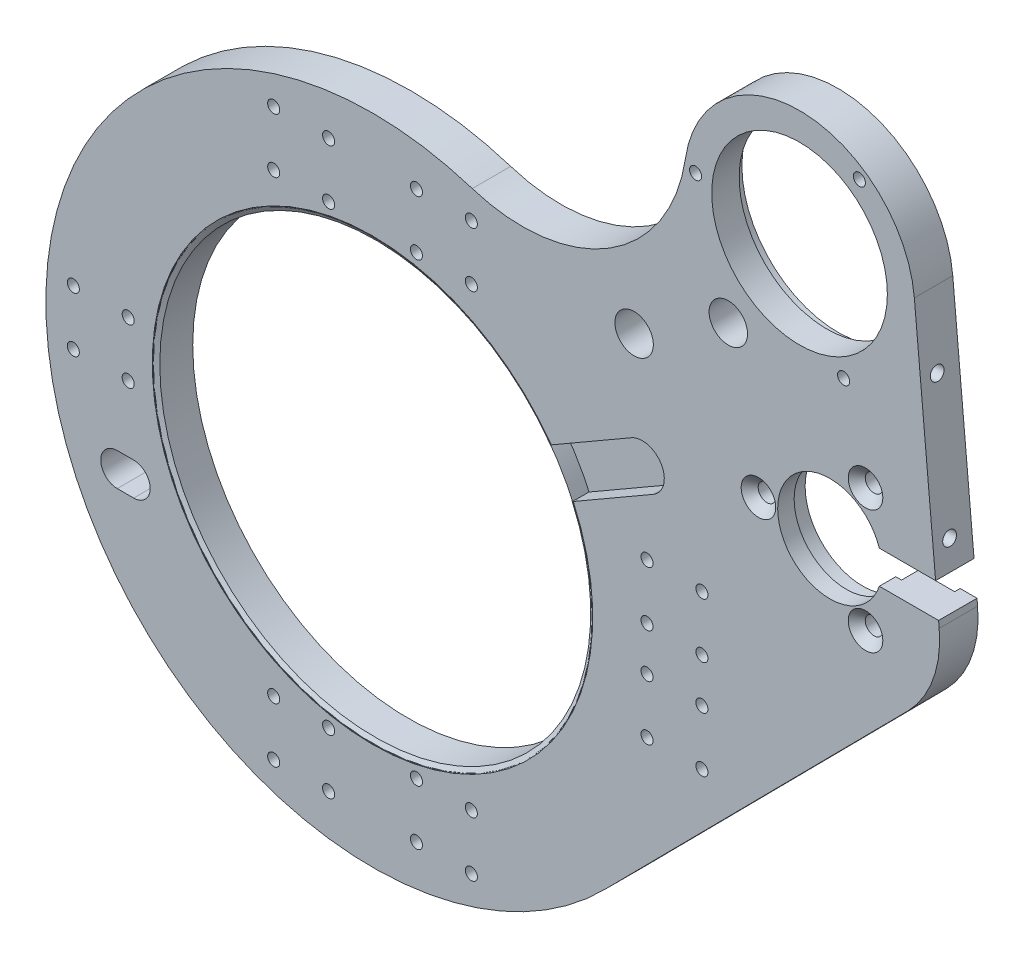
ISO-10303-21;
HEADER;
FILE_DESCRIPTION(('STEP AP214'),'2;1');
FILE_NAME('part.step','',(''),(''),'','','');
FILE_SCHEMA(('AUTOMOTIVE_DESIGN { 1 0 10303 214 1 1 1 1 }'));
ENDSEC;
DATA;
#1=APPLICATION_CONTEXT('core data for automotive mechanical design processes');
#2=APPLICATION_PROTOCOL_DEFINITION('international standard','automotive_design',2000,#1);
#3=PRODUCT_CONTEXT('',#1,'mechanical');
#4=PRODUCT('Part','Part','',(#3));
#5=PRODUCT_RELATED_PRODUCT_CATEGORY('part','',(#4));
#6=PRODUCT_DEFINITION_FORMATION('','',#4);
#7=PRODUCT_DEFINITION_CONTEXT('part definition',#1,'design');
#8=PRODUCT_DEFINITION('design','',#6,#7);
#9=PRODUCT_DEFINITION_SHAPE('','',#8);
#10=(LENGTH_UNIT() NAMED_UNIT(*) SI_UNIT(.MILLI.,.METRE.));
#11=(NAMED_UNIT(*) PLANE_ANGLE_UNIT() SI_UNIT($,.RADIAN.));
#12=(NAMED_UNIT(*) SI_UNIT($,.STERADIAN.) SOLID_ANGLE_UNIT());
#13=UNCERTAINTY_MEASURE_WITH_UNIT(LENGTH_MEASURE(1.E-05),#10,'distance_accuracy_value','');
#14=(GEOMETRIC_REPRESENTATION_CONTEXT(3) GLOBAL_UNCERTAINTY_ASSIGNED_CONTEXT((#13)) GLOBAL_UNIT_ASSIGNED_CONTEXT((#10,
#11,#12)) REPRESENTATION_CONTEXT('',''));
#15=CARTESIAN_POINT('',(0.,0.,0.));
#16=DIRECTION('',(0.,0.,1.));
#17=DIRECTION('',(1.,0.,0.));
#18=AXIS2_PLACEMENT_3D('',#15,#16,#17);
#19=CARTESIAN_POINT('',(99.85529288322,66.87731304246,90.5));
#20=DIRECTION('',(0.995910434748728,0.0903460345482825,0.));
#21=DIRECTION('',(-0.0903460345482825,0.995910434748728,0.));
#22=AXIS2_PLACEMENT_3D('',#19,#20,#21);
#23=CYLINDRICAL_SURFACE('',#22,1.5);
#24=CARTESIAN_POINT('',(95.8716511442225,66.5159289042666,90.5));
#25=DIRECTION('',(0.995910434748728,0.0903460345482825,0.));
#26=DIRECTION('',(-0.0903460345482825,0.995910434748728,0.));
#27=AXIS2_PLACEMENT_3D('',#24,#25,#26);
#28=CIRCLE('',#27,1.5);
#29=CARTESIAN_POINT('',(95.7361320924,68.0097945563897,90.5));
#30=VERTEX_POINT('',#29);
#31=EDGE_CURVE('P0_E20',#30,#30,#28,.T.);
#32=ORIENTED_EDGE('',*,*,#31,.T.);
#33=EDGE_LOOP('',(#32));
#34=FACE_BOUND('',#33,.T.);
#35=CARTESIAN_POINT('',(99.8552928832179,66.8773130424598,90.5));
#36=DIRECTION('',(0.995910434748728,0.0903460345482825,0.));
#37=DIRECTION('',(-0.0903460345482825,0.995910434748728,0.));
#38=AXIS2_PLACEMENT_3D('',#35,#36,#37);
#39=CIRCLE('',#38,1.5);
#40=CARTESIAN_POINT('',(99.7197738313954,68.3711786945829,90.5));
#41=VERTEX_POINT('',#40);
#42=EDGE_CURVE('P0_E11',#41,#41,#39,.F.);
#43=ORIENTED_EDGE('',*,*,#42,.T.);
#44=EDGE_LOOP('',(#43));
#45=FACE_BOUND('',#44,.T.);
#46=ADVANCED_FACE('P0_F16',(#34,#45),#23,.T.);
#47=CARTESIAN_POINT('',(95.87165114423,66.51592890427,90.5));
#48=DIRECTION('',(0.995910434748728,0.0903460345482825,0.));
#49=DIRECTION('',(-0.0903460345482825,0.995910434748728,0.));
#50=AXIS2_PLACEMENT_3D('',#47,#48,#49);
#51=PLANE('',#50);
#52=CARTESIAN_POINT('',(95.9845836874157,65.2710408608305,90.5));
#53=CARTESIAN_POINT('',(95.984565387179,65.2712425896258,90.7386739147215));
#54=CARTESIAN_POINT('',(95.9766545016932,65.3584465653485,90.9601183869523));
#55=CARTESIAN_POINT('',(95.9680716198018,65.4530581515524,91.2003736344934));
#56=CARTESIAN_POINT('',(95.9515065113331,65.6356601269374,91.3838834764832));
#57=CARTESIAN_POINT('',(95.9350086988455,65.817520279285,91.566647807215));
#58=CARTESIAN_POINT('',(95.9132210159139,66.0576922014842,91.6622353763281));
#59=CARTESIAN_POINT('',(95.8932395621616,66.2779535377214,91.7498986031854));
#60=CARTESIAN_POINT('',(95.87165114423,66.51592890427,91.75));
#61=CARTESIAN_POINT('',(95.8501572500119,66.7528623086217,91.7501009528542));
#62=CARTESIAN_POINT('',(95.8300812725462,66.9741656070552,91.6622353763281));
#63=CARTESIAN_POINT('',(95.8083751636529,67.213438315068,91.5672352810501));
#64=CARTESIAN_POINT('',(95.7917957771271,67.3961976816,91.3838834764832));
#65=CARTESIAN_POINT('',(95.775283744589,67.5782145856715,91.2012765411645));
#66=CARTESIAN_POINT('',(95.7666477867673,67.6734112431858,90.9601183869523));
#67=CARTESIAN_POINT('',(95.7587369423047,67.7606147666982,90.7392089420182));
#68=CARTESIAN_POINT('',(95.7587186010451,67.7608169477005,90.5));
#69=B_SPLINE_CURVE_WITH_KNOTS('',2,(#52,#53,#54,#55,#56,#57,#58,#59,#60,#61,#62,#63,#64,#65,#66,
#67,#68),.UNSPECIFIED.,.F.,.F.,(3,2,2,2,2,2,2,2,3),(0.,0.125,0.25,0.375,0.5,0.625,0.75,0.875,
1.),.UNSPECIFIED.);
#70=CARTESIAN_POINT('',(95.9845836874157,65.2710408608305,90.5));
#71=VERTEX_POINT('',#70);
#72=CARTESIAN_POINT('',(95.7587186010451,67.7608169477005,90.5));
#73=VERTEX_POINT('',#72);
#74=EDGE_CURVE('P0_E28',#71,#73,#69,.T.);
#75=ORIENTED_EDGE('',*,*,#74,.F.);
#76=CARTESIAN_POINT('',(95.7587186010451,67.7608169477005,90.5));
#77=CARTESIAN_POINT('',(95.7587369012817,67.7606152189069,90.2613260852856));
#78=CARTESIAN_POINT('',(95.7666477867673,67.6734112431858,90.0398816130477));
#79=CARTESIAN_POINT('',(95.7752306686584,67.5787996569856,89.7996263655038));
#80=CARTESIAN_POINT('',(95.7917957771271,67.3961976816,89.6161165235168));
#81=CARTESIAN_POINT('',(95.8082935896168,67.2143375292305,89.4333521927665));
#82=CARTESIAN_POINT('',(95.8300812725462,66.9741656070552,89.337764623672));
#83=CARTESIAN_POINT('',(95.850062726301,66.753904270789,89.2501013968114));
#84=CARTESIAN_POINT('',(95.87165114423,66.51592890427,89.25));
#85=CARTESIAN_POINT('',(95.8931450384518,66.2789954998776,89.2498990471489));
#86=CARTESIAN_POINT('',(95.9132210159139,66.0576922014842,89.337764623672));
#87=CARTESIAN_POINT('',(95.9349271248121,65.8184194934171,89.4327647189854));
#88=CARTESIAN_POINT('',(95.9515065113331,65.6356601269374,89.6161165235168));
#89=CARTESIAN_POINT('',(95.968018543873,65.4536432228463,89.798723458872));
#90=CARTESIAN_POINT('',(95.9766545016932,65.3584465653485,90.0398816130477));
#91=CARTESIAN_POINT('',(95.9845653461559,65.2712430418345,90.2607910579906));
#92=CARTESIAN_POINT('',(95.9845836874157,65.2710408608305,90.5));
#93=B_SPLINE_CURVE_WITH_KNOTS('',2,(#76,#77,#78,#79,#80,#81,#82,#83,#84,#85,#86,#87,#88,#89,#90,
#91,#92),.UNSPECIFIED.,.F.,.F.,(3,2,2,2,2,2,2,2,3),(0.,0.125,0.25,0.375,0.5,0.625,0.75,0.875,
1.),.UNSPECIFIED.);
#94=EDGE_CURVE('P0_E33',#73,#71,#93,.T.);
#95=ORIENTED_EDGE('',*,*,#94,.F.);
#96=EDGE_LOOP('',(#75,#95));
#97=FACE_BOUND('',#96,.T.);
#98=ORIENTED_EDGE('',*,*,#31,.F.);
#99=EDGE_LOOP('',(#98));
#100=FACE_BOUND('',#99,.T.);
#101=ADVANCED_FACE('P0_F17',(#97,#100),#51,.F.);
#102=OPEN_SHELL('',(#46,#101));
#103=SHELL_BASED_SURFACE_MODEL('P0_B1',(#102));
#104=CARTESIAN_POINT('',(0.,0.,86.475));
#105=DIRECTION('',(0.,0.,1.));
#106=DIRECTION('',(1.,0.,0.));
#107=AXIS2_PLACEMENT_3D('',#104,#105,#106);
#108=CYLINDRICAL_SURFACE('',#107,46.);
#109=DIRECTION('',(0.,0.,1.));
#110=VECTOR('',#109,1.);
#111=CARTESIAN_POINT('',(-20.2417122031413,41.3070585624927,86.475));
#112=LINE('',#111,#110);
#113=CARTESIAN_POINT('',(-20.2417122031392,41.3070585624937,87.));
#114=VERTEX_POINT('',#113);
#115=CARTESIAN_POINT('',(-20.2417122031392,41.3070585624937,86.5));
#116=VERTEX_POINT('',#115);
#117=EDGE_CURVE('P1_E413',#114,#116,#112,.F.);
#118=ORIENTED_EDGE('',*,*,#117,.T.);
#119=CARTESIAN_POINT('',(0.,0.,86.5));
#120=DIRECTION('',(0.,0.,1.));
#121=DIRECTION('',(1.,0.,0.));
#122=AXIS2_PLACEMENT_3D('',#119,#120,#121);
#123=CIRCLE('',#122,46.);
#124=CARTESIAN_POINT('',(-45.4587933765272,7.03548894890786,86.5));
#125=VERTEX_POINT('',#124);
#126=EDGE_CURVE('P1_E1004',#125,#116,#123,.F.);
#127=ORIENTED_EDGE('',*,*,#126,.F.);
#128=DIRECTION('',(0.,0.,1.));
#129=VECTOR('',#128,1.);
#130=CARTESIAN_POINT('',(-45.4587933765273,7.03548894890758,86.475));
#131=LINE('',#130,#129);
#132=CARTESIAN_POINT('',(-45.4587933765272,7.03548894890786,87.));
#133=VERTEX_POINT('',#132);
#134=EDGE_CURVE('P1_E416',#125,#133,#131,.T.);
#135=ORIENTED_EDGE('',*,*,#134,.T.);
#136=CARTESIAN_POINT('',(0.,0.,87.));
#137=DIRECTION('',(0.,0.,1.));
#138=DIRECTION('',(1.,0.,0.));
#139=AXIS2_PLACEMENT_3D('',#136,#137,#138);
#140=CIRCLE('',#139,46.);
#141=EDGE_CURVE('P1_E387',#133,#114,#140,.F.);
#142=ORIENTED_EDGE('',*,*,#141,.T.);
#143=EDGE_LOOP('',(#118,#127,#135,#142));
#144=FACE_BOUND('',#143,.T.);
#145=ADVANCED_FACE('P1_F16',(#144),#108,.T.);
#146=CARTESIAN_POINT('',(0.,0.,86.475));
#147=DIRECTION('',(0.,0.,1.));
#148=DIRECTION('',(1.,0.,0.));
#149=AXIS2_PLACEMENT_3D('',#146,#147,#148);
#150=CYLINDRICAL_SURFACE('',#149,46.);
#151=DIRECTION('',(0.,0.,1.));
#152=VECTOR('',#151,1.);
#153=CARTESIAN_POINT('',(16.3273165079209,43.0048687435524,86.475));
#154=LINE('',#153,#152);
#155=CARTESIAN_POINT('',(16.3273165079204,43.0048687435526,87.));
#156=VERTEX_POINT('',#155);
#157=CARTESIAN_POINT('',(16.3273165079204,43.0048687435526,86.5));
#158=VERTEX_POINT('',#157);
#159=EDGE_CURVE('P1_E407',#156,#158,#154,.F.);
#160=ORIENTED_EDGE('',*,*,#159,.T.);
#161=CARTESIAN_POINT('',(0.,0.,86.5));
#162=DIRECTION('',(0.,0.,1.));
#163=DIRECTION('',(1.,0.,0.));
#164=AXIS2_PLACEMENT_3D('',#161,#162,#163);
#165=CIRCLE('',#164,46.);
#166=CARTESIAN_POINT('',(-16.3273165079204,43.0048687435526,86.5));
#167=VERTEX_POINT('',#166);
#168=EDGE_CURVE('P1_E990',#167,#158,#165,.F.);
#169=ORIENTED_EDGE('',*,*,#168,.F.);
#170=DIRECTION('',(0.,0.,1.));
#171=VECTOR('',#170,1.);
#172=CARTESIAN_POINT('',(-16.3273165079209,43.0048687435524,86.475));
#173=LINE('',#172,#171);
#174=CARTESIAN_POINT('',(-16.3273165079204,43.0048687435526,87.));
#175=VERTEX_POINT('',#174);
#176=EDGE_CURVE('P1_E411',#167,#175,#173,.T.);
#177=ORIENTED_EDGE('',*,*,#176,.T.);
#178=CARTESIAN_POINT('',(0.,0.,87.));
#179=DIRECTION('',(0.,0.,1.));
#180=DIRECTION('',(1.,0.,0.));
#181=AXIS2_PLACEMENT_3D('',#178,#179,#180);
#182=CIRCLE('',#181,46.);
#183=EDGE_CURVE('P1_E993',#175,#156,#182,.F.);
#184=ORIENTED_EDGE('',*,*,#183,.T.);
#185=EDGE_LOOP('',(#160,#169,#177,#184));
#186=FACE_BOUND('',#185,.T.);
#187=ADVANCED_FACE('P1_F978',(#186),#150,.T.);
#188=CARTESIAN_POINT('',(0.,0.,86.475));
#189=DIRECTION('',(0.,0.,1.));
#190=DIRECTION('',(1.,0.,0.));
#191=AXIS2_PLACEMENT_3D('',#188,#189,#190);
#192=CYLINDRICAL_SURFACE('',#191,46.);
#193=DIRECTION('',(0.,0.,1.));
#194=VECTOR('',#193,1.);
#195=CARTESIAN_POINT('',(20.2417122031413,41.3070585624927,86.475));
#196=LINE('',#195,#194);
#197=CARTESIAN_POINT('',(20.2417122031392,41.3070585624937,86.5));
#198=VERTEX_POINT('',#197);
#199=CARTESIAN_POINT('',(20.2417122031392,41.3070585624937,87.));
#200=VERTEX_POINT('',#199);
#201=EDGE_CURVE('P1_E404',#198,#200,#196,.T.);
#202=ORIENTED_EDGE('',*,*,#201,.T.);
#203=CARTESIAN_POINT('',(0.,0.,87.));
#204=DIRECTION('',(0.,0.,1.));
#205=DIRECTION('',(1.,0.,0.));
#206=AXIS2_PLACEMENT_3D('',#203,#204,#205);
#207=CIRCLE('',#206,46.);
#208=CARTESIAN_POINT('',(20.2417122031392,-41.3070585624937,87.));
#209=VERTEX_POINT('',#208);
#210=EDGE_CURVE('P1_E1013',#200,#209,#207,.F.);
#211=ORIENTED_EDGE('',*,*,#210,.T.);
#212=DIRECTION('',(0.,0.,1.));
#213=VECTOR('',#212,1.);
#214=CARTESIAN_POINT('',(20.2417122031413,-41.3070585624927,86.475));
#215=LINE('',#214,#213);
#216=CARTESIAN_POINT('',(20.2417122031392,-41.3070585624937,86.5));
#217=VERTEX_POINT('',#216);
#218=EDGE_CURVE('P1_E405',#209,#217,#215,.F.);
#219=ORIENTED_EDGE('',*,*,#218,.T.);
#220=CARTESIAN_POINT('',(0.,0.,86.5));
#221=DIRECTION('',(0.,0.,1.));
#222=DIRECTION('',(1.,0.,0.));
#223=AXIS2_PLACEMENT_3D('',#220,#221,#222);
#224=CIRCLE('',#223,46.);
#225=EDGE_CURVE('P1_E1003',#198,#217,#224,.F.);
#226=ORIENTED_EDGE('',*,*,#225,.F.);
#227=EDGE_LOOP('',(#202,#211,#219,#226));
#228=FACE_BOUND('',#227,.T.);
#229=ADVANCED_FACE('P1_F975',(#228),#192,.T.);
#230=CARTESIAN_POINT('',(0.,0.,86.475));
#231=DIRECTION('',(0.,0.,1.));
#232=DIRECTION('',(1.,0.,0.));
#233=AXIS2_PLACEMENT_3D('',#230,#231,#232);
#234=CYLINDRICAL_SURFACE('',#233,46.);
#235=DIRECTION('',(0.,0.,1.));
#236=VECTOR('',#235,1.);
#237=CARTESIAN_POINT('',(-16.3273165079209,-43.0048687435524,86.475));
#238=LINE('',#237,#236);
#239=CARTESIAN_POINT('',(-16.3273165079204,-43.0048687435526,87.));
#240=VERTEX_POINT('',#239);
#241=CARTESIAN_POINT('',(-16.3273165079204,-43.0048687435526,86.5));
#242=VERTEX_POINT('',#241);
#243=EDGE_CURVE('P1_E362',#240,#242,#238,.F.);
#244=ORIENTED_EDGE('',*,*,#243,.T.);
#245=CARTESIAN_POINT('',(0.,0.,86.5));
#246=DIRECTION('',(0.,0.,1.));
#247=DIRECTION('',(1.,0.,0.));
#248=AXIS2_PLACEMENT_3D('',#245,#246,#247);
#249=CIRCLE('',#248,46.);
#250=CARTESIAN_POINT('',(16.3273165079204,-43.0048687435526,86.5));
#251=VERTEX_POINT('',#250);
#252=EDGE_CURVE('P1_E1006',#251,#242,#249,.F.);
#253=ORIENTED_EDGE('',*,*,#252,.F.);
#254=DIRECTION('',(0.,0.,1.));
#255=VECTOR('',#254,1.);
#256=CARTESIAN_POINT('',(16.3273165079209,-43.0048687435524,86.475));
#257=LINE('',#256,#255);
#258=CARTESIAN_POINT('',(16.3273165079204,-43.0048687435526,87.));
#259=VERTEX_POINT('',#258);
#260=EDGE_CURVE('P1_E401',#251,#259,#257,.T.);
#261=ORIENTED_EDGE('',*,*,#260,.T.);
#262=CARTESIAN_POINT('',(0.,0.,87.));
#263=DIRECTION('',(0.,0.,1.));
#264=DIRECTION('',(1.,0.,0.));
#265=AXIS2_PLACEMENT_3D('',#262,#263,#264);
#266=CIRCLE('',#265,46.);
#267=EDGE_CURVE('P1_E1008',#259,#240,#266,.F.);
#268=ORIENTED_EDGE('',*,*,#267,.T.);
#269=EDGE_LOOP('',(#244,#253,#261,#268));
#270=FACE_BOUND('',#269,.T.);
#271=ADVANCED_FACE('P1_F972',(#270),#234,.T.);
#272=CARTESIAN_POINT('',(0.,0.,86.475));
#273=DIRECTION('',(0.,0.,1.));
#274=DIRECTION('',(1.,0.,0.));
#275=AXIS2_PLACEMENT_3D('',#272,#273,#274);
#276=CYLINDRICAL_SURFACE('',#275,46.);
#277=DIRECTION('',(0.,0.,1.));
#278=VECTOR('',#277,1.);
#279=CARTESIAN_POINT('',(-45.4587933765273,-7.03548894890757,86.475));
#280=LINE('',#279,#278);
#281=CARTESIAN_POINT('',(-45.4587933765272,-7.03548894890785,87.));
#282=VERTEX_POINT('',#281);
#283=CARTESIAN_POINT('',(-45.4587933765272,-7.03548894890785,86.5));
#284=VERTEX_POINT('',#283);
#285=EDGE_CURVE('P1_E377',#282,#284,#280,.F.);
#286=ORIENTED_EDGE('',*,*,#285,.T.);
#287=CARTESIAN_POINT('',(0.,0.,86.5));
#288=DIRECTION('',(0.,0.,1.));
#289=DIRECTION('',(1.,0.,0.));
#290=AXIS2_PLACEMENT_3D('',#287,#288,#289);
#291=CIRCLE('',#290,46.);
#292=CARTESIAN_POINT('',(-20.2417122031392,-41.3070585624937,86.5));
#293=VERTEX_POINT('',#292);
#294=EDGE_CURVE('P1_E376',#293,#284,#291,.F.);
#295=ORIENTED_EDGE('',*,*,#294,.F.);
#296=DIRECTION('',(0.,0.,1.));
#297=VECTOR('',#296,1.);
#298=CARTESIAN_POINT('',(-20.2417122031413,-41.3070585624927,86.475));
#299=LINE('',#298,#297);
#300=CARTESIAN_POINT('',(-20.2417122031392,-41.3070585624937,87.));
#301=VERTEX_POINT('',#300);
#302=EDGE_CURVE('P1_E360',#293,#301,#299,.T.);
#303=ORIENTED_EDGE('',*,*,#302,.T.);
#304=CARTESIAN_POINT('',(0.,0.,87.));
#305=DIRECTION('',(0.,0.,1.));
#306=DIRECTION('',(1.,0.,0.));
#307=AXIS2_PLACEMENT_3D('',#304,#305,#306);
#308=CIRCLE('',#307,46.);
#309=EDGE_CURVE('P1_E19',#301,#282,#308,.F.);
#310=ORIENTED_EDGE('',*,*,#309,.T.);
#311=EDGE_LOOP('',(#286,#295,#303,#310));
#312=FACE_BOUND('',#311,.T.);
#313=ADVANCED_FACE('P1_F373',(#312),#276,.T.);
#314=CARTESIAN_POINT('',(0.,0.,86.475));
#315=DIRECTION('',(0.,0.,1.));
#316=DIRECTION('',(1.,0.,0.));
#317=AXIS2_PLACEMENT_3D('',#314,#315,#316);
#318=CYLINDRICAL_SURFACE('',#317,46.);
#319=DIRECTION('',(0.,0.,1.));
#320=VECTOR('',#319,1.);
#321=CARTESIAN_POINT('',(-45.8865968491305,3.22803804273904,86.475));
#322=LINE('',#321,#320);
#323=CARTESIAN_POINT('',(-45.8865968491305,3.22803804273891,87.));
#324=VERTEX_POINT('',#323);
#325=CARTESIAN_POINT('',(-45.8865968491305,3.22803804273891,86.5));
#326=VERTEX_POINT('',#325);
#327=EDGE_CURVE('P1_E385',#324,#326,#322,.F.);
#328=ORIENTED_EDGE('',*,*,#327,.T.);
#329=CARTESIAN_POINT('',(0.,0.,86.5));
#330=DIRECTION('',(0.,0.,1.));
#331=DIRECTION('',(1.,0.,0.));
#332=AXIS2_PLACEMENT_3D('',#329,#330,#331);
#333=CIRCLE('',#332,46.);
#334=CARTESIAN_POINT('',(-45.8865968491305,-3.22803804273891,86.5));
#335=VERTEX_POINT('',#334);
#336=EDGE_CURVE('P1_E1044',#335,#326,#333,.F.);
#337=ORIENTED_EDGE('',*,*,#336,.F.);
#338=DIRECTION('',(0.,0.,1.));
#339=VECTOR('',#338,1.);
#340=CARTESIAN_POINT('',(-45.8865968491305,-3.22803804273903,86.475));
#341=LINE('',#340,#339);
#342=CARTESIAN_POINT('',(-45.8865968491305,-3.22803804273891,87.));
#343=VERTEX_POINT('',#342);
#344=EDGE_CURVE('P1_E389',#335,#343,#341,.T.);
#345=ORIENTED_EDGE('',*,*,#344,.T.);
#346=CARTESIAN_POINT('',(0.,0.,87.));
#347=DIRECTION('',(0.,0.,1.));
#348=DIRECTION('',(1.,0.,0.));
#349=AXIS2_PLACEMENT_3D('',#346,#347,#348);
#350=CIRCLE('',#349,46.);
#351=EDGE_CURVE('P1_E384',#343,#324,#350,.F.);
#352=ORIENTED_EDGE('',*,*,#351,.T.);
#353=EDGE_LOOP('',(#328,#337,#345,#352));
#354=FACE_BOUND('',#353,.T.);
#355=ADVANCED_FACE('P1_F967',(#354),#318,.T.);
#356=CARTESIAN_POINT('',(0.,0.,87.));
#357=DIRECTION('',(0.,0.,1.));
#358=DIRECTION('',(1.,0.,0.));
#359=AXIS2_PLACEMENT_3D('',#356,#357,#358);
#360=PLANE('',#359);
#361=ORIENTED_EDGE('',*,*,#267,.F.);
#362=CARTESIAN_POINT('',(18.,-41.5,87.));
#363=DIRECTION('',(0.,0.,1.));
#364=DIRECTION('',(1.,0.,0.));
#365=AXIS2_PLACEMENT_3D('',#362,#363,#364);
#366=CIRCLE('',#365,2.25);
#367=EDGE_CURVE('P1_E1059',#259,#209,#366,.T.);
#368=ORIENTED_EDGE('',*,*,#367,.T.);
#369=ORIENTED_EDGE('',*,*,#210,.F.);
#370=CARTESIAN_POINT('',(18.,41.5,87.));
#371=DIRECTION('',(0.,0.,1.));
#372=DIRECTION('',(1.,0.,0.));
#373=AXIS2_PLACEMENT_3D('',#370,#371,#372);
#374=CIRCLE('',#373,2.25);
#375=EDGE_CURVE('P1_E1070',#200,#156,#374,.T.);
#376=ORIENTED_EDGE('',*,*,#375,.T.);
#377=ORIENTED_EDGE('',*,*,#183,.F.);
#378=CARTESIAN_POINT('',(-18.,41.5,87.));
#379=DIRECTION('',(0.,0.,1.));
#380=DIRECTION('',(1.,0.,0.));
#381=AXIS2_PLACEMENT_3D('',#378,#379,#380);
#382=CIRCLE('',#381,2.25);
#383=EDGE_CURVE('P1_E1026',#175,#114,#382,.T.);
#384=ORIENTED_EDGE('',*,*,#383,.T.);
#385=ORIENTED_EDGE('',*,*,#141,.F.);
#386=CARTESIAN_POINT('',(-44.5,5.,87.));
#387=DIRECTION('',(0.,0.,1.));
#388=DIRECTION('',(1.,0.,0.));
#389=AXIS2_PLACEMENT_3D('',#386,#387,#388);
#390=CIRCLE('',#389,2.25);
#391=EDGE_CURVE('P1_E1024',#133,#324,#390,.T.);
#392=ORIENTED_EDGE('',*,*,#391,.T.);
#393=ORIENTED_EDGE('',*,*,#351,.F.);
#394=CARTESIAN_POINT('',(-44.5,-5.,87.));
#395=DIRECTION('',(0.,0.,1.));
#396=DIRECTION('',(1.,0.,0.));
#397=AXIS2_PLACEMENT_3D('',#394,#395,#396);
#398=CIRCLE('',#397,2.25);
#399=EDGE_CURVE('P1_E383',#343,#282,#398,.T.);
#400=ORIENTED_EDGE('',*,*,#399,.T.);
#401=ORIENTED_EDGE('',*,*,#309,.F.);
#402=CARTESIAN_POINT('',(-18.,-41.5,87.));
#403=DIRECTION('',(0.,0.,1.));
#404=DIRECTION('',(1.,0.,0.));
#405=AXIS2_PLACEMENT_3D('',#402,#403,#404);
#406=CIRCLE('',#405,2.25);
#407=EDGE_CURVE('P1_E356',#301,#240,#406,.T.);
#408=ORIENTED_EDGE('',*,*,#407,.T.);
#409=EDGE_LOOP('',(#361,#368,#369,#376,#377,#384,#385,#392,#393,#400,#401,#408));
#410=FACE_BOUND('',#409,.T.);
#411=CARTESIAN_POINT('',(-8.,51.5,87.));
#412=DIRECTION('',(0.,0.,1.));
#413=DIRECTION('',(1.,0.,0.));
#414=AXIS2_PLACEMENT_3D('',#411,#412,#413);
#415=CIRCLE('',#414,2.25);
#416=CARTESIAN_POINT('',(-9.73131717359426,50.0629750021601,87.));
#417=VERTEX_POINT('',#416);
#418=CARTESIAN_POINT('',(-5.9143339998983,50.6559044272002,87.));
#419=VERTEX_POINT('',#418);
#420=EDGE_CURVE('P1_E1124',#417,#419,#415,.T.);
#421=ORIENTED_EDGE('',*,*,#420,.T.);
#422=CARTESIAN_POINT('',(0.,0.,87.));
#423=DIRECTION('',(0.,0.,1.));
#424=DIRECTION('',(1.,0.,0.));
#425=AXIS2_PLACEMENT_3D('',#422,#423,#424);
#426=CIRCLE('',#425,51.);
#427=CARTESIAN_POINT('',(5.91433399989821,50.6559044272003,87.));
#428=VERTEX_POINT('',#427);
#429=EDGE_CURVE('P1_E1119',#419,#428,#426,.F.);
#430=ORIENTED_EDGE('',*,*,#429,.T.);
#431=CARTESIAN_POINT('',(8.,51.5,87.));
#432=DIRECTION('',(0.,0.,1.));
#433=DIRECTION('',(1.,0.,0.));
#434=AXIS2_PLACEMENT_3D('',#431,#432,#433);
#435=CIRCLE('',#434,2.25);
#436=CARTESIAN_POINT('',(9.73131717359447,50.0629750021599,87.));
#437=VERTEX_POINT('',#436);
#438=EDGE_CURVE('P1_E1117',#428,#437,#435,.T.);
#439=ORIENTED_EDGE('',*,*,#438,.T.);
#440=CARTESIAN_POINT('',(0.,0.,87.));
#441=DIRECTION('',(0.,0.,1.));
#442=DIRECTION('',(1.,0.,0.));
#443=AXIS2_PLACEMENT_3D('',#440,#441,#442);
#444=CIRCLE('',#443,51.);
#445=CARTESIAN_POINT('',(48.523899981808,15.6981250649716,87.));
#446=VERTEX_POINT('',#445);
#447=EDGE_CURVE('P1_E1113',#437,#446,#444,.F.);
#448=ORIENTED_EDGE('',*,*,#447,.T.);
#449=CARTESIAN_POINT('',(50.,14.,87.));
#450=DIRECTION('',(0.,0.,1.));
#451=DIRECTION('',(1.,0.,0.));
#452=AXIS2_PLACEMENT_3D('',#449,#450,#451);
#453=CIRCLE('',#452,2.25);
#454=CARTESIAN_POINT('',(49.6203414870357,11.7822625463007,87.));
#455=VERTEX_POINT('',#454);
#456=EDGE_CURVE('P1_E1065',#446,#455,#453,.T.);
#457=ORIENTED_EDGE('',*,*,#456,.T.);
#458=CARTESIAN_POINT('',(0.,0.,87.));
#459=DIRECTION('',(0.,0.,1.));
#460=DIRECTION('',(1.,0.,0.));
#461=AXIS2_PLACEMENT_3D('',#458,#459,#460);
#462=CIRCLE('',#461,51.);
#463=CARTESIAN_POINT('',(50.6264934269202,6.16101966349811,87.));
#464=VERTEX_POINT('',#463);
#465=EDGE_CURVE('P1_E1109',#455,#464,#462,.F.);
#466=ORIENTED_EDGE('',*,*,#465,.T.);
#467=CARTESIAN_POINT('',(50.,4.,87.));
#468=DIRECTION('',(0.,0.,1.));
#469=DIRECTION('',(1.,0.,0.));
#470=AXIS2_PLACEMENT_3D('',#467,#468,#469);
#471=CIRCLE('',#470,2.25);
#472=CARTESIAN_POINT('',(50.9620896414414,1.96606698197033,87.));
#473=VERTEX_POINT('',#472);
#474=EDGE_CURVE('P1_E1105',#464,#473,#471,.T.);
#475=ORIENTED_EDGE('',*,*,#474,.T.);
#476=CARTESIAN_POINT('',(0.,0.,87.));
#477=DIRECTION('',(0.,0.,1.));
#478=DIRECTION('',(1.,0.,0.));
#479=AXIS2_PLACEMENT_3D('',#476,#477,#478);
#480=CIRCLE('',#479,51.);
#481=CARTESIAN_POINT('',(50.9620896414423,-1.96606698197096,87.));
#482=VERTEX_POINT('',#481);
#483=EDGE_CURVE('P1_E1100',#473,#482,#480,.F.);
#484=ORIENTED_EDGE('',*,*,#483,.T.);
#485=CARTESIAN_POINT('',(50.,-4.,87.));
#486=DIRECTION('',(0.,0.,1.));
#487=DIRECTION('',(1.,0.,0.));
#488=AXIS2_PLACEMENT_3D('',#485,#486,#487);
#489=CIRCLE('',#488,2.25);
#490=CARTESIAN_POINT('',(50.6264934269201,-6.16101966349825,87.));
#491=VERTEX_POINT('',#490);
#492=EDGE_CURVE('P1_E1098',#482,#491,#489,.T.);
#493=ORIENTED_EDGE('',*,*,#492,.T.);
#494=CARTESIAN_POINT('',(0.,0.,87.));
#495=DIRECTION('',(0.,0.,1.));
#496=DIRECTION('',(1.,0.,0.));
#497=AXIS2_PLACEMENT_3D('',#494,#495,#496);
#498=CIRCLE('',#497,51.);
#499=CARTESIAN_POINT('',(49.6203414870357,-11.7822625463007,87.));
#500=VERTEX_POINT('',#499);
#501=EDGE_CURVE('P1_E1094',#491,#500,#498,.F.);
#502=ORIENTED_EDGE('',*,*,#501,.T.);
#503=CARTESIAN_POINT('',(50.,-14.,87.));
#504=DIRECTION('',(0.,0.,1.));
#505=DIRECTION('',(1.,0.,0.));
#506=AXIS2_PLACEMENT_3D('',#503,#504,#505);
#507=CIRCLE('',#506,2.25);
#508=CARTESIAN_POINT('',(48.523899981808,-15.6981250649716,87.));
#509=VERTEX_POINT('',#508);
#510=EDGE_CURVE('P1_E1063',#500,#509,#507,.T.);
#511=ORIENTED_EDGE('',*,*,#510,.T.);
#512=CARTESIAN_POINT('',(0.,0.,87.));
#513=DIRECTION('',(0.,0.,1.));
#514=DIRECTION('',(1.,0.,0.));
#515=AXIS2_PLACEMENT_3D('',#512,#513,#514);
#516=CIRCLE('',#515,51.);
#517=CARTESIAN_POINT('',(9.73131717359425,-50.0629750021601,87.));
#518=VERTEX_POINT('',#517);
#519=EDGE_CURVE('P1_E1090',#509,#518,#516,.F.);
#520=ORIENTED_EDGE('',*,*,#519,.T.);
#521=CARTESIAN_POINT('',(8.,-51.5,87.));
#522=DIRECTION('',(0.,0.,1.));
#523=DIRECTION('',(1.,0.,0.));
#524=AXIS2_PLACEMENT_3D('',#521,#522,#523);
#525=CIRCLE('',#524,2.25);
#526=CARTESIAN_POINT('',(5.9143339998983,-50.6559044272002,87.));
#527=VERTEX_POINT('',#526);
#528=EDGE_CURVE('P1_E1086',#518,#527,#525,.T.);
#529=ORIENTED_EDGE('',*,*,#528,.T.);
#530=CARTESIAN_POINT('',(0.,0.,87.));
#531=DIRECTION('',(0.,0.,1.));
#532=DIRECTION('',(1.,0.,0.));
#533=AXIS2_PLACEMENT_3D('',#530,#531,#532);
#534=CIRCLE('',#533,51.);
#535=CARTESIAN_POINT('',(-5.91433399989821,-50.6559044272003,87.));
#536=VERTEX_POINT('',#535);
#537=EDGE_CURVE('P1_E1081',#527,#536,#534,.F.);
#538=ORIENTED_EDGE('',*,*,#537,.T.);
#539=CARTESIAN_POINT('',(-8.,-51.5,87.));
#540=DIRECTION('',(0.,0.,1.));
#541=DIRECTION('',(1.,0.,0.));
#542=AXIS2_PLACEMENT_3D('',#539,#540,#541);
#543=CIRCLE('',#542,2.25);
#544=CARTESIAN_POINT('',(-9.73131717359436,-50.0629750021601,87.));
#545=VERTEX_POINT('',#544);
#546=EDGE_CURVE('P1_E1079',#536,#545,#543,.T.);
#547=ORIENTED_EDGE('',*,*,#546,.T.);
#548=CARTESIAN_POINT('',(0.,0.,87.));
#549=DIRECTION('',(0.,0.,1.));
#550=DIRECTION('',(1.,0.,0.));
#551=AXIS2_PLACEMENT_3D('',#548,#549,#550);
#552=CIRCLE('',#551,51.);
#553=EDGE_CURVE('P1_E1125',#545,#417,#552,.F.);
#554=ORIENTED_EDGE('',*,*,#553,.T.);
#555=EDGE_LOOP('',(#421,#430,#439,#448,#457,#466,#475,#484,#493,#502,#511,#520,#529,#538,#547,#554));
#556=FACE_BOUND('',#555,.T.);
#557=ADVANCED_FACE('P1_F379',(#410,#556),#360,.F.);
#558=CARTESIAN_POINT('',(-8.,41.5,90.5));
#559=DIRECTION('',(0.,0.,-1.));
#560=DIRECTION('',(-1.,0.,0.));
#561=AXIS2_PLACEMENT_3D('',#558,#559,#560);
#562=CYLINDRICAL_SURFACE('',#561,2.25);
#563=CARTESIAN_POINT('',(-8.,41.5,86.5));
#564=DIRECTION('',(0.,0.,-1.));
#565=DIRECTION('',(-1.,0.,0.));
#566=AXIS2_PLACEMENT_3D('',#563,#564,#565);
#567=CIRCLE('',#566,2.25);
#568=CARTESIAN_POINT('',(-6.9517692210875,39.5090926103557,86.4999999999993));
#569=VERTEX_POINT('',#568);
#570=CARTESIAN_POINT('',(-8.23303915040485,39.2621008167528,86.5000000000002));
#571=VERTEX_POINT('',#570);
#572=EDGE_CURVE('P1_E1040',#569,#571,#567,.T.);
#573=ORIENTED_EDGE('',*,*,#572,.F.);
#574=CARTESIAN_POINT('',(-6.95176922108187,39.5090926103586,86.4999999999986));
#575=CARTESIAN_POINT('',(-7.00027882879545,39.4835522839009,86.5096694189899));
#576=CARTESIAN_POINT('',(-7.04987378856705,39.4597070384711,86.5182070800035));
#577=CARTESIAN_POINT('',(-7.15097897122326,39.4156027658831,86.5329245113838));
#578=CARTESIAN_POINT('',(-7.20248947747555,39.3953442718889,86.5391039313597));
#579=CARTESIAN_POINT('',(-7.35642799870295,39.3413278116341,86.5536697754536));
#580=CARTESIAN_POINT('',(-7.46113425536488,39.3128179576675,86.5586564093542));
#581=CARTESIAN_POINT('',(-7.6214133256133,39.2813866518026,86.5589765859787));
#582=CARTESIAN_POINT('',(-7.67597003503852,39.2727699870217,86.5578385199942));
#583=CARTESIAN_POINT('',(-7.78549145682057,39.2595710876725,86.5531005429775));
#584=CARTESIAN_POINT('',(-7.84045623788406,39.2549895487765,86.54950020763));
#585=CARTESIAN_POINT('',(-7.95199197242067,39.2497991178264,86.5397396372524));
#586=CARTESIAN_POINT('',(-8.00856205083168,39.249312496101,86.5335064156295));
#587=CARTESIAN_POINT('',(-8.12124496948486,39.2525601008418,86.5185762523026));
#588=CARTESIAN_POINT('',(-8.17735788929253,39.2562935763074,86.5098797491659));
#589=CARTESIAN_POINT('',(-8.23303915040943,39.2621008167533,86.4999999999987));
#590=B_SPLINE_CURVE_WITH_KNOTS('',3,(#574,#575,#576,#577,#578,#579,#580,#581,#582,#583,#584,
#585,#586,#587,#588,#589),.UNSPECIFIED.,.F.,.F.,(4,2,2,2,2,2,2,4),(0.,0.166896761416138,
0.333818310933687,0.65789843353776,0.823473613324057,0.98907733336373,1.1596089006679,
1.33011012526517),.UNSPECIFIED.);
#591=EDGE_CURVE('P1_E933',#569,#571,#590,.T.);
#592=ORIENTED_EDGE('',*,*,#591,.T.);
#593=EDGE_LOOP('',(#573,#592));
#594=FACE_BOUND('',#593,.T.);
#595=ADVANCED_FACE('P1_F958',(#594),#562,.T.);
#596=CARTESIAN_POINT('',(-8.,-41.5,90.5));
#597=DIRECTION('',(0.,0.,-1.));
#598=DIRECTION('',(-1.,0.,0.));
#599=AXIS2_PLACEMENT_3D('',#596,#597,#598);
#600=CYLINDRICAL_SURFACE('',#599,2.25);
#601=CARTESIAN_POINT('',(-8.23303915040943,-39.2621008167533,86.4999999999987));
#602=CARTESIAN_POINT('',(-8.178511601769,-39.256423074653,86.5096694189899));
#603=CARTESIAN_POINT('',(-8.12360658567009,-39.2527224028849,86.5182070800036));
#604=CARTESIAN_POINT('',(-8.01335163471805,-39.2493622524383,86.5329245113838));
#605=CARTESIAN_POINT('',(-7.95800163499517,-39.2497033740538,86.5391039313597));
#606=CARTESIAN_POINT('',(-7.79501466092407,-39.2567809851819,86.5536697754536));
#607=CARTESIAN_POINT('',(-7.68721357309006,-39.2692364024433,86.5586564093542));
#608=CARTESIAN_POINT('',(-7.52673594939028,-39.2996377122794,86.5589765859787));
#609=CARTESIAN_POINT('',(-7.47288563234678,-39.3119187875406,86.5578385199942));
#610=CARTESIAN_POINT('',(-7.36630594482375,-39.3403779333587,86.5531005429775));
#611=CARTESIAN_POINT('',(-7.31357676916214,-39.3565566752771,86.54950020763));
#612=CARTESIAN_POINT('',(-7.20810408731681,-39.3931991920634,86.5397396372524));
#613=CARTESIAN_POINT('',(-7.15540684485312,-39.4137761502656,86.5335064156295));
#614=CARTESIAN_POINT('',(-7.05200584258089,-39.4586784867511,86.5185762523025));
#615=CARTESIAN_POINT('',(-7.00130172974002,-39.483003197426,86.5098797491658));
#616=CARTESIAN_POINT('',(-6.95176922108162,-39.5090926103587,86.4999999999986));
#617=B_SPLINE_CURVE_WITH_KNOTS('',3,(#601,#602,#603,#604,#605,#606,#607,#608,#609,#610,#611,
#612,#613,#614,#615,#616),.UNSPECIFIED.,.F.,.F.,(4,2,2,2,2,2,2,4),(0.,0.166896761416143,
0.333818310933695,0.65789843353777,0.823473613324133,0.989077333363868,1.15960890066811,
1.33011012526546),.UNSPECIFIED.);
#618=CARTESIAN_POINT('',(-8.23303915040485,-39.2621008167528,86.5));
#619=VERTEX_POINT('',#618);
#620=CARTESIAN_POINT('',(-6.951769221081,-39.5090926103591,86.4999999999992));
#621=VERTEX_POINT('',#620);
#622=EDGE_CURVE('P1_E941',#619,#621,#617,.T.);
#623=ORIENTED_EDGE('',*,*,#622,.T.);
#624=CARTESIAN_POINT('',(-8.,-41.5,86.5));
#625=DIRECTION('',(0.,0.,-1.));
#626=DIRECTION('',(-1.,0.,0.));
#627=AXIS2_PLACEMENT_3D('',#624,#625,#626);
#628=CIRCLE('',#627,2.25);
#629=EDGE_CURVE('P1_E1037',#619,#621,#628,.T.);
#630=ORIENTED_EDGE('',*,*,#629,.F.);
#631=EDGE_LOOP('',(#623,#630));
#632=FACE_BOUND('',#631,.T.);
#633=ADVANCED_FACE('P1_F954',(#632),#600,.T.);
#634=CARTESIAN_POINT('',(8.,41.5,90.5));
#635=DIRECTION('',(0.,0.,-1.));
#636=DIRECTION('',(-1.,0.,0.));
#637=AXIS2_PLACEMENT_3D('',#634,#635,#636);
#638=CYLINDRICAL_SURFACE('',#637,2.25);
#639=CARTESIAN_POINT('',(8.,41.5,86.5));
#640=DIRECTION('',(0.,0.,-1.));
#641=DIRECTION('',(-1.,0.,0.));
#642=AXIS2_PLACEMENT_3D('',#639,#640,#641);
#643=CIRCLE('',#642,2.25);
#644=CARTESIAN_POINT('',(8.23303915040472,39.2621008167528,86.4999999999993));
#645=VERTEX_POINT('',#644);
#646=CARTESIAN_POINT('',(6.951769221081,39.5090926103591,86.4999999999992));
#647=VERTEX_POINT('',#646);
#648=EDGE_CURVE('P1_E1042',#645,#647,#643,.T.);
#649=ORIENTED_EDGE('',*,*,#648,.F.);
#650=CARTESIAN_POINT('',(8.23303915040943,39.2621008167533,86.4999999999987));
#651=CARTESIAN_POINT('',(8.178511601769,39.256423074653,86.5096694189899));
#652=CARTESIAN_POINT('',(8.12360658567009,39.2527224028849,86.5182070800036));
#653=CARTESIAN_POINT('',(8.01335163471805,39.2493622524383,86.5329245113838));
#654=CARTESIAN_POINT('',(7.95800163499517,39.2497033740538,86.5391039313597));
#655=CARTESIAN_POINT('',(7.79501466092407,39.2567809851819,86.5536697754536));
#656=CARTESIAN_POINT('',(7.68721357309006,39.2692364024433,86.5586564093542));
#657=CARTESIAN_POINT('',(7.52673594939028,39.2996377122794,86.5589765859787));
#658=CARTESIAN_POINT('',(7.47288563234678,39.3119187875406,86.5578385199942));
#659=CARTESIAN_POINT('',(7.36630594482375,39.3403779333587,86.5531005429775));
#660=CARTESIAN_POINT('',(7.31357676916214,39.3565566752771,86.54950020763));
#661=CARTESIAN_POINT('',(7.2081040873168,39.3931991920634,86.5397396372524));
#662=CARTESIAN_POINT('',(7.15540684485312,39.4137761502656,86.5335064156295));
#663=CARTESIAN_POINT('',(7.05200584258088,39.4586784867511,86.5185762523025));
#664=CARTESIAN_POINT('',(7.00130172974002,39.483003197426,86.5098797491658));
#665=CARTESIAN_POINT('',(6.95176922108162,39.5090926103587,86.4999999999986));
#666=B_SPLINE_CURVE_WITH_KNOTS('',3,(#650,#651,#652,#653,#654,#655,#656,#657,#658,#659,#660,
#661,#662,#663,#664,#665),.UNSPECIFIED.,.F.,.F.,(4,2,2,2,2,2,2,4),(0.,0.166896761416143,
0.333818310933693,0.657898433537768,0.823473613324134,0.98907733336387,1.15960890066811,
1.33011012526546),.UNSPECIFIED.);
#667=EDGE_CURVE('P1_E947',#645,#647,#666,.T.);
#668=ORIENTED_EDGE('',*,*,#667,.T.);
#669=EDGE_LOOP('',(#649,#668));
#670=FACE_BOUND('',#669,.T.);
#671=ADVANCED_FACE('P1_F957',(#670),#638,.T.);
#672=CARTESIAN_POINT('',(8.,-41.5,90.5));
#673=DIRECTION('',(0.,0.,-1.));
#674=DIRECTION('',(-1.,0.,0.));
#675=AXIS2_PLACEMENT_3D('',#672,#673,#674);
#676=CYLINDRICAL_SURFACE('',#675,2.25);
#677=CARTESIAN_POINT('',(6.95176922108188,-39.5090926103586,86.4999999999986));
#678=CARTESIAN_POINT('',(7.00027882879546,-39.4835522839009,86.5096694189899));
#679=CARTESIAN_POINT('',(7.04987378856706,-39.4597070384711,86.5182070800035));
#680=CARTESIAN_POINT('',(7.15097897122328,-39.4156027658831,86.5329245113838));
#681=CARTESIAN_POINT('',(7.20248947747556,-39.3953442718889,86.5391039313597));
#682=CARTESIAN_POINT('',(7.35642799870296,-39.3413278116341,86.5536697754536));
#683=CARTESIAN_POINT('',(7.46113425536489,-39.3128179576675,86.5586564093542));
#684=CARTESIAN_POINT('',(7.62141332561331,-39.2813866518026,86.5589765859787));
#685=CARTESIAN_POINT('',(7.67597003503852,-39.2727699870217,86.5578385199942));
#686=CARTESIAN_POINT('',(7.78549145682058,-39.2595710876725,86.5531005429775));
#687=CARTESIAN_POINT('',(7.84045623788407,-39.2549895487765,86.54950020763));
#688=CARTESIAN_POINT('',(7.95199197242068,-39.2497991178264,86.5397396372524));
#689=CARTESIAN_POINT('',(8.00856205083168,-39.249312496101,86.5335064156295));
#690=CARTESIAN_POINT('',(8.12124496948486,-39.2525601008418,86.5185762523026));
#691=CARTESIAN_POINT('',(8.17735788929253,-39.2562935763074,86.5098797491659));
#692=CARTESIAN_POINT('',(8.23303915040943,-39.2621008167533,86.4999999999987));
#693=B_SPLINE_CURVE_WITH_KNOTS('',3,(#677,#678,#679,#680,#681,#682,#683,#684,#685,#686,#687,
#688,#689,#690,#691,#692),.UNSPECIFIED.,.F.,.F.,(4,2,2,2,2,2,2,4),(0.,0.16689676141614,
0.333818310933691,0.657898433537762,0.823473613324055,0.989077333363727,1.15960890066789,
1.33011012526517),.UNSPECIFIED.);
#694=CARTESIAN_POINT('',(6.95176922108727,-39.5090926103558,86.5));
#695=VERTEX_POINT('',#694);
#696=CARTESIAN_POINT('',(8.23303915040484,-39.2621008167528,86.5000000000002));
#697=VERTEX_POINT('',#696);
#698=EDGE_CURVE('P1_E923',#695,#697,#693,.T.);
#699=ORIENTED_EDGE('',*,*,#698,.T.);
#700=CARTESIAN_POINT('',(8.,-41.5,86.5));
#701=DIRECTION('',(0.,0.,-1.));
#702=DIRECTION('',(-1.,0.,0.));
#703=AXIS2_PLACEMENT_3D('',#700,#701,#702);
#704=CIRCLE('',#703,2.25);
#705=EDGE_CURVE('P1_E1035',#695,#697,#704,.T.);
#706=ORIENTED_EDGE('',*,*,#705,.F.);
#707=EDGE_LOOP('',(#699,#706));
#708=FACE_BOUND('',#707,.T.);
#709=ADVANCED_FACE('P1_F1840',(#708),#676,.T.);
#710=CARTESIAN_POINT('',(0.,0.,86.5));
#711=DIRECTION('',(0.,0.,-1.));
#712=DIRECTION('',(-1.,0.,0.));
#713=AXIS2_PLACEMENT_3D('',#710,#711,#712);
#714=PLANE('',#713);
#715=ORIENTED_EDGE('',*,*,#705,.T.);
#716=CARTESIAN_POINT('',(0.,0.,86.5000000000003));
#717=DIRECTION('',(0.,0.,-1.));
#718=DIRECTION('',(-1.,0.,0.));
#719=AXIS2_PLACEMENT_3D('',#716,#717,#718);
#720=CIRCLE('',#719,40.1160254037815);
#721=EDGE_CURVE('P1_E1209',#697,#645,#720,.F.);
#722=ORIENTED_EDGE('',*,*,#721,.T.);
#723=ORIENTED_EDGE('',*,*,#648,.T.);
#724=CARTESIAN_POINT('',(0.,0.,86.4999999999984));
#725=DIRECTION('',(0.,0.,-1.));
#726=DIRECTION('',(-1.,0.,0.));
#727=AXIS2_PLACEMENT_3D('',#724,#725,#726);
#728=CIRCLE('',#727,40.1160254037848);
#729=EDGE_CURVE('P1_E1856',#647,#569,#728,.F.);
#730=ORIENTED_EDGE('',*,*,#729,.T.);
#731=ORIENTED_EDGE('',*,*,#572,.T.);
#732=CARTESIAN_POINT('',(0.,0.,86.5000000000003));
#733=DIRECTION('',(0.,0.,-1.));
#734=DIRECTION('',(-1.,0.,0.));
#735=AXIS2_PLACEMENT_3D('',#732,#733,#734);
#736=CIRCLE('',#735,40.1160254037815);
#737=EDGE_CURVE('P1_E948',#571,#619,#736,.F.);
#738=ORIENTED_EDGE('',*,*,#737,.T.);
#739=ORIENTED_EDGE('',*,*,#629,.T.);
#740=CARTESIAN_POINT('',(0.,0.,86.5000000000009));
#741=DIRECTION('',(0.,0.,-1.));
#742=DIRECTION('',(-1.,0.,0.));
#743=AXIS2_PLACEMENT_3D('',#740,#741,#742);
#744=CIRCLE('',#743,40.1160254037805);
#745=EDGE_CURVE('P1_E1216',#621,#695,#744,.F.);
#746=ORIENTED_EDGE('',*,*,#745,.T.);
#747=EDGE_LOOP('',(#715,#722,#723,#730,#731,#738,#739,#746));
#748=FACE_BOUND('',#747,.T.);
#749=CARTESIAN_POINT('',(-8.,41.5,86.5));
#750=DIRECTION('',(0.,0.,-1.));
#751=DIRECTION('',(-1.,0.,0.));
#752=AXIS2_PLACEMENT_3D('',#749,#750,#751);
#753=CIRCLE('',#752,2.);
#754=CARTESIAN_POINT('',(-10.,41.5,86.5));
#755=VERTEX_POINT('',#754);
#756=EDGE_CURVE('P1_E1075',#755,#755,#753,.F.);
#757=ORIENTED_EDGE('',*,*,#756,.T.);
#758=EDGE_LOOP('',(#757));
#759=FACE_BOUND('',#758,.T.);
#760=CARTESIAN_POINT('',(8.,41.5,86.5));
#761=DIRECTION('',(0.,0.,-1.));
#762=DIRECTION('',(-1.,0.,0.));
#763=AXIS2_PLACEMENT_3D('',#760,#761,#762);
#764=CIRCLE('',#763,2.);
#765=CARTESIAN_POINT('',(6.,41.5,86.5));
#766=VERTEX_POINT('',#765);
#767=EDGE_CURVE('P1_E1067',#766,#766,#764,.F.);
#768=ORIENTED_EDGE('',*,*,#767,.T.);
#769=EDGE_LOOP('',(#768));
#770=FACE_BOUND('',#769,.T.);
#771=CARTESIAN_POINT('',(-8.,-41.5,86.5));
#772=DIRECTION('',(0.,0.,-1.));
#773=DIRECTION('',(-1.,0.,0.));
#774=AXIS2_PLACEMENT_3D('',#771,#772,#773);
#775=CIRCLE('',#774,2.);
#776=CARTESIAN_POINT('',(-10.,-41.5,86.5));
#777=VERTEX_POINT('',#776);
#778=EDGE_CURVE('P1_E1051',#777,#777,#775,.F.);
#779=ORIENTED_EDGE('',*,*,#778,.T.);
#780=EDGE_LOOP('',(#779));
#781=FACE_BOUND('',#780,.T.);
#782=CARTESIAN_POINT('',(8.,-41.5,86.5));
#783=DIRECTION('',(0.,0.,-1.));
#784=DIRECTION('',(-1.,0.,0.));
#785=AXIS2_PLACEMENT_3D('',#782,#783,#784);
#786=CIRCLE('',#785,2.);
#787=CARTESIAN_POINT('',(6.,-41.5,86.5));
#788=VERTEX_POINT('',#787);
#789=EDGE_CURVE('P1_E1054',#788,#788,#786,.F.);
#790=ORIENTED_EDGE('',*,*,#789,.T.);
#791=EDGE_LOOP('',(#790));
#792=FACE_BOUND('',#791,.T.);
#793=CARTESIAN_POINT('',(-44.5,-5.,86.5));
#794=DIRECTION('',(0.,0.,1.));
#795=DIRECTION('',(1.,0.,0.));
#796=AXIS2_PLACEMENT_3D('',#793,#794,#795);
#797=CIRCLE('',#796,2.25);
#798=EDGE_CURVE('P1_E1029',#284,#335,#797,.T.);
#799=ORIENTED_EDGE('',*,*,#798,.T.);
#800=ORIENTED_EDGE('',*,*,#336,.T.);
#801=CARTESIAN_POINT('',(-44.5,5.,86.5));
#802=DIRECTION('',(0.,0.,1.));
#803=DIRECTION('',(1.,0.,0.));
#804=AXIS2_PLACEMENT_3D('',#801,#802,#803);
#805=CIRCLE('',#804,2.25);
#806=EDGE_CURVE('P1_E368',#326,#125,#805,.T.);
#807=ORIENTED_EDGE('',*,*,#806,.T.);
#808=ORIENTED_EDGE('',*,*,#126,.T.);
#809=CARTESIAN_POINT('',(-18.,41.5,86.5));
#810=DIRECTION('',(0.,0.,1.));
#811=DIRECTION('',(1.,0.,0.));
#812=AXIS2_PLACEMENT_3D('',#809,#810,#811);
#813=CIRCLE('',#812,2.25);
#814=EDGE_CURVE('P1_E1002',#116,#167,#813,.T.);
#815=ORIENTED_EDGE('',*,*,#814,.T.);
#816=ORIENTED_EDGE('',*,*,#168,.T.);
#817=CARTESIAN_POINT('',(18.,41.5,86.5));
#818=DIRECTION('',(0.,0.,1.));
#819=DIRECTION('',(1.,0.,0.));
#820=AXIS2_PLACEMENT_3D('',#817,#818,#819);
#821=CIRCLE('',#820,2.25);
#822=EDGE_CURVE('P1_E1000',#158,#198,#821,.T.);
#823=ORIENTED_EDGE('',*,*,#822,.T.);
#824=ORIENTED_EDGE('',*,*,#225,.T.);
#825=CARTESIAN_POINT('',(18.,-41.5,86.5));
#826=DIRECTION('',(0.,0.,1.));
#827=DIRECTION('',(1.,0.,0.));
#828=AXIS2_PLACEMENT_3D('',#825,#826,#827);
#829=CIRCLE('',#828,2.25);
#830=EDGE_CURVE('P1_E1049',#217,#251,#829,.T.);
#831=ORIENTED_EDGE('',*,*,#830,.T.);
#832=ORIENTED_EDGE('',*,*,#252,.T.);
#833=CARTESIAN_POINT('',(-18.,-41.5,86.5));
#834=DIRECTION('',(0.,0.,1.));
#835=DIRECTION('',(1.,0.,0.));
#836=AXIS2_PLACEMENT_3D('',#833,#834,#835);
#837=CIRCLE('',#836,2.25);
#838=EDGE_CURVE('P1_E367',#242,#293,#837,.T.);
#839=ORIENTED_EDGE('',*,*,#838,.T.);
#840=ORIENTED_EDGE('',*,*,#294,.T.);
#841=EDGE_LOOP('',(#799,#800,#807,#808,#815,#816,#823,#824,#831,#832,#839,#840));
#842=FACE_BOUND('',#841,.T.);
#843=ADVANCED_FACE('P1_F998',(#748,#759,#770,#781,#792,#842),#714,.T.);
#844=CARTESIAN_POINT('',(93.8798302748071,66.3352368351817,90.5));
#845=DIRECTION('',(0.995910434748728,0.090346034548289,0.));
#846=DIRECTION('',(-0.090346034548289,0.995910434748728,0.));
#847=AXIS2_PLACEMENT_3D('',#844,#845,#846);
#848=CONICAL_SURFACE('',#847,1.25000000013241,1.04719755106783);
#849=CARTESIAN_POINT('',(93.1610938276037,66.2700352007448,90.5));
#850=VERTEX_POINT('',#849);
#851=VERTEX_LOOP('',#850);
#852=FACE_BOUND('',#851,.T.);
#853=CARTESIAN_POINT('',(93.879830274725,66.3352368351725,90.5));
#854=DIRECTION('',(0.995910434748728,0.0903460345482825,0.));
#855=DIRECTION('',(-0.0903460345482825,0.995910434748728,0.));
#856=AXIS2_PLACEMENT_3D('',#853,#854,#855);
#857=CIRCLE('',#856,1.25);
#858=CARTESIAN_POINT('',(93.7668977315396,67.5801248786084,90.5));
#859=VERTEX_POINT('',#858);
#860=EDGE_CURVE('P1_E396',#859,#859,#857,.T.);
#861=ORIENTED_EDGE('',*,*,#860,.T.);
#862=EDGE_LOOP('',(#861));
#863=FACE_BOUND('',#862,.T.);
#864=ADVANCED_FACE('P1_F1830',(#852,#863),#848,.F.);
#865=CARTESIAN_POINT('',(96.1384811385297,41.4374759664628,90.5));
#866=DIRECTION('',(0.99591043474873,0.0903460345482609,0.));
#867=DIRECTION('',(-0.0903460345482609,0.99591043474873,0.));
#868=AXIS2_PLACEMENT_3D('',#865,#866,#867);
#869=CONICAL_SURFACE('',#868,1.25000000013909,1.04719755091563);
#870=CARTESIAN_POINT('',(95.4197446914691,41.3722743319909,90.5));
#871=VERTEX_POINT('',#870);
#872=VERTEX_LOOP('',#871);
#873=FACE_BOUND('',#872,.T.);
#874=CARTESIAN_POINT('',(96.1384811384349,41.4374759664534,90.5));
#875=DIRECTION('',(0.995910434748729,0.0903460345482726,0.));
#876=DIRECTION('',(-0.0903460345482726,0.995910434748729,0.));
#877=AXIS2_PLACEMENT_3D('',#874,#875,#876);
#878=CIRCLE('',#877,1.25);
#879=CARTESIAN_POINT('',(96.0255485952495,42.6823640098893,90.5));
#880=VERTEX_POINT('',#879);
#881=EDGE_CURVE('P1_E1171',#880,#880,#878,.T.);
#882=ORIENTED_EDGE('',*,*,#881,.T.);
#883=EDGE_LOOP('',(#882));
#884=FACE_BOUND('',#883,.T.);
#885=ADVANCED_FACE('P1_F1832',(#873,#884),#869,.F.);
#886=CARTESIAN_POINT('',(-44.5,-5.,90.5));
#887=DIRECTION('',(0.,0.,1.));
#888=DIRECTION('',(1.,0.,0.));
#889=AXIS2_PLACEMENT_3D('',#886,#887,#888);
#890=CYLINDRICAL_SURFACE('',#889,2.25);
#891=CARTESIAN_POINT('',(-44.5,-5.,90.5));
#892=DIRECTION('',(0.,0.,1.));
#893=DIRECTION('',(1.,0.,0.));
#894=AXIS2_PLACEMENT_3D('',#891,#892,#893);
#895=CIRCLE('',#894,2.25);
#896=CARTESIAN_POINT('',(-42.25,-5.,90.5));
#897=VERTEX_POINT('',#896);
#898=EDGE_CURVE('P1_E1240',#897,#897,#895,.T.);
#899=ORIENTED_EDGE('',*,*,#898,.T.);
#900=EDGE_LOOP('',(#899));
#901=FACE_BOUND('',#900,.T.);
#902=ORIENTED_EDGE('',*,*,#344,.F.);
#903=ORIENTED_EDGE('',*,*,#798,.F.);
#904=ORIENTED_EDGE('',*,*,#285,.F.);
#905=ORIENTED_EDGE('',*,*,#399,.F.);
#906=EDGE_LOOP('',(#902,#903,#904,#905));
#907=FACE_BOUND('',#906,.T.);
#908=ADVANCED_FACE('P1_F1838',(#901,#907),#890,.F.);
#909=CARTESIAN_POINT('',(-44.5,5.,90.5));
#910=DIRECTION('',(0.,0.,1.));
#911=DIRECTION('',(1.,0.,0.));
#912=AXIS2_PLACEMENT_3D('',#909,#910,#911);
#913=CYLINDRICAL_SURFACE('',#912,2.25);
#914=CARTESIAN_POINT('',(-44.5,5.,90.5));
#915=DIRECTION('',(0.,0.,1.));
#916=DIRECTION('',(1.,0.,0.));
#917=AXIS2_PLACEMENT_3D('',#914,#915,#916);
#918=CIRCLE('',#917,2.25);
#919=CARTESIAN_POINT('',(-42.25,5.,90.5));
#920=VERTEX_POINT('',#919);
#921=EDGE_CURVE('P1_E1243',#920,#920,#918,.T.);
#922=ORIENTED_EDGE('',*,*,#921,.T.);
#923=EDGE_LOOP('',(#922));
#924=FACE_BOUND('',#923,.T.);
#925=ORIENTED_EDGE('',*,*,#134,.F.);
#926=ORIENTED_EDGE('',*,*,#806,.F.);
#927=ORIENTED_EDGE('',*,*,#327,.F.);
#928=ORIENTED_EDGE('',*,*,#391,.F.);
#929=EDGE_LOOP('',(#925,#926,#927,#928));
#930=FACE_BOUND('',#929,.T.);
#931=ADVANCED_FACE('P1_F1028',(#924,#930),#913,.F.);
#932=CARTESIAN_POINT('',(-18.,-41.5,90.5));
#933=DIRECTION('',(0.,0.,1.));
#934=DIRECTION('',(1.,0.,0.));
#935=AXIS2_PLACEMENT_3D('',#932,#933,#934);
#936=CYLINDRICAL_SURFACE('',#935,2.25);
#937=CARTESIAN_POINT('',(-18.,-41.5,90.5));
#938=DIRECTION('',(0.,0.,1.));
#939=DIRECTION('',(1.,0.,0.));
#940=AXIS2_PLACEMENT_3D('',#937,#938,#939);
#941=CIRCLE('',#940,2.25);
#942=CARTESIAN_POINT('',(-15.75,-41.5,90.5));
#943=VERTEX_POINT('',#942);
#944=EDGE_CURVE('P1_E1246',#943,#943,#941,.T.);
#945=ORIENTED_EDGE('',*,*,#944,.T.);
#946=EDGE_LOOP('',(#945));
#947=FACE_BOUND('',#946,.T.);
#948=ORIENTED_EDGE('',*,*,#302,.F.);
#949=ORIENTED_EDGE('',*,*,#838,.F.);
#950=ORIENTED_EDGE('',*,*,#243,.F.);
#951=ORIENTED_EDGE('',*,*,#407,.F.);
#952=EDGE_LOOP('',(#948,#949,#950,#951));
#953=FACE_BOUND('',#952,.T.);
#954=ADVANCED_FACE('P1_F358',(#947,#953),#936,.F.);
#955=CARTESIAN_POINT('',(-8.,-41.5,90.5));
#956=DIRECTION('',(0.,0.,-1.));
#957=DIRECTION('',(-1.,0.,0.));
#958=AXIS2_PLACEMENT_3D('',#955,#956,#957);
#959=CYLINDRICAL_SURFACE('',#958,2.);
#960=ORIENTED_EDGE('',*,*,#778,.F.);
#961=EDGE_LOOP('',(#960));
#962=FACE_BOUND('',#961,.T.);
#963=CARTESIAN_POINT('',(-8.,-41.5,90.5));
#964=DIRECTION('',(0.,0.,-1.));
#965=DIRECTION('',(-1.,0.,0.));
#966=AXIS2_PLACEMENT_3D('',#963,#964,#965);
#967=CIRCLE('',#966,2.);
#968=CARTESIAN_POINT('',(-10.,-41.5,90.5));
#969=VERTEX_POINT('',#968);
#970=EDGE_CURVE('P1_E1255',#969,#969,#967,.F.);
#971=ORIENTED_EDGE('',*,*,#970,.T.);
#972=EDGE_LOOP('',(#971));
#973=FACE_BOUND('',#972,.T.);
#974=ADVANCED_FACE('P1_F1876',(#962,#973),#959,.F.);
#975=CARTESIAN_POINT('',(8.,-41.5,90.5));
#976=DIRECTION('',(0.,0.,-1.));
#977=DIRECTION('',(-1.,0.,0.));
#978=AXIS2_PLACEMENT_3D('',#975,#976,#977);
#979=CYLINDRICAL_SURFACE('',#978,2.);
#980=ORIENTED_EDGE('',*,*,#789,.F.);
#981=EDGE_LOOP('',(#980));
#982=FACE_BOUND('',#981,.T.);
#983=CARTESIAN_POINT('',(8.,-41.5,90.5));
#984=DIRECTION('',(0.,0.,-1.));
#985=DIRECTION('',(-1.,0.,0.));
#986=AXIS2_PLACEMENT_3D('',#983,#984,#985);
#987=CIRCLE('',#986,2.);
#988=CARTESIAN_POINT('',(6.,-41.5,90.5));
#989=VERTEX_POINT('',#988);
#990=EDGE_CURVE('P1_E1258',#989,#989,#987,.F.);
#991=ORIENTED_EDGE('',*,*,#990,.T.);
#992=EDGE_LOOP('',(#991));
#993=FACE_BOUND('',#992,.T.);
#994=ADVANCED_FACE('P1_F1872',(#982,#993),#979,.F.);
#995=CARTESIAN_POINT('',(18.,-41.5,90.5));
#996=DIRECTION('',(0.,0.,1.));
#997=DIRECTION('',(1.,0.,0.));
#998=AXIS2_PLACEMENT_3D('',#995,#996,#997);
#999=CYLINDRICAL_SURFACE('',#998,2.25);
#1000=CARTESIAN_POINT('',(18.,-41.5,90.5));
#1001=DIRECTION('',(0.,0.,1.));
#1002=DIRECTION('',(1.,0.,0.));
#1003=AXIS2_PLACEMENT_3D('',#1000,#1001,#1002);
#1004=CIRCLE('',#1003,2.25);
#1005=CARTESIAN_POINT('',(20.25,-41.5,90.5));
#1006=VERTEX_POINT('',#1005);
#1007=EDGE_CURVE('P1_E1267',#1006,#1006,#1004,.T.);
#1008=ORIENTED_EDGE('',*,*,#1007,.T.);
#1009=EDGE_LOOP('',(#1008));
#1010=FACE_BOUND('',#1009,.T.);
#1011=ORIENTED_EDGE('',*,*,#260,.F.);
#1012=ORIENTED_EDGE('',*,*,#830,.F.);
#1013=ORIENTED_EDGE('',*,*,#218,.F.);
#1014=ORIENTED_EDGE('',*,*,#367,.F.);
#1015=EDGE_LOOP('',(#1011,#1012,#1013,#1014));
#1016=FACE_BOUND('',#1015,.T.);
#1017=ADVANCED_FACE('P1_F1875',(#1010,#1016),#999,.F.);
#1018=CARTESIAN_POINT('',(8.,41.5,90.5));
#1019=DIRECTION('',(0.,0.,-1.));
#1020=DIRECTION('',(-1.,0.,0.));
#1021=AXIS2_PLACEMENT_3D('',#1018,#1019,#1020);
#1022=CYLINDRICAL_SURFACE('',#1021,2.);
#1023=ORIENTED_EDGE('',*,*,#767,.F.);
#1024=EDGE_LOOP('',(#1023));
#1025=FACE_BOUND('',#1024,.T.);
#1026=CARTESIAN_POINT('',(8.,41.5,90.5));
#1027=DIRECTION('',(0.,0.,-1.));
#1028=DIRECTION('',(-1.,0.,0.));
#1029=AXIS2_PLACEMENT_3D('',#1026,#1027,#1028);
#1030=CIRCLE('',#1029,2.);
#1031=CARTESIAN_POINT('',(6.,41.5,90.5));
#1032=VERTEX_POINT('',#1031);
#1033=EDGE_CURVE('P1_E1297',#1032,#1032,#1030,.F.);
#1034=ORIENTED_EDGE('',*,*,#1033,.T.);
#1035=EDGE_LOOP('',(#1034));
#1036=FACE_BOUND('',#1035,.T.);
#1037=ADVANCED_FACE('P1_F1884',(#1025,#1036),#1022,.F.);
#1038=CARTESIAN_POINT('',(18.,41.5,90.5));
#1039=DIRECTION('',(0.,0.,1.));
#1040=DIRECTION('',(1.,0.,0.));
#1041=AXIS2_PLACEMENT_3D('',#1038,#1039,#1040);
#1042=CYLINDRICAL_SURFACE('',#1041,2.25);
#1043=CARTESIAN_POINT('',(18.,41.5,90.5));
#1044=DIRECTION('',(0.,0.,1.));
#1045=DIRECTION('',(1.,0.,0.));
#1046=AXIS2_PLACEMENT_3D('',#1043,#1044,#1045);
#1047=CIRCLE('',#1046,2.25);
#1048=CARTESIAN_POINT('',(20.25,41.5,90.5));
#1049=VERTEX_POINT('',#1048);
#1050=EDGE_CURVE('P1_E1300',#1049,#1049,#1047,.T.);
#1051=ORIENTED_EDGE('',*,*,#1050,.T.);
#1052=EDGE_LOOP('',(#1051));
#1053=FACE_BOUND('',#1052,.T.);
#1054=ORIENTED_EDGE('',*,*,#822,.F.);
#1055=ORIENTED_EDGE('',*,*,#159,.F.);
#1056=ORIENTED_EDGE('',*,*,#375,.F.);
#1057=ORIENTED_EDGE('',*,*,#201,.F.);
#1058=EDGE_LOOP('',(#1054,#1055,#1056,#1057));
#1059=FACE_BOUND('',#1058,.T.);
#1060=ADVANCED_FACE('P1_F1943',(#1053,#1059),#1042,.F.);
#1061=CARTESIAN_POINT('',(-18.,41.5,90.5));
#1062=DIRECTION('',(0.,0.,1.));
#1063=DIRECTION('',(1.,0.,0.));
#1064=AXIS2_PLACEMENT_3D('',#1061,#1062,#1063);
#1065=CYLINDRICAL_SURFACE('',#1064,2.25);
#1066=CARTESIAN_POINT('',(-18.,41.5,90.5));
#1067=DIRECTION('',(0.,0.,1.));
#1068=DIRECTION('',(1.,0.,0.));
#1069=AXIS2_PLACEMENT_3D('',#1066,#1067,#1068);
#1070=CIRCLE('',#1069,2.25);
#1071=CARTESIAN_POINT('',(-15.75,41.5,90.5));
#1072=VERTEX_POINT('',#1071);
#1073=EDGE_CURVE('P1_E1309',#1072,#1072,#1070,.T.);
#1074=ORIENTED_EDGE('',*,*,#1073,.T.);
#1075=EDGE_LOOP('',(#1074));
#1076=FACE_BOUND('',#1075,.T.);
#1077=ORIENTED_EDGE('',*,*,#814,.F.);
#1078=ORIENTED_EDGE('',*,*,#117,.F.);
#1079=ORIENTED_EDGE('',*,*,#383,.F.);
#1080=ORIENTED_EDGE('',*,*,#176,.F.);
#1081=EDGE_LOOP('',(#1077,#1078,#1079,#1080));
#1082=FACE_BOUND('',#1081,.T.);
#1083=ADVANCED_FACE('P1_F1952',(#1076,#1082),#1065,.F.);
#1084=CARTESIAN_POINT('',(-8.,41.5,90.5));
#1085=DIRECTION('',(0.,0.,-1.));
#1086=DIRECTION('',(-1.,0.,0.));
#1087=AXIS2_PLACEMENT_3D('',#1084,#1085,#1086);
#1088=CYLINDRICAL_SURFACE('',#1087,2.);
#1089=ORIENTED_EDGE('',*,*,#756,.F.);
#1090=EDGE_LOOP('',(#1089));
#1091=FACE_BOUND('',#1090,.T.);
#1092=CARTESIAN_POINT('',(-8.,41.5,90.5));
#1093=DIRECTION('',(0.,0.,-1.));
#1094=DIRECTION('',(-1.,0.,0.));
#1095=AXIS2_PLACEMENT_3D('',#1092,#1093,#1094);
#1096=CIRCLE('',#1095,2.);
#1097=CARTESIAN_POINT('',(-10.,41.5,90.5));
#1098=VERTEX_POINT('',#1097);
#1099=EDGE_CURVE('P1_E1312',#1098,#1098,#1096,.F.);
#1100=ORIENTED_EDGE('',*,*,#1099,.T.);
#1101=EDGE_LOOP('',(#1100));
#1102=FACE_BOUND('',#1101,.T.);
#1103=ADVANCED_FACE('P1_F1962',(#1091,#1102),#1088,.F.);
#1104=CARTESIAN_POINT('',(83.3,34.,86.15));
#1105=DIRECTION('',(0.,0.,1.));
#1106=DIRECTION('',(1.,0.,0.));
#1107=AXIS2_PLACEMENT_3D('',#1104,#1105,#1106);
#1108=CYLINDRICAL_SURFACE('',#1107,17.);
#1109=CARTESIAN_POINT('',(83.3,34.,86.5));
#1110=DIRECTION('',(0.,0.,1.));
#1111=DIRECTION('',(1.,0.,0.));
#1112=AXIS2_PLACEMENT_3D('',#1109,#1110,#1111);
#1113=CIRCLE('',#1112,17.);
#1114=CARTESIAN_POINT('',(100.033200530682,36.9999999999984,86.5));
#1115=VERTEX_POINT('',#1114);
#1116=CARTESIAN_POINT('',(100.033200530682,31.0000000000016,86.5));
#1117=VERTEX_POINT('',#1116);
#1118=EDGE_CURVE('P1_E1319',#1115,#1117,#1113,.T.);
#1119=ORIENTED_EDGE('',*,*,#1118,.F.);
#1120=DIRECTION('',(0.,0.,1.));
#1121=VECTOR('',#1120,1.);
#1122=CARTESIAN_POINT('',(100.033200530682,36.9999999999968,86.15));
#1123=LINE('',#1122,#1121);
#1124=CARTESIAN_POINT('',(100.033200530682,36.9999999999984,87.5));
#1125=VERTEX_POINT('',#1124);
#1126=EDGE_CURVE('P1_E1078',#1125,#1115,#1123,.F.);
#1127=ORIENTED_EDGE('',*,*,#1126,.F.);
#1128=CARTESIAN_POINT('',(83.3,34.,87.5));
#1129=DIRECTION('',(0.,0.,1.));
#1130=DIRECTION('',(1.,0.,0.));
#1131=AXIS2_PLACEMENT_3D('',#1128,#1129,#1130);
#1132=CIRCLE('',#1131,17.);
#1133=CARTESIAN_POINT('',(100.033200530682,31.0000000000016,87.5));
#1134=VERTEX_POINT('',#1133);
#1135=EDGE_CURVE('P1_E1173',#1125,#1134,#1132,.T.);
#1136=ORIENTED_EDGE('',*,*,#1135,.T.);
#1137=DIRECTION('',(0.,0.,1.));
#1138=VECTOR('',#1137,1.);
#1139=CARTESIAN_POINT('',(100.033200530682,31.0000000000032,86.15));
#1140=LINE('',#1139,#1138);
#1141=EDGE_CURVE('P1_E1082',#1117,#1134,#1140,.T.);
#1142=ORIENTED_EDGE('',*,*,#1141,.F.);
#1143=EDGE_LOOP('',(#1119,#1127,#1136,#1142));
#1144=FACE_BOUND('',#1143,.T.);
#1145=ADVANCED_FACE('P1_F1972',(#1144),#1108,.F.);
#1146=CARTESIAN_POINT('',(-54.5,-5.,90.5));
#1147=DIRECTION('',(0.,0.,1.));
#1148=DIRECTION('',(1.,0.,0.));
#1149=AXIS2_PLACEMENT_3D('',#1146,#1147,#1148);
#1150=CYLINDRICAL_SURFACE('',#1149,2.25);
#1151=CARTESIAN_POINT('',(-54.5,-5.,90.5));
#1152=DIRECTION('',(0.,0.,1.));
#1153=DIRECTION('',(1.,0.,0.));
#1154=AXIS2_PLACEMENT_3D('',#1151,#1152,#1153);
#1155=CIRCLE('',#1154,2.25);
#1156=CARTESIAN_POINT('',(-52.25,-5.,90.5));
#1157=VERTEX_POINT('',#1156);
#1158=EDGE_CURVE('P1_E1237',#1157,#1157,#1155,.T.);
#1159=ORIENTED_EDGE('',*,*,#1158,.T.);
#1160=EDGE_LOOP('',(#1159));
#1161=FACE_BOUND('',#1160,.T.);
#1162=CARTESIAN_POINT('',(-54.5,-5.,86.5));
#1163=DIRECTION('',(0.,0.,1.));
#1164=DIRECTION('',(1.,0.,0.));
#1165=AXIS2_PLACEMENT_3D('',#1162,#1163,#1164);
#1166=CIRCLE('',#1165,2.25);
#1167=CARTESIAN_POINT('',(-52.25,-5.,86.5));
#1168=VERTEX_POINT('',#1167);
#1169=EDGE_CURVE('P1_E1322',#1168,#1168,#1166,.T.);
#1170=ORIENTED_EDGE('',*,*,#1169,.F.);
#1171=EDGE_LOOP('',(#1170));
#1172=FACE_BOUND('',#1171,.T.);
#1173=ADVANCED_FACE('P1_F1982',(#1161,#1172),#1150,.F.);
#1174=CARTESIAN_POINT('',(-54.5,5.,90.5));
#1175=DIRECTION('',(0.,0.,1.));
#1176=DIRECTION('',(1.,0.,0.));
#1177=AXIS2_PLACEMENT_3D('',#1174,#1175,#1176);
#1178=CYLINDRICAL_SURFACE('',#1177,2.25);
#1179=CARTESIAN_POINT('',(-54.5,5.,90.5));
#1180=DIRECTION('',(0.,0.,1.));
#1181=DIRECTION('',(1.,0.,0.));
#1182=AXIS2_PLACEMENT_3D('',#1179,#1180,#1181);
#1183=CIRCLE('',#1182,2.25);
#1184=CARTESIAN_POINT('',(-52.25,5.,90.5));
#1185=VERTEX_POINT('',#1184);
#1186=EDGE_CURVE('P1_E1234',#1185,#1185,#1183,.T.);
#1187=ORIENTED_EDGE('',*,*,#1186,.T.);
#1188=EDGE_LOOP('',(#1187));
#1189=FACE_BOUND('',#1188,.T.);
#1190=CARTESIAN_POINT('',(-54.5,5.,86.5));
#1191=DIRECTION('',(0.,0.,1.));
#1192=DIRECTION('',(1.,0.,0.));
#1193=AXIS2_PLACEMENT_3D('',#1190,#1191,#1192);
#1194=CIRCLE('',#1193,2.25);
#1195=CARTESIAN_POINT('',(-52.25,5.,86.5));
#1196=VERTEX_POINT('',#1195);
#1197=EDGE_CURVE('P1_E1325',#1196,#1196,#1194,.T.);
#1198=ORIENTED_EDGE('',*,*,#1197,.F.);
#1199=EDGE_LOOP('',(#1198));
#1200=FACE_BOUND('',#1199,.T.);
#1201=ADVANCED_FACE('P1_F1992',(#1189,#1200),#1178,.F.);
#1202=CARTESIAN_POINT('',(-18.,-51.5,90.5));
#1203=DIRECTION('',(0.,0.,1.));
#1204=DIRECTION('',(1.,0.,0.));
#1205=AXIS2_PLACEMENT_3D('',#1202,#1203,#1204);
#1206=CYLINDRICAL_SURFACE('',#1205,2.25);
#1207=CARTESIAN_POINT('',(-18.,-51.5,90.5));
#1208=DIRECTION('',(0.,0.,1.));
#1209=DIRECTION('',(1.,0.,0.));
#1210=AXIS2_PLACEMENT_3D('',#1207,#1208,#1209);
#1211=CIRCLE('',#1210,2.25);
#1212=CARTESIAN_POINT('',(-15.75,-51.5,90.5));
#1213=VERTEX_POINT('',#1212);
#1214=EDGE_CURVE('P1_E1249',#1213,#1213,#1211,.T.);
#1215=ORIENTED_EDGE('',*,*,#1214,.T.);
#1216=EDGE_LOOP('',(#1215));
#1217=FACE_BOUND('',#1216,.T.);
#1218=CARTESIAN_POINT('',(-18.,-51.5,86.5));
#1219=DIRECTION('',(0.,0.,1.));
#1220=DIRECTION('',(1.,0.,0.));
#1221=AXIS2_PLACEMENT_3D('',#1218,#1219,#1220);
#1222=CIRCLE('',#1221,2.25);
#1223=CARTESIAN_POINT('',(-15.75,-51.5,86.5));
#1224=VERTEX_POINT('',#1223);
#1225=EDGE_CURVE('P1_E1328',#1224,#1224,#1222,.T.);
#1226=ORIENTED_EDGE('',*,*,#1225,.F.);
#1227=EDGE_LOOP('',(#1226));
#1228=FACE_BOUND('',#1227,.T.);
#1229=ADVANCED_FACE('P1_F2002',(#1217,#1228),#1206,.F.);
#1230=CARTESIAN_POINT('',(18.,-51.5,90.5));
#1231=DIRECTION('',(0.,0.,1.));
#1232=DIRECTION('',(1.,0.,0.));
#1233=AXIS2_PLACEMENT_3D('',#1230,#1231,#1232);
#1234=CYLINDRICAL_SURFACE('',#1233,2.25);
#1235=CARTESIAN_POINT('',(18.,-51.5,90.5));
#1236=DIRECTION('',(0.,0.,1.));
#1237=DIRECTION('',(1.,0.,0.));
#1238=AXIS2_PLACEMENT_3D('',#1235,#1236,#1237);
#1239=CIRCLE('',#1238,2.25);
#1240=CARTESIAN_POINT('',(20.25,-51.5,90.5));
#1241=VERTEX_POINT('',#1240);
#1242=EDGE_CURVE('P1_E1264',#1241,#1241,#1239,.T.);
#1243=ORIENTED_EDGE('',*,*,#1242,.T.);
#1244=EDGE_LOOP('',(#1243));
#1245=FACE_BOUND('',#1244,.T.);
#1246=CARTESIAN_POINT('',(18.,-51.5,86.5));
#1247=DIRECTION('',(0.,0.,1.));
#1248=DIRECTION('',(1.,0.,0.));
#1249=AXIS2_PLACEMENT_3D('',#1246,#1247,#1248);
#1250=CIRCLE('',#1249,2.25);
#1251=CARTESIAN_POINT('',(20.25,-51.5,86.5));
#1252=VERTEX_POINT('',#1251);
#1253=EDGE_CURVE('P1_E1331',#1252,#1252,#1250,.T.);
#1254=ORIENTED_EDGE('',*,*,#1253,.F.);
#1255=EDGE_LOOP('',(#1254));
#1256=FACE_BOUND('',#1255,.T.);
#1257=ADVANCED_FACE('P1_F2012',(#1245,#1256),#1234,.F.);
#1258=CARTESIAN_POINT('',(60.,-4.,90.5));
#1259=DIRECTION('',(0.,0.,1.));
#1260=DIRECTION('',(1.,0.,0.));
#1261=AXIS2_PLACEMENT_3D('',#1258,#1259,#1260);
#1262=CYLINDRICAL_SURFACE('',#1261,2.25);
#1263=CARTESIAN_POINT('',(60.,-4.,90.5));
#1264=DIRECTION('',(0.,0.,1.));
#1265=DIRECTION('',(1.,0.,0.));
#1266=AXIS2_PLACEMENT_3D('',#1263,#1264,#1265);
#1267=CIRCLE('',#1266,2.25);
#1268=CARTESIAN_POINT('',(62.25,-4.,90.5));
#1269=VERTEX_POINT('',#1268);
#1270=EDGE_CURVE('P1_E1279',#1269,#1269,#1267,.T.);
#1271=ORIENTED_EDGE('',*,*,#1270,.T.);
#1272=EDGE_LOOP('',(#1271));
#1273=FACE_BOUND('',#1272,.T.);
#1274=CARTESIAN_POINT('',(60.,-4.,86.5));
#1275=DIRECTION('',(0.,0.,1.));
#1276=DIRECTION('',(1.,0.,0.));
#1277=AXIS2_PLACEMENT_3D('',#1274,#1275,#1276);
#1278=CIRCLE('',#1277,2.25);
#1279=CARTESIAN_POINT('',(62.25,-4.,86.5));
#1280=VERTEX_POINT('',#1279);
#1281=EDGE_CURVE('P1_E1334',#1280,#1280,#1278,.T.);
#1282=ORIENTED_EDGE('',*,*,#1281,.F.);
#1283=EDGE_LOOP('',(#1282));
#1284=FACE_BOUND('',#1283,.T.);
#1285=ADVANCED_FACE('P1_F2022',(#1273,#1284),#1262,.F.);
#1286=CARTESIAN_POINT('',(60.,-14.,90.5));
#1287=DIRECTION('',(0.,0.,1.));
#1288=DIRECTION('',(1.,0.,0.));
#1289=AXIS2_PLACEMENT_3D('',#1286,#1287,#1288);
#1290=CYLINDRICAL_SURFACE('',#1289,2.25);
#1291=CARTESIAN_POINT('',(60.,-14.,90.5));
#1292=DIRECTION('',(0.,0.,1.));
#1293=DIRECTION('',(1.,0.,0.));
#1294=AXIS2_PLACEMENT_3D('',#1291,#1292,#1293);
#1295=CIRCLE('',#1294,2.25);
#1296=CARTESIAN_POINT('',(62.25,-14.,90.5));
#1297=VERTEX_POINT('',#1296);
#1298=EDGE_CURVE('P1_E1276',#1297,#1297,#1295,.T.);
#1299=ORIENTED_EDGE('',*,*,#1298,.T.);
#1300=EDGE_LOOP('',(#1299));
#1301=FACE_BOUND('',#1300,.T.);
#1302=CARTESIAN_POINT('',(60.,-14.,86.5));
#1303=DIRECTION('',(0.,0.,1.));
#1304=DIRECTION('',(1.,0.,0.));
#1305=AXIS2_PLACEMENT_3D('',#1302,#1303,#1304);
#1306=CIRCLE('',#1305,2.25);
#1307=CARTESIAN_POINT('',(62.25,-14.,86.5));
#1308=VERTEX_POINT('',#1307);
#1309=EDGE_CURVE('P1_E1337',#1308,#1308,#1306,.T.);
#1310=ORIENTED_EDGE('',*,*,#1309,.F.);
#1311=EDGE_LOOP('',(#1310));
#1312=FACE_BOUND('',#1311,.T.);
#1313=ADVANCED_FACE('P1_F2032',(#1301,#1312),#1290,.F.);
#1314=CARTESIAN_POINT('',(60.,14.,90.5));
#1315=DIRECTION('',(0.,0.,1.));
#1316=DIRECTION('',(1.,0.,0.));
#1317=AXIS2_PLACEMENT_3D('',#1314,#1315,#1316);
#1318=CYLINDRICAL_SURFACE('',#1317,2.25);
#1319=CARTESIAN_POINT('',(60.,14.,90.5));
#1320=DIRECTION('',(0.,0.,1.));
#1321=DIRECTION('',(1.,0.,0.));
#1322=AXIS2_PLACEMENT_3D('',#1319,#1320,#1321);
#1323=CIRCLE('',#1322,2.25);
#1324=CARTESIAN_POINT('',(62.25,14.,90.5));
#1325=VERTEX_POINT('',#1324);
#1326=EDGE_CURVE('P1_E1291',#1325,#1325,#1323,.T.);
#1327=ORIENTED_EDGE('',*,*,#1326,.T.);
#1328=EDGE_LOOP('',(#1327));
#1329=FACE_BOUND('',#1328,.T.);
#1330=CARTESIAN_POINT('',(60.,14.,86.5));
#1331=DIRECTION('',(0.,0.,1.));
#1332=DIRECTION('',(1.,0.,0.));
#1333=AXIS2_PLACEMENT_3D('',#1330,#1331,#1332);
#1334=CIRCLE('',#1333,2.25);
#1335=CARTESIAN_POINT('',(62.25,14.,86.5));
#1336=VERTEX_POINT('',#1335);
#1337=EDGE_CURVE('P1_E1340',#1336,#1336,#1334,.T.);
#1338=ORIENTED_EDGE('',*,*,#1337,.F.);
#1339=EDGE_LOOP('',(#1338));
#1340=FACE_BOUND('',#1339,.T.);
#1341=ADVANCED_FACE('P1_F2042',(#1329,#1340),#1318,.F.);
#1342=CARTESIAN_POINT('',(60.,4.,90.5));
#1343=DIRECTION('',(0.,0.,1.));
#1344=DIRECTION('',(1.,0.,0.));
#1345=AXIS2_PLACEMENT_3D('',#1342,#1343,#1344);
#1346=CYLINDRICAL_SURFACE('',#1345,2.25);
#1347=CARTESIAN_POINT('',(60.,4.,90.5));
#1348=DIRECTION('',(0.,0.,1.));
#1349=DIRECTION('',(1.,0.,0.));
#1350=AXIS2_PLACEMENT_3D('',#1347,#1348,#1349);
#1351=CIRCLE('',#1350,2.25);
#1352=CARTESIAN_POINT('',(62.25,4.,90.5));
#1353=VERTEX_POINT('',#1352);
#1354=EDGE_CURVE('P1_E1288',#1353,#1353,#1351,.T.);
#1355=ORIENTED_EDGE('',*,*,#1354,.T.);
#1356=EDGE_LOOP('',(#1355));
#1357=FACE_BOUND('',#1356,.T.);
#1358=CARTESIAN_POINT('',(60.,4.,86.5));
#1359=DIRECTION('',(0.,0.,1.));
#1360=DIRECTION('',(1.,0.,0.));
#1361=AXIS2_PLACEMENT_3D('',#1358,#1359,#1360);
#1362=CIRCLE('',#1361,2.25);
#1363=CARTESIAN_POINT('',(62.25,4.,86.5));
#1364=VERTEX_POINT('',#1363);
#1365=EDGE_CURVE('P1_E1343',#1364,#1364,#1362,.T.);
#1366=ORIENTED_EDGE('',*,*,#1365,.F.);
#1367=EDGE_LOOP('',(#1366));
#1368=FACE_BOUND('',#1367,.T.);
#1369=ADVANCED_FACE('P1_F2052',(#1357,#1368),#1346,.F.);
#1370=CARTESIAN_POINT('',(18.,51.5,90.5));
#1371=DIRECTION('',(0.,0.,1.));
#1372=DIRECTION('',(1.,0.,0.));
#1373=AXIS2_PLACEMENT_3D('',#1370,#1371,#1372);
#1374=CYLINDRICAL_SURFACE('',#1373,2.25);
#1375=CARTESIAN_POINT('',(18.,51.5,90.5));
#1376=DIRECTION('',(0.,0.,1.));
#1377=DIRECTION('',(1.,0.,0.));
#1378=AXIS2_PLACEMENT_3D('',#1375,#1376,#1377);
#1379=CIRCLE('',#1378,2.25);
#1380=CARTESIAN_POINT('',(20.25,51.5,90.5));
#1381=VERTEX_POINT('',#1380);
#1382=EDGE_CURVE('P1_E1303',#1381,#1381,#1379,.T.);
#1383=ORIENTED_EDGE('',*,*,#1382,.T.);
#1384=EDGE_LOOP('',(#1383));
#1385=FACE_BOUND('',#1384,.T.);
#1386=CARTESIAN_POINT('',(18.,51.5,86.5));
#1387=DIRECTION('',(0.,0.,1.));
#1388=DIRECTION('',(1.,0.,0.));
#1389=AXIS2_PLACEMENT_3D('',#1386,#1387,#1388);
#1390=CIRCLE('',#1389,2.25);
#1391=CARTESIAN_POINT('',(20.25,51.5,86.5));
#1392=VERTEX_POINT('',#1391);
#1393=EDGE_CURVE('P1_E1346',#1392,#1392,#1390,.T.);
#1394=ORIENTED_EDGE('',*,*,#1393,.F.);
#1395=EDGE_LOOP('',(#1394));
#1396=FACE_BOUND('',#1395,.T.);
#1397=ADVANCED_FACE('P1_F2062',(#1385,#1396),#1374,.F.);
#1398=CARTESIAN_POINT('',(-18.,51.5,90.5));
#1399=DIRECTION('',(0.,0.,1.));
#1400=DIRECTION('',(1.,0.,0.));
#1401=AXIS2_PLACEMENT_3D('',#1398,#1399,#1400);
#1402=CYLINDRICAL_SURFACE('',#1401,2.25);
#1403=CARTESIAN_POINT('',(-18.,51.5,90.5));
#1404=DIRECTION('',(0.,0.,1.));
#1405=DIRECTION('',(1.,0.,0.));
#1406=AXIS2_PLACEMENT_3D('',#1403,#1404,#1405);
#1407=CIRCLE('',#1406,2.25);
#1408=CARTESIAN_POINT('',(-15.75,51.5,90.5));
#1409=VERTEX_POINT('',#1408);
#1410=EDGE_CURVE('P1_E1306',#1409,#1409,#1407,.T.);
#1411=ORIENTED_EDGE('',*,*,#1410,.T.);
#1412=EDGE_LOOP('',(#1411));
#1413=FACE_BOUND('',#1412,.T.);
#1414=CARTESIAN_POINT('',(-18.,51.5,86.5));
#1415=DIRECTION('',(0.,0.,1.));
#1416=DIRECTION('',(1.,0.,0.));
#1417=AXIS2_PLACEMENT_3D('',#1414,#1415,#1416);
#1418=CIRCLE('',#1417,2.25);
#1419=CARTESIAN_POINT('',(-15.75,51.5,86.5));
#1420=VERTEX_POINT('',#1419);
#1421=EDGE_CURVE('P1_E1349',#1420,#1420,#1418,.T.);
#1422=ORIENTED_EDGE('',*,*,#1421,.F.);
#1423=EDGE_LOOP('',(#1422));
#1424=FACE_BOUND('',#1423,.T.);
#1425=ADVANCED_FACE('P1_F2072',(#1413,#1424),#1402,.F.);
#1426=CARTESIAN_POINT('',(77.78,77.78,86.5));
#1427=DIRECTION('',(0.,0.,-1.));
#1428=DIRECTION('',(-1.,0.,0.));
#1429=AXIS2_PLACEMENT_3D('',#1426,#1427,#1428);
#1430=CYLINDRICAL_SURFACE('',#1429,17.5);
#1431=CARTESIAN_POINT('',(77.78,77.78,88.5));
#1432=DIRECTION('',(0.,0.,-1.));
#1433=DIRECTION('',(-1.,0.,0.));
#1434=AXIS2_PLACEMENT_3D('',#1431,#1432,#1433);
#1435=CIRCLE('',#1434,17.5);
#1436=CARTESIAN_POINT('',(60.28,77.78,88.5));
#1437=VERTEX_POINT('',#1436);
#1438=EDGE_CURVE('P1_E1228',#1437,#1437,#1435,.T.);
#1439=ORIENTED_EDGE('',*,*,#1438,.F.);
#1440=EDGE_LOOP('',(#1439));
#1441=FACE_BOUND('',#1440,.T.);
#1442=CARTESIAN_POINT('',(77.78,77.78,86.5));
#1443=DIRECTION('',(0.,0.,-1.));
#1444=DIRECTION('',(-1.,0.,0.));
#1445=AXIS2_PLACEMENT_3D('',#1442,#1443,#1444);
#1446=CIRCLE('',#1445,17.5);
#1447=CARTESIAN_POINT('',(60.28,77.78,86.5));
#1448=VERTEX_POINT('',#1447);
#1449=EDGE_CURVE('P1_E1352',#1448,#1448,#1446,.F.);
#1450=ORIENTED_EDGE('',*,*,#1449,.F.);
#1451=EDGE_LOOP('',(#1450));
#1452=FACE_BOUND('',#1451,.T.);
#1453=ADVANCED_FACE('P1_F2082',(#1441,#1452),#1430,.F.);
#1454=CARTESIAN_POINT('',(-8.,-51.5,90.5));
#1455=DIRECTION('',(0.,0.,1.));
#1456=DIRECTION('',(1.,0.,0.));
#1457=AXIS2_PLACEMENT_3D('',#1454,#1455,#1456);
#1458=CYLINDRICAL_SURFACE('',#1457,2.25);
#1459=CARTESIAN_POINT('',(-8.,-51.5,90.5));
#1460=DIRECTION('',(0.,0.,1.));
#1461=DIRECTION('',(1.,0.,0.));
#1462=AXIS2_PLACEMENT_3D('',#1459,#1460,#1461);
#1463=CIRCLE('',#1462,2.25);
#1464=CARTESIAN_POINT('',(-5.75,-51.5,90.5));
#1465=VERTEX_POINT('',#1464);
#1466=EDGE_CURVE('P1_E1252',#1465,#1465,#1463,.T.);
#1467=ORIENTED_EDGE('',*,*,#1466,.T.);
#1468=EDGE_LOOP('',(#1467));
#1469=FACE_BOUND('',#1468,.T.);
#1470=CARTESIAN_POINT('',(-8.,-51.5,86.5));
#1471=DIRECTION('',(0.,0.,1.));
#1472=DIRECTION('',(1.,0.,0.));
#1473=AXIS2_PLACEMENT_3D('',#1470,#1471,#1472);
#1474=CIRCLE('',#1473,2.25);
#1475=CARTESIAN_POINT('',(-9.73131717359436,-50.0629750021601,86.5));
#1476=VERTEX_POINT('',#1475);
#1477=CARTESIAN_POINT('',(-5.91433399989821,-50.6559044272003,86.5));
#1478=VERTEX_POINT('',#1477);
#1479=EDGE_CURVE('P1_E1355',#1476,#1478,#1474,.T.);
#1480=ORIENTED_EDGE('',*,*,#1479,.F.);
#1481=DIRECTION('',(0.,0.,1.));
#1482=VECTOR('',#1481,1.);
#1483=CARTESIAN_POINT('',(-9.73131717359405,-50.0629750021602,86.475));
#1484=LINE('',#1483,#1482);
#1485=EDGE_CURVE('P1_E1131',#1476,#545,#1484,.T.);
#1486=ORIENTED_EDGE('',*,*,#1485,.T.);
#1487=ORIENTED_EDGE('',*,*,#546,.F.);
#1488=DIRECTION('',(0.,0.,1.));
#1489=VECTOR('',#1488,1.);
#1490=CARTESIAN_POINT('',(-5.91433399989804,-50.6559044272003,86.475));
#1491=LINE('',#1490,#1489);
#1492=EDGE_CURVE('P1_E1085',#536,#1478,#1491,.F.);
#1493=ORIENTED_EDGE('',*,*,#1492,.T.);
#1494=EDGE_LOOP('',(#1480,#1486,#1487,#1493));
#1495=FACE_BOUND('',#1494,.T.);
#1496=ADVANCED_FACE('P1_F2092',(#1469,#1495),#1458,.F.);
#1497=CARTESIAN_POINT('',(0.,0.,86.475));
#1498=DIRECTION('',(0.,0.,1.));
#1499=DIRECTION('',(1.,0.,0.));
#1500=AXIS2_PLACEMENT_3D('',#1497,#1498,#1499);
#1501=CYLINDRICAL_SURFACE('',#1500,51.);
#1502=ORIENTED_EDGE('',*,*,#537,.F.);
#1503=DIRECTION('',(0.,0.,1.));
#1504=VECTOR('',#1503,1.);
#1505=CARTESIAN_POINT('',(5.91433399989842,-50.6559044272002,90.5));
#1506=LINE('',#1505,#1504);
#1507=CARTESIAN_POINT('',(5.9143339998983,-50.6559044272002,86.5));
#1508=VERTEX_POINT('',#1507);
#1509=EDGE_CURVE('P1_E1089',#527,#1508,#1506,.F.);
#1510=ORIENTED_EDGE('',*,*,#1509,.T.);
#1511=CARTESIAN_POINT('',(0.,0.,86.5));
#1512=DIRECTION('',(0.,0.,1.));
#1513=DIRECTION('',(1.,0.,0.));
#1514=AXIS2_PLACEMENT_3D('',#1511,#1512,#1513);
#1515=CIRCLE('',#1514,51.);
#1516=EDGE_CURVE('P1_E1357',#1478,#1508,#1515,.T.);
#1517=ORIENTED_EDGE('',*,*,#1516,.F.);
#1518=ORIENTED_EDGE('',*,*,#1492,.F.);
#1519=EDGE_LOOP('',(#1502,#1510,#1517,#1518));
#1520=FACE_BOUND('',#1519,.T.);
#1521=ADVANCED_FACE('P1_F2102',(#1520),#1501,.F.);
#1522=CARTESIAN_POINT('',(8.,-51.5,90.5));
#1523=DIRECTION('',(0.,0.,1.));
#1524=DIRECTION('',(1.,0.,0.));
#1525=AXIS2_PLACEMENT_3D('',#1522,#1523,#1524);
#1526=CYLINDRICAL_SURFACE('',#1525,2.25);
#1527=CARTESIAN_POINT('',(8.,-51.5,90.5));
#1528=DIRECTION('',(0.,0.,1.));
#1529=DIRECTION('',(1.,0.,0.));
#1530=AXIS2_PLACEMENT_3D('',#1527,#1528,#1529);
#1531=CIRCLE('',#1530,2.25);
#1532=CARTESIAN_POINT('',(10.25,-51.5,90.5));
#1533=VERTEX_POINT('',#1532);
#1534=EDGE_CURVE('P1_E1261',#1533,#1533,#1531,.T.);
#1535=ORIENTED_EDGE('',*,*,#1534,.T.);
#1536=EDGE_LOOP('',(#1535));
#1537=FACE_BOUND('',#1536,.T.);
#1538=CARTESIAN_POINT('',(8.,-51.5,86.5));
#1539=DIRECTION('',(0.,0.,1.));
#1540=DIRECTION('',(1.,0.,0.));
#1541=AXIS2_PLACEMENT_3D('',#1538,#1539,#1540);
#1542=CIRCLE('',#1541,2.25);
#1543=CARTESIAN_POINT('',(9.73131717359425,-50.0629750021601,86.5));
#1544=VERTEX_POINT('',#1543);
#1545=EDGE_CURVE('P1_E1360',#1508,#1544,#1542,.T.);
#1546=ORIENTED_EDGE('',*,*,#1545,.F.);
#1547=ORIENTED_EDGE('',*,*,#1509,.F.);
#1548=ORIENTED_EDGE('',*,*,#528,.F.);
#1549=DIRECTION('',(0.,0.,1.));
#1550=VECTOR('',#1549,1.);
#1551=CARTESIAN_POINT('',(9.73131717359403,-50.0629750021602,86.475));
#1552=LINE('',#1551,#1550);
#1553=EDGE_CURVE('P1_E1093',#518,#1544,#1552,.F.);
#1554=ORIENTED_EDGE('',*,*,#1553,.T.);
#1555=EDGE_LOOP('',(#1546,#1547,#1548,#1554));
#1556=FACE_BOUND('',#1555,.T.);
#1557=ADVANCED_FACE('P1_F2112',(#1537,#1556),#1526,.F.);
#1558=CARTESIAN_POINT('',(0.,0.,86.475));
#1559=DIRECTION('',(0.,0.,1.));
#1560=DIRECTION('',(1.,0.,0.));
#1561=AXIS2_PLACEMENT_3D('',#1558,#1559,#1560);
#1562=CYLINDRICAL_SURFACE('',#1561,51.);
#1563=ORIENTED_EDGE('',*,*,#519,.F.);
#1564=DIRECTION('',(0.,0.,1.));
#1565=VECTOR('',#1564,1.);
#1566=CARTESIAN_POINT('',(48.5238999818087,-15.6981250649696,86.475));
#1567=LINE('',#1566,#1565);
#1568=CARTESIAN_POINT('',(48.523899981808,-15.6981250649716,86.5));
#1569=VERTEX_POINT('',#1568);
#1570=EDGE_CURVE('P1_E1088',#1569,#509,#1567,.T.);
#1571=ORIENTED_EDGE('',*,*,#1570,.F.);
#1572=CARTESIAN_POINT('',(0.,0.,86.5));
#1573=DIRECTION('',(0.,0.,1.));
#1574=DIRECTION('',(1.,0.,0.));
#1575=AXIS2_PLACEMENT_3D('',#1572,#1573,#1574);
#1576=CIRCLE('',#1575,51.);
#1577=EDGE_CURVE('P1_E1362',#1544,#1569,#1576,.T.);
#1578=ORIENTED_EDGE('',*,*,#1577,.F.);
#1579=ORIENTED_EDGE('',*,*,#1553,.F.);
#1580=EDGE_LOOP('',(#1563,#1571,#1578,#1579));
#1581=FACE_BOUND('',#1580,.T.);
#1582=ADVANCED_FACE('P1_F2122',(#1581),#1562,.F.);
#1583=CARTESIAN_POINT('',(50.,-14.,90.5));
#1584=DIRECTION('',(0.,0.,1.));
#1585=DIRECTION('',(1.,0.,0.));
#1586=AXIS2_PLACEMENT_3D('',#1583,#1584,#1585);
#1587=CYLINDRICAL_SURFACE('',#1586,2.25);
#1588=CARTESIAN_POINT('',(50.,-14.,90.5));
#1589=DIRECTION('',(0.,0.,1.));
#1590=DIRECTION('',(1.,0.,0.));
#1591=AXIS2_PLACEMENT_3D('',#1588,#1589,#1590);
#1592=CIRCLE('',#1591,2.25);
#1593=CARTESIAN_POINT('',(52.25,-14.,90.5));
#1594=VERTEX_POINT('',#1593);
#1595=EDGE_CURVE('P1_E1273',#1594,#1594,#1592,.T.);
#1596=ORIENTED_EDGE('',*,*,#1595,.T.);
#1597=EDGE_LOOP('',(#1596));
#1598=FACE_BOUND('',#1597,.T.);
#1599=DIRECTION('',(0.,0.,1.));
#1600=VECTOR('',#1599,1.);
#1601=CARTESIAN_POINT('',(49.6203414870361,-11.7822625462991,86.475));
#1602=LINE('',#1601,#1600);
#1603=CARTESIAN_POINT('',(49.6203414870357,-11.7822625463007,86.5));
#1604=VERTEX_POINT('',#1603);
#1605=EDGE_CURVE('P1_E1097',#500,#1604,#1602,.F.);
#1606=ORIENTED_EDGE('',*,*,#1605,.T.);
#1607=CARTESIAN_POINT('',(50.,-14.,86.5));
#1608=DIRECTION('',(0.,0.,1.));
#1609=DIRECTION('',(1.,0.,0.));
#1610=AXIS2_PLACEMENT_3D('',#1607,#1608,#1609);
#1611=CIRCLE('',#1610,2.25);
#1612=EDGE_CURVE('P1_E1365',#1569,#1604,#1611,.T.);
#1613=ORIENTED_EDGE('',*,*,#1612,.F.);
#1614=ORIENTED_EDGE('',*,*,#1570,.T.);
#1615=ORIENTED_EDGE('',*,*,#510,.F.);
#1616=EDGE_LOOP('',(#1606,#1613,#1614,#1615));
#1617=FACE_BOUND('',#1616,.T.);
#1618=ADVANCED_FACE('P1_F2132',(#1598,#1617),#1587,.F.);
#1619=CARTESIAN_POINT('',(0.,0.,86.475));
#1620=DIRECTION('',(0.,0.,1.));
#1621=DIRECTION('',(1.,0.,0.));
#1622=AXIS2_PLACEMENT_3D('',#1619,#1620,#1621);
#1623=CYLINDRICAL_SURFACE('',#1622,51.);
#1624=ORIENTED_EDGE('',*,*,#501,.F.);
#1625=DIRECTION('',(0.,0.,1.));
#1626=VECTOR('',#1625,1.);
#1627=CARTESIAN_POINT('',(50.6264934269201,-6.16101966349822,90.5));
#1628=LINE('',#1627,#1626);
#1629=CARTESIAN_POINT('',(50.6264934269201,-6.16101966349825,86.5));
#1630=VERTEX_POINT('',#1629);
#1631=EDGE_CURVE('P1_E1101',#491,#1630,#1628,.F.);
#1632=ORIENTED_EDGE('',*,*,#1631,.T.);
#1633=CARTESIAN_POINT('',(0.,0.,86.5));
#1634=DIRECTION('',(0.,0.,1.));
#1635=DIRECTION('',(1.,0.,0.));
#1636=AXIS2_PLACEMENT_3D('',#1633,#1634,#1635);
#1637=CIRCLE('',#1636,51.);
#1638=EDGE_CURVE('P1_E1367',#1604,#1630,#1637,.T.);
#1639=ORIENTED_EDGE('',*,*,#1638,.F.);
#1640=ORIENTED_EDGE('',*,*,#1605,.F.);
#1641=EDGE_LOOP('',(#1624,#1632,#1639,#1640));
#1642=FACE_BOUND('',#1641,.T.);
#1643=ADVANCED_FACE('P1_F2142',(#1642),#1623,.F.);
#1644=CARTESIAN_POINT('',(50.,-4.,90.5));
#1645=DIRECTION('',(0.,0.,1.));
#1646=DIRECTION('',(1.,0.,0.));
#1647=AXIS2_PLACEMENT_3D('',#1644,#1645,#1646);
#1648=CYLINDRICAL_SURFACE('',#1647,2.25);
#1649=CARTESIAN_POINT('',(50.,-4.,90.5));
#1650=DIRECTION('',(0.,0.,1.));
#1651=DIRECTION('',(1.,0.,0.));
#1652=AXIS2_PLACEMENT_3D('',#1649,#1650,#1651);
#1653=CIRCLE('',#1652,2.25);
#1654=CARTESIAN_POINT('',(52.25,-4.,90.5));
#1655=VERTEX_POINT('',#1654);
#1656=EDGE_CURVE('P1_E1270',#1655,#1655,#1653,.T.);
#1657=ORIENTED_EDGE('',*,*,#1656,.T.);
#1658=EDGE_LOOP('',(#1657));
#1659=FACE_BOUND('',#1658,.T.);
#1660=ORIENTED_EDGE('',*,*,#1631,.F.);
#1661=ORIENTED_EDGE('',*,*,#492,.F.);
#1662=DIRECTION('',(0.,0.,1.));
#1663=VECTOR('',#1662,1.);
#1664=CARTESIAN_POINT('',(50.9620896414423,-1.96606698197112,86.475));
#1665=LINE('',#1664,#1663);
#1666=CARTESIAN_POINT('',(50.9620896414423,-1.96606698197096,86.5));
#1667=VERTEX_POINT('',#1666);
#1668=EDGE_CURVE('P1_E1104',#482,#1667,#1665,.F.);
#1669=ORIENTED_EDGE('',*,*,#1668,.T.);
#1670=CARTESIAN_POINT('',(50.,-4.,86.5));
#1671=DIRECTION('',(0.,0.,1.));
#1672=DIRECTION('',(1.,0.,0.));
#1673=AXIS2_PLACEMENT_3D('',#1670,#1671,#1672);
#1674=CIRCLE('',#1673,2.25);
#1675=EDGE_CURVE('P1_E1369',#1630,#1667,#1674,.T.);
#1676=ORIENTED_EDGE('',*,*,#1675,.F.);
#1677=EDGE_LOOP('',(#1660,#1661,#1669,#1676));
#1678=FACE_BOUND('',#1677,.T.);
#1679=ADVANCED_FACE('P1_F2152',(#1659,#1678),#1648,.F.);
#1680=CARTESIAN_POINT('',(0.,0.,86.475));
#1681=DIRECTION('',(0.,0.,1.));
#1682=DIRECTION('',(1.,0.,0.));
#1683=AXIS2_PLACEMENT_3D('',#1680,#1681,#1682);
#1684=CYLINDRICAL_SURFACE('',#1683,51.);
#1685=ORIENTED_EDGE('',*,*,#483,.F.);
#1686=DIRECTION('',(0.,0.,1.));
#1687=VECTOR('',#1686,1.);
#1688=CARTESIAN_POINT('',(50.9620896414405,1.96606698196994,90.5));
#1689=LINE('',#1688,#1687);
#1690=CARTESIAN_POINT('',(50.9620896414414,1.96606698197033,86.5));
#1691=VERTEX_POINT('',#1690);
#1692=EDGE_CURVE('P1_E1108',#473,#1691,#1689,.F.);
#1693=ORIENTED_EDGE('',*,*,#1692,.T.);
#1694=CARTESIAN_POINT('',(0.,0.,86.5));
#1695=DIRECTION('',(0.,0.,1.));
#1696=DIRECTION('',(1.,0.,0.));
#1697=AXIS2_PLACEMENT_3D('',#1694,#1695,#1696);
#1698=CIRCLE('',#1697,51.);
#1699=EDGE_CURVE('P1_E1371',#1667,#1691,#1698,.T.);
#1700=ORIENTED_EDGE('',*,*,#1699,.F.);
#1701=ORIENTED_EDGE('',*,*,#1668,.F.);
#1702=EDGE_LOOP('',(#1685,#1693,#1700,#1701));
#1703=FACE_BOUND('',#1702,.T.);
#1704=ADVANCED_FACE('P1_F2162',(#1703),#1684,.F.);
#1705=CARTESIAN_POINT('',(50.,4.,90.5));
#1706=DIRECTION('',(0.,0.,1.));
#1707=DIRECTION('',(1.,0.,0.));
#1708=AXIS2_PLACEMENT_3D('',#1705,#1706,#1707);
#1709=CYLINDRICAL_SURFACE('',#1708,2.25);
#1710=CARTESIAN_POINT('',(50.,4.,90.5));
#1711=DIRECTION('',(0.,0.,1.));
#1712=DIRECTION('',(1.,0.,0.));
#1713=AXIS2_PLACEMENT_3D('',#1710,#1711,#1712);
#1714=CIRCLE('',#1713,2.25);
#1715=CARTESIAN_POINT('',(52.25,4.,90.5));
#1716=VERTEX_POINT('',#1715);
#1717=EDGE_CURVE('P1_E1285',#1716,#1716,#1714,.T.);
#1718=ORIENTED_EDGE('',*,*,#1717,.T.);
#1719=EDGE_LOOP('',(#1718));
#1720=FACE_BOUND('',#1719,.T.);
#1721=ORIENTED_EDGE('',*,*,#1692,.F.);
#1722=ORIENTED_EDGE('',*,*,#474,.F.);
#1723=DIRECTION('',(0.,0.,1.));
#1724=VECTOR('',#1723,1.);
#1725=CARTESIAN_POINT('',(50.6264934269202,6.16101966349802,86.475));
#1726=LINE('',#1725,#1724);
#1727=CARTESIAN_POINT('',(50.6264934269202,6.16101966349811,86.5));
#1728=VERTEX_POINT('',#1727);
#1729=EDGE_CURVE('P1_E1112',#464,#1728,#1726,.F.);
#1730=ORIENTED_EDGE('',*,*,#1729,.T.);
#1731=CARTESIAN_POINT('',(50.,4.,86.5));
#1732=DIRECTION('',(0.,0.,1.));
#1733=DIRECTION('',(1.,0.,0.));
#1734=AXIS2_PLACEMENT_3D('',#1731,#1732,#1733);
#1735=CIRCLE('',#1734,2.25);
#1736=EDGE_CURVE('P1_E1373',#1691,#1728,#1735,.T.);
#1737=ORIENTED_EDGE('',*,*,#1736,.F.);
#1738=EDGE_LOOP('',(#1721,#1722,#1730,#1737));
#1739=FACE_BOUND('',#1738,.T.);
#1740=ADVANCED_FACE('P1_F2172',(#1720,#1739),#1709,.F.);
#1741=CARTESIAN_POINT('',(0.,0.,86.475));
#1742=DIRECTION('',(0.,0.,1.));
#1743=DIRECTION('',(1.,0.,0.));
#1744=AXIS2_PLACEMENT_3D('',#1741,#1742,#1743);
#1745=CYLINDRICAL_SURFACE('',#1744,51.);
#1746=ORIENTED_EDGE('',*,*,#465,.F.);
#1747=DIRECTION('',(0.,0.,1.));
#1748=VECTOR('',#1747,1.);
#1749=CARTESIAN_POINT('',(49.6203414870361,11.7822625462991,86.475));
#1750=LINE('',#1749,#1748);
#1751=CARTESIAN_POINT('',(49.6203414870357,11.7822625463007,86.5));
#1752=VERTEX_POINT('',#1751);
#1753=EDGE_CURVE('P1_E1107',#1752,#455,#1750,.T.);
#1754=ORIENTED_EDGE('',*,*,#1753,.F.);
#1755=CARTESIAN_POINT('',(0.,0.,86.5));
#1756=DIRECTION('',(0.,0.,1.));
#1757=DIRECTION('',(1.,0.,0.));
#1758=AXIS2_PLACEMENT_3D('',#1755,#1756,#1757);
#1759=CIRCLE('',#1758,51.);
#1760=EDGE_CURVE('P1_E1375',#1728,#1752,#1759,.T.);
#1761=ORIENTED_EDGE('',*,*,#1760,.F.);
#1762=ORIENTED_EDGE('',*,*,#1729,.F.);
#1763=EDGE_LOOP('',(#1746,#1754,#1761,#1762));
#1764=FACE_BOUND('',#1763,.T.);
#1765=ADVANCED_FACE('P1_F2182',(#1764),#1745,.F.);
#1766=CARTESIAN_POINT('',(50.,14.,90.5));
#1767=DIRECTION('',(0.,0.,1.));
#1768=DIRECTION('',(1.,0.,0.));
#1769=AXIS2_PLACEMENT_3D('',#1766,#1767,#1768);
#1770=CYLINDRICAL_SURFACE('',#1769,2.25);
#1771=CARTESIAN_POINT('',(50.,14.,90.5));
#1772=DIRECTION('',(0.,0.,1.));
#1773=DIRECTION('',(1.,0.,0.));
#1774=AXIS2_PLACEMENT_3D('',#1771,#1772,#1773);
#1775=CIRCLE('',#1774,2.25);
#1776=CARTESIAN_POINT('',(52.25,14.,90.5));
#1777=VERTEX_POINT('',#1776);
#1778=EDGE_CURVE('P1_E1282',#1777,#1777,#1775,.T.);
#1779=ORIENTED_EDGE('',*,*,#1778,.T.);
#1780=EDGE_LOOP('',(#1779));
#1781=FACE_BOUND('',#1780,.T.);
#1782=DIRECTION('',(0.,0.,1.));
#1783=VECTOR('',#1782,1.);
#1784=CARTESIAN_POINT('',(48.5238999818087,15.6981250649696,86.475));
#1785=LINE('',#1784,#1783);
#1786=CARTESIAN_POINT('',(48.523899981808,15.6981250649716,86.5));
#1787=VERTEX_POINT('',#1786);
#1788=EDGE_CURVE('P1_E1116',#446,#1787,#1785,.F.);
#1789=ORIENTED_EDGE('',*,*,#1788,.T.);
#1790=CARTESIAN_POINT('',(50.,14.,86.5));
#1791=DIRECTION('',(0.,0.,1.));
#1792=DIRECTION('',(1.,0.,0.));
#1793=AXIS2_PLACEMENT_3D('',#1790,#1791,#1792);
#1794=CIRCLE('',#1793,2.25);
#1795=EDGE_CURVE('P1_E1378',#1752,#1787,#1794,.T.);
#1796=ORIENTED_EDGE('',*,*,#1795,.F.);
#1797=ORIENTED_EDGE('',*,*,#1753,.T.);
#1798=ORIENTED_EDGE('',*,*,#456,.F.);
#1799=EDGE_LOOP('',(#1789,#1796,#1797,#1798));
#1800=FACE_BOUND('',#1799,.T.);
#1801=ADVANCED_FACE('P1_F2192',(#1781,#1800),#1770,.F.);
#1802=CARTESIAN_POINT('',(0.,0.,86.475));
#1803=DIRECTION('',(0.,0.,1.));
#1804=DIRECTION('',(1.,0.,0.));
#1805=AXIS2_PLACEMENT_3D('',#1802,#1803,#1804);
#1806=CYLINDRICAL_SURFACE('',#1805,51.);
#1807=ORIENTED_EDGE('',*,*,#447,.F.);
#1808=DIRECTION('',(0.,0.,1.));
#1809=VECTOR('',#1808,1.);
#1810=CARTESIAN_POINT('',(9.73131717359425,50.0629750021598,90.5));
#1811=LINE('',#1810,#1809);
#1812=CARTESIAN_POINT('',(9.73131717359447,50.0629750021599,86.5));
#1813=VERTEX_POINT('',#1812);
#1814=EDGE_CURVE('P1_E1120',#437,#1813,#1811,.F.);
#1815=ORIENTED_EDGE('',*,*,#1814,.T.);
#1816=CARTESIAN_POINT('',(0.,0.,86.5));
#1817=DIRECTION('',(0.,0.,1.));
#1818=DIRECTION('',(1.,0.,0.));
#1819=AXIS2_PLACEMENT_3D('',#1816,#1817,#1818);
#1820=CIRCLE('',#1819,51.);
#1821=EDGE_CURVE('P1_E1380',#1787,#1813,#1820,.T.);
#1822=ORIENTED_EDGE('',*,*,#1821,.F.);
#1823=ORIENTED_EDGE('',*,*,#1788,.F.);
#1824=EDGE_LOOP('',(#1807,#1815,#1822,#1823));
#1825=FACE_BOUND('',#1824,.T.);
#1826=ADVANCED_FACE('P1_F2202',(#1825),#1806,.F.);
#1827=CARTESIAN_POINT('',(8.,51.5,90.5));
#1828=DIRECTION('',(0.,0.,1.));
#1829=DIRECTION('',(1.,0.,0.));
#1830=AXIS2_PLACEMENT_3D('',#1827,#1828,#1829);
#1831=CYLINDRICAL_SURFACE('',#1830,2.25);
#1832=CARTESIAN_POINT('',(8.,51.5,90.5));
#1833=DIRECTION('',(0.,0.,1.));
#1834=DIRECTION('',(1.,0.,0.));
#1835=AXIS2_PLACEMENT_3D('',#1832,#1833,#1834);
#1836=CIRCLE('',#1835,2.25);
#1837=CARTESIAN_POINT('',(10.25,51.5,90.5));
#1838=VERTEX_POINT('',#1837);
#1839=EDGE_CURVE('P1_E1294',#1838,#1838,#1836,.T.);
#1840=ORIENTED_EDGE('',*,*,#1839,.T.);
#1841=EDGE_LOOP('',(#1840));
#1842=FACE_BOUND('',#1841,.T.);
#1843=CARTESIAN_POINT('',(8.,51.5,86.5));
#1844=DIRECTION('',(0.,0.,1.));
#1845=DIRECTION('',(1.,0.,0.));
#1846=AXIS2_PLACEMENT_3D('',#1843,#1844,#1845);
#1847=CIRCLE('',#1846,2.25);
#1848=CARTESIAN_POINT('',(5.91433399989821,50.6559044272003,86.5));
#1849=VERTEX_POINT('',#1848);
#1850=EDGE_CURVE('P1_E1383',#1813,#1849,#1847,.T.);
#1851=ORIENTED_EDGE('',*,*,#1850,.F.);
#1852=ORIENTED_EDGE('',*,*,#1814,.F.);
#1853=ORIENTED_EDGE('',*,*,#438,.F.);
#1854=DIRECTION('',(0.,0.,1.));
#1855=VECTOR('',#1854,1.);
#1856=CARTESIAN_POINT('',(5.91433399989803,50.6559044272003,86.475));
#1857=LINE('',#1856,#1855);
#1858=EDGE_CURVE('P1_E1123',#428,#1849,#1857,.F.);
#1859=ORIENTED_EDGE('',*,*,#1858,.T.);
#1860=EDGE_LOOP('',(#1851,#1852,#1853,#1859));
#1861=FACE_BOUND('',#1860,.T.);
#1862=ADVANCED_FACE('P1_F2212',(#1842,#1861),#1831,.F.);
#1863=CARTESIAN_POINT('',(0.,0.,86.475));
#1864=DIRECTION('',(0.,0.,1.));
#1865=DIRECTION('',(1.,0.,0.));
#1866=AXIS2_PLACEMENT_3D('',#1863,#1864,#1865);
#1867=CYLINDRICAL_SURFACE('',#1866,51.);
#1868=ORIENTED_EDGE('',*,*,#429,.F.);
#1869=DIRECTION('',(0.,0.,1.));
#1870=VECTOR('',#1869,1.);
#1871=CARTESIAN_POINT('',(-5.91433399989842,50.6559044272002,90.5));
#1872=LINE('',#1871,#1870);
#1873=CARTESIAN_POINT('',(-5.9143339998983,50.6559044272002,86.5));
#1874=VERTEX_POINT('',#1873);
#1875=EDGE_CURVE('P1_E1126',#419,#1874,#1872,.F.);
#1876=ORIENTED_EDGE('',*,*,#1875,.T.);
#1877=CARTESIAN_POINT('',(0.,0.,86.5));
#1878=DIRECTION('',(0.,0.,1.));
#1879=DIRECTION('',(1.,0.,0.));
#1880=AXIS2_PLACEMENT_3D('',#1877,#1878,#1879);
#1881=CIRCLE('',#1880,51.);
#1882=EDGE_CURVE('P1_E1385',#1849,#1874,#1881,.T.);
#1883=ORIENTED_EDGE('',*,*,#1882,.F.);
#1884=ORIENTED_EDGE('',*,*,#1858,.F.);
#1885=EDGE_LOOP('',(#1868,#1876,#1883,#1884));
#1886=FACE_BOUND('',#1885,.T.);
#1887=ADVANCED_FACE('P1_F2222',(#1886),#1867,.F.);
#1888=CARTESIAN_POINT('',(-8.,51.5,90.5));
#1889=DIRECTION('',(0.,0.,1.));
#1890=DIRECTION('',(1.,0.,0.));
#1891=AXIS2_PLACEMENT_3D('',#1888,#1889,#1890);
#1892=CYLINDRICAL_SURFACE('',#1891,2.25);
#1893=CARTESIAN_POINT('',(-8.,51.5,90.5));
#1894=DIRECTION('',(0.,0.,1.));
#1895=DIRECTION('',(1.,0.,0.));
#1896=AXIS2_PLACEMENT_3D('',#1893,#1894,#1895);
#1897=CIRCLE('',#1896,2.25);
#1898=CARTESIAN_POINT('',(-5.75,51.5,90.5));
#1899=VERTEX_POINT('',#1898);
#1900=EDGE_CURVE('P1_E1315',#1899,#1899,#1897,.T.);
#1901=ORIENTED_EDGE('',*,*,#1900,.T.);
#1902=EDGE_LOOP('',(#1901));
#1903=FACE_BOUND('',#1902,.T.);
#1904=CARTESIAN_POINT('',(-8.,51.5,86.5));
#1905=DIRECTION('',(0.,0.,1.));
#1906=DIRECTION('',(1.,0.,0.));
#1907=AXIS2_PLACEMENT_3D('',#1904,#1905,#1906);
#1908=CIRCLE('',#1907,2.25);
#1909=CARTESIAN_POINT('',(-9.73131717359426,50.0629750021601,86.5));
#1910=VERTEX_POINT('',#1909);
#1911=EDGE_CURVE('P1_E1388',#1874,#1910,#1908,.T.);
#1912=ORIENTED_EDGE('',*,*,#1911,.F.);
#1913=ORIENTED_EDGE('',*,*,#1875,.F.);
#1914=ORIENTED_EDGE('',*,*,#420,.F.);
#1915=DIRECTION('',(0.,0.,1.));
#1916=VECTOR('',#1915,1.);
#1917=CARTESIAN_POINT('',(-9.73131717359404,50.0629750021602,86.475));
#1918=LINE('',#1917,#1916);
#1919=EDGE_CURVE('P1_E1128',#417,#1910,#1918,.F.);
#1920=ORIENTED_EDGE('',*,*,#1919,.T.);
#1921=EDGE_LOOP('',(#1912,#1913,#1914,#1920));
#1922=FACE_BOUND('',#1921,.T.);
#1923=ADVANCED_FACE('P1_F2232',(#1903,#1922),#1892,.F.);
#1924=CARTESIAN_POINT('',(0.,0.,86.475));
#1925=DIRECTION('',(0.,0.,1.));
#1926=DIRECTION('',(1.,0.,0.));
#1927=AXIS2_PLACEMENT_3D('',#1924,#1925,#1926);
#1928=CYLINDRICAL_SURFACE('',#1927,51.);
#1929=CARTESIAN_POINT('',(0.,0.,86.5));
#1930=DIRECTION('',(0.,0.,1.));
#1931=DIRECTION('',(1.,0.,0.));
#1932=AXIS2_PLACEMENT_3D('',#1929,#1930,#1931);
#1933=CIRCLE('',#1932,51.);
#1934=EDGE_CURVE('P1_E1390',#1910,#1476,#1933,.T.);
#1935=ORIENTED_EDGE('',*,*,#1934,.F.);
#1936=ORIENTED_EDGE('',*,*,#1919,.F.);
#1937=ORIENTED_EDGE('',*,*,#553,.F.);
#1938=ORIENTED_EDGE('',*,*,#1485,.F.);
#1939=EDGE_LOOP('',(#1935,#1936,#1937,#1938));
#1940=FACE_BOUND('',#1939,.T.);
#1941=ADVANCED_FACE('P1_F917',(#1940),#1928,.F.);
#1942=CARTESIAN_POINT('',(0.,0.,86.4999999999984));
#1943=DIRECTION('',(0.,0.,-1.));
#1944=DIRECTION('',(-1.,0.,0.));
#1945=AXIS2_PLACEMENT_3D('',#1942,#1943,#1944);
#1946=CONICAL_SURFACE('',#1945,40.1160254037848,1.0471975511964);
#1947=CARTESIAN_POINT('',(0.,0.,87.));
#1948=DIRECTION('',(0.,0.,-1.));
#1949=DIRECTION('',(-1.,0.,0.));
#1950=AXIS2_PLACEMENT_3D('',#1947,#1948,#1949);
#1951=CIRCLE('',#1950,39.25);
#1952=CARTESIAN_POINT('',(-39.25,0.,87.));
#1953=VERTEX_POINT('',#1952);
#1954=EDGE_CURVE('P1_E1139',#1953,#1953,#1951,.F.);
#1955=ORIENTED_EDGE('',*,*,#1954,.T.);
#1956=EDGE_LOOP('',(#1955));
#1957=FACE_BOUND('',#1956,.T.);
#1958=ORIENTED_EDGE('',*,*,#698,.F.);
#1959=ORIENTED_EDGE('',*,*,#745,.F.);
#1960=ORIENTED_EDGE('',*,*,#622,.F.);
#1961=ORIENTED_EDGE('',*,*,#737,.F.);
#1962=ORIENTED_EDGE('',*,*,#591,.F.);
#1963=ORIENTED_EDGE('',*,*,#729,.F.);
#1964=ORIENTED_EDGE('',*,*,#667,.F.);
#1965=ORIENTED_EDGE('',*,*,#721,.F.);
#1966=EDGE_LOOP('',(#1958,#1959,#1960,#1961,#1962,#1963,#1964,#1965));
#1967=FACE_BOUND('',#1966,.T.);
#1968=ADVANCED_FACE('P1_F912',(#1957,#1967),#1946,.F.);
#1969=CARTESIAN_POINT('',(83.3,34.,90.5));
#1970=DIRECTION('',(0.,0.,1.));
#1971=DIRECTION('',(1.,0.,0.));
#1972=AXIS2_PLACEMENT_3D('',#1969,#1970,#1971);
#1973=PLANE('',#1972);
#1974=CARTESIAN_POINT('',(83.3,34.,90.5));
#1975=DIRECTION('',(0.,0.,1.));
#1976=DIRECTION('',(1.,0.,0.));
#1977=AXIS2_PLACEMENT_3D('',#1974,#1975,#1976);
#1978=CIRCLE('',#1977,9.5);
#1979=CARTESIAN_POINT('',(92.31387818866,37.,90.5));
#1980=VERTEX_POINT('',#1979);
#1981=CARTESIAN_POINT('',(92.31387818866,31.,90.5));
#1982=VERTEX_POINT('',#1981);
#1983=EDGE_CURVE('P1_E1395',#1980,#1982,#1978,.T.);
#1984=ORIENTED_EDGE('',*,*,#1983,.T.);
#1985=DIRECTION('',(1.,0.,0.));
#1986=VECTOR('',#1985,1.);
#1987=CARTESIAN_POINT('',(83.3,31.,90.5));
#1988=LINE('',#1987,#1986);
#1989=CARTESIAN_POINT('',(93.3623058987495,31.,90.5));
#1990=VERTEX_POINT('',#1989);
#1991=EDGE_CURVE('P1_E1189',#1990,#1982,#1988,.F.);
#1992=ORIENTED_EDGE('',*,*,#1991,.F.);
#1993=CARTESIAN_POINT('',(83.3,34.,90.5));
#1994=DIRECTION('',(0.,0.,1.));
#1995=DIRECTION('',(1.,0.,0.));
#1996=AXIS2_PLACEMENT_3D('',#1993,#1994,#1995);
#1997=CIRCLE('',#1996,10.5);
#1998=CARTESIAN_POINT('',(93.3623058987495,37.,90.5));
#1999=VERTEX_POINT('',#1998);
#2000=EDGE_CURVE('P1_E1177',#1990,#1999,#1997,.F.);
#2001=ORIENTED_EDGE('',*,*,#2000,.T.);
#2002=DIRECTION('',(1.,0.,0.));
#2003=VECTOR('',#2002,1.);
#2004=CARTESIAN_POINT('',(83.3,37.,90.5));
#2005=LINE('',#2004,#2003);
#2006=EDGE_CURVE('P1_E1183',#1980,#1999,#2005,.T.);
#2007=ORIENTED_EDGE('',*,*,#2006,.F.);
#2008=EDGE_LOOP('',(#1984,#1992,#2001,#2007));
#2009=FACE_BOUND('',#2008,.T.);
#2010=ADVANCED_FACE('P1_F908',(#2009),#1973,.F.);
#2011=CARTESIAN_POINT('',(103.218208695,29.80692069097,86.5));
#2012=DIRECTION('',(0.995910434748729,0.0903460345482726,0.));
#2013=DIRECTION('',(-0.0903460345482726,0.995910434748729,0.));
#2014=AXIS2_PLACEMENT_3D('',#2011,#2012,#2013);
#2015=PLANE('',#2014);
#2016=DIRECTION('',(0.,0.,1.));
#2017=VECTOR('',#2016,1.);
#2018=CARTESIAN_POINT('',(103.218208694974,29.8069206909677,86.5));
#2019=LINE('',#2018,#2017);
#2020=CARTESIAN_POINT('',(103.218208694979,29.8069206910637,86.5));
#2021=VERTEX_POINT('',#2020);
#2022=CARTESIAN_POINT('',(103.218208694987,29.8069206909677,93.5));
#2023=VERTEX_POINT('',#2022);
#2024=EDGE_CURVE('P1_E1400',#2021,#2023,#2019,.T.);
#2025=ORIENTED_EDGE('',*,*,#2024,.F.);
#2026=DIRECTION('',(0.090346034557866,-0.995910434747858,0.));
#2027=VECTOR('',#2026,1.);
#2028=CARTESIAN_POINT('',(103.1099760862,31.,86.5));
#2029=LINE('',#2028,#2027);
#2030=CARTESIAN_POINT('',(103.109976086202,31.,86.5));
#2031=VERTEX_POINT('',#2030);
#2032=EDGE_CURVE('P1_E1318',#2031,#2021,#2029,.T.);
#2033=ORIENTED_EDGE('',*,*,#2032,.F.);
#2034=DIRECTION('',(0.,0.,-1.));
#2035=VECTOR('',#2034,1.);
#2036=CARTESIAN_POINT('',(103.1099760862,31.,0.));
#2037=LINE('',#2036,#2035);
#2038=CARTESIAN_POINT('',(103.109976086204,31.0000000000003,93.5));
#2039=VERTEX_POINT('',#2038);
#2040=EDGE_CURVE('P1_E1200',#2031,#2039,#2037,.F.);
#2041=ORIENTED_EDGE('',*,*,#2040,.T.);
#2042=DIRECTION('',(-0.0903460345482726,0.995910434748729,0.));
#2043=VECTOR('',#2042,1.);
#2044=CARTESIAN_POINT('',(103.218208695,29.80692069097,93.5));
#2045=LINE('',#2044,#2043);
#2046=EDGE_CURVE('P1_E1180',#2039,#2023,#2045,.F.);
#2047=ORIENTED_EDGE('',*,*,#2046,.T.);
#2048=EDGE_LOOP('',(#2025,#2033,#2041,#2047));
#2049=FACE_BOUND('',#2048,.T.);
#2050=ADVANCED_FACE('P1_F904',(#2049),#2015,.T.);
#2051=CARTESIAN_POINT('',(92.82638387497,66.23967130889,90.5));
#2052=DIRECTION('',(0.995910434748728,0.0903460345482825,0.));
#2053=DIRECTION('',(-0.0903460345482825,0.995910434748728,0.));
#2054=AXIS2_PLACEMENT_3D('',#2051,#2052,#2053);
#2055=CYLINDRICAL_SURFACE('',#2054,1.25);
#2056=ORIENTED_EDGE('',*,*,#860,.F.);
#2057=EDGE_LOOP('',(#2056));
#2058=FACE_BOUND('',#2057,.T.);
#2059=CARTESIAN_POINT('',(99.8552928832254,66.877313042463,90.5));
#2060=DIRECTION('',(0.995910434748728,0.0903460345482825,0.));
#2061=DIRECTION('',(-0.0903460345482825,0.995910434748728,0.));
#2062=AXIS2_PLACEMENT_3D('',#2059,#2060,#2061);
#2063=CIRCLE('',#2062,1.25);
#2064=CARTESIAN_POINT('',(99.7423603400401,68.1222010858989,90.5));
#2065=VERTEX_POINT('',#2064);
#2066=EDGE_CURVE('P1_E1404',#2065,#2065,#2063,.F.);
#2067=ORIENTED_EDGE('',*,*,#2066,.F.);
#2068=EDGE_LOOP('',(#2067));
#2069=FACE_BOUND('',#2068,.T.);
#2070=ADVANCED_FACE('P1_F900',(#2058,#2069),#2055,.F.);
#2071=CARTESIAN_POINT('',(95.08503473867,41.34191044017,90.5));
#2072=DIRECTION('',(0.995910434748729,0.0903460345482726,0.));
#2073=DIRECTION('',(-0.0903460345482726,0.995910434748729,0.));
#2074=AXIS2_PLACEMENT_3D('',#2071,#2072,#2073);
#2075=CYLINDRICAL_SURFACE('',#2074,1.25);
#2076=ORIENTED_EDGE('',*,*,#881,.F.);
#2077=EDGE_LOOP('',(#2076));
#2078=FACE_BOUND('',#2077,.T.);
#2079=CARTESIAN_POINT('',(102.113943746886,41.9795521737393,90.5));
#2080=DIRECTION('',(0.995910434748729,0.0903460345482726,0.));
#2081=DIRECTION('',(-0.0903460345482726,0.995910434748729,0.));
#2082=AXIS2_PLACEMENT_3D('',#2079,#2080,#2081);
#2083=CIRCLE('',#2082,1.25);
#2084=CARTESIAN_POINT('',(102.0010112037,43.2244402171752,90.5));
#2085=VERTEX_POINT('',#2084);
#2086=EDGE_CURVE('P1_E1407',#2085,#2085,#2083,.F.);
#2087=ORIENTED_EDGE('',*,*,#2086,.F.);
#2088=EDGE_LOOP('',(#2087));
#2089=FACE_BOUND('',#2088,.T.);
#2090=ADVANCED_FACE('P1_F896',(#2078,#2089),#2075,.F.);
#2091=CARTESIAN_POINT('',(83.3,34.,87.5));
#2092=DIRECTION('',(0.,0.,1.));
#2093=DIRECTION('',(1.,0.,0.));
#2094=AXIS2_PLACEMENT_3D('',#2091,#2092,#2093);
#2095=PLANE('',#2094);
#2096=CARTESIAN_POINT('',(89.8,45.2583302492,87.5));
#2097=DIRECTION('',(0.,0.,-1.));
#2098=DIRECTION('',(-1.,0.,0.));
#2099=AXIS2_PLACEMENT_3D('',#2096,#2097,#2098);
#2100=CIRCLE('',#2099,1.6);
#2101=CARTESIAN_POINT('',(88.2,45.2583302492,87.5));
#2102=VERTEX_POINT('',#2101);
#2103=EDGE_CURVE('P1_E1231',#2102,#2102,#2100,.F.);
#2104=ORIENTED_EDGE('',*,*,#2103,.T.);
#2105=EDGE_LOOP('',(#2104));
#2106=FACE_BOUND('',#2105,.T.);
#2107=CARTESIAN_POINT('',(70.3,34.,87.5));
#2108=DIRECTION('',(0.,0.,-1.));
#2109=DIRECTION('',(-1.,0.,0.));
#2110=AXIS2_PLACEMENT_3D('',#2107,#2108,#2109);
#2111=CIRCLE('',#2110,1.6);
#2112=CARTESIAN_POINT('',(68.7,34.,87.5));
#2113=VERTEX_POINT('',#2112);
#2114=EDGE_CURVE('P1_E1225',#2113,#2113,#2111,.F.);
#2115=ORIENTED_EDGE('',*,*,#2114,.T.);
#2116=EDGE_LOOP('',(#2115));
#2117=FACE_BOUND('',#2116,.T.);
#2118=CARTESIAN_POINT('',(89.8,22.7416697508,87.5));
#2119=DIRECTION('',(0.,0.,-1.));
#2120=DIRECTION('',(-1.,0.,0.));
#2121=AXIS2_PLACEMENT_3D('',#2118,#2119,#2120);
#2122=CIRCLE('',#2121,1.6);
#2123=CARTESIAN_POINT('',(88.2,22.7416697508,87.5));
#2124=VERTEX_POINT('',#2123);
#2125=EDGE_CURVE('P1_E1222',#2124,#2124,#2122,.F.);
#2126=ORIENTED_EDGE('',*,*,#2125,.T.);
#2127=EDGE_LOOP('',(#2126));
#2128=FACE_BOUND('',#2127,.T.);
#2129=CARTESIAN_POINT('',(83.3,34.,87.5));
#2130=DIRECTION('',(0.,0.,1.));
#2131=DIRECTION('',(1.,0.,0.));
#2132=AXIS2_PLACEMENT_3D('',#2129,#2130,#2131);
#2133=CIRCLE('',#2132,10.5);
#2134=CARTESIAN_POINT('',(93.3623058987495,37.,87.5));
#2135=VERTEX_POINT('',#2134);
#2136=CARTESIAN_POINT('',(93.3623058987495,31.,87.5));
#2137=VERTEX_POINT('',#2136);
#2138=EDGE_CURVE('P1_E1220',#2135,#2137,#2133,.T.);
#2139=ORIENTED_EDGE('',*,*,#2138,.T.);
#2140=DIRECTION('',(1.,0.,0.));
#2141=VECTOR('',#2140,1.);
#2142=CARTESIAN_POINT('',(113.3,31.,87.5));
#2143=LINE('',#2142,#2141);
#2144=EDGE_CURVE('P1_E1201',#2137,#1134,#2143,.T.);
#2145=ORIENTED_EDGE('',*,*,#2144,.T.);
#2146=ORIENTED_EDGE('',*,*,#1135,.F.);
#2147=DIRECTION('',(1.,0.,0.));
#2148=VECTOR('',#2147,1.);
#2149=CARTESIAN_POINT('',(83.3,37.,87.5));
#2150=LINE('',#2149,#2148);
#2151=EDGE_CURVE('P1_E1548',#1125,#2135,#2150,.F.);
#2152=ORIENTED_EDGE('',*,*,#2151,.T.);
#2153=EDGE_LOOP('',(#2139,#2145,#2146,#2152));
#2154=FACE_BOUND('',#2153,.T.);
#2155=ADVANCED_FACE('P1_F892',(#2106,#2117,#2128,#2154),#2095,.F.);
#2156=CARTESIAN_POINT('',(83.3,34.,86.15));
#2157=DIRECTION('',(0.,0.,1.));
#2158=DIRECTION('',(1.,0.,0.));
#2159=AXIS2_PLACEMENT_3D('',#2156,#2157,#2158);
#2160=CYLINDRICAL_SURFACE('',#2159,10.5);
#2161=ORIENTED_EDGE('',*,*,#2138,.F.);
#2162=DIRECTION('',(0.,0.,1.));
#2163=VECTOR('',#2162,1.);
#2164=CARTESIAN_POINT('',(93.36230589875,37.,0.));
#2165=LINE('',#2164,#2163);
#2166=EDGE_CURVE('P1_E1542',#2135,#1999,#2165,.T.);
#2167=ORIENTED_EDGE('',*,*,#2166,.T.);
#2168=ORIENTED_EDGE('',*,*,#2000,.F.);
#2169=DIRECTION('',(0.,0.,-1.));
#2170=VECTOR('',#2169,1.);
#2171=CARTESIAN_POINT('',(93.36230589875,31.,0.));
#2172=LINE('',#2171,#2170);
#2173=EDGE_CURVE('P1_E1204',#1990,#2137,#2172,.T.);
#2174=ORIENTED_EDGE('',*,*,#2173,.T.);
#2175=EDGE_LOOP('',(#2161,#2167,#2168,#2174));
#2176=FACE_BOUND('',#2175,.T.);
#2177=ADVANCED_FACE('P1_F888',(#2176),#2160,.F.);
#2178=CARTESIAN_POINT('',(89.8,22.7416697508,93.85));
#2179=DIRECTION('',(0.,0.,-1.));
#2180=DIRECTION('',(-1.,0.,0.));
#2181=AXIS2_PLACEMENT_3D('',#2178,#2179,#2180);
#2182=CYLINDRICAL_SURFACE('',#2181,1.6);
#2183=CARTESIAN_POINT('',(89.8,22.7416697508,91.9499999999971));
#2184=DIRECTION('',(0.,0.,1.));
#2185=DIRECTION('',(-0.500000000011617,0.866025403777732,0.));
#2186=AXIS2_PLACEMENT_3D('',#2183,#2184,#2185);
#2187=CIRCLE('',#2186,1.60000000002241);
#2188=CARTESIAN_POINT('',(88.9999999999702,24.1273103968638,91.9499999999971));
#2189=VERTEX_POINT('',#2188);
#2190=EDGE_CURVE('P1_E1541',#2189,#2189,#2187,.T.);
#2191=ORIENTED_EDGE('',*,*,#2190,.T.);
#2192=EDGE_LOOP('',(#2191));
#2193=FACE_BOUND('',#2192,.T.);
#2194=ORIENTED_EDGE('',*,*,#2125,.F.);
#2195=EDGE_LOOP('',(#2194));
#2196=FACE_BOUND('',#2195,.T.);
#2197=ADVANCED_FACE('P1_F884',(#2193,#2196),#2182,.F.);
#2198=CARTESIAN_POINT('',(70.3,34.,93.85));
#2199=DIRECTION('',(0.,0.,-1.));
#2200=DIRECTION('',(-1.,0.,0.));
#2201=AXIS2_PLACEMENT_3D('',#2198,#2199,#2200);
#2202=CYLINDRICAL_SURFACE('',#2201,1.6);
#2203=CARTESIAN_POINT('',(70.3,34.,91.9499999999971));
#2204=DIRECTION('',(0.,0.,1.));
#2205=DIRECTION('',(1.,0.,0.));
#2206=AXIS2_PLACEMENT_3D('',#2203,#2204,#2205);
#2207=CIRCLE('',#2206,1.60000000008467);
#2208=CARTESIAN_POINT('',(71.9000000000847,34.,91.9499999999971));
#2209=VERTEX_POINT('',#2208);
#2210=EDGE_CURVE('P1_E1416',#2209,#2209,#2207,.T.);
#2211=ORIENTED_EDGE('',*,*,#2210,.T.);
#2212=EDGE_LOOP('',(#2211));
#2213=FACE_BOUND('',#2212,.T.);
#2214=ORIENTED_EDGE('',*,*,#2114,.F.);
#2215=EDGE_LOOP('',(#2214));
#2216=FACE_BOUND('',#2215,.T.);
#2217=ADVANCED_FACE('P1_F880',(#2213,#2216),#2202,.F.);
#2218=CARTESIAN_POINT('',(0.,0.,88.5));
#2219=DIRECTION('',(0.,0.,-1.));
#2220=DIRECTION('',(-1.,0.,0.));
#2221=AXIS2_PLACEMENT_3D('',#2218,#2219,#2220);
#2222=PLANE('',#2221);
#2223=CARTESIAN_POINT('',(77.78,77.78,88.5));
#2224=DIRECTION('',(0.,0.,1.));
#2225=DIRECTION('',(1.,0.,0.));
#2226=AXIS2_PLACEMENT_3D('',#2223,#2224,#2225);
#2227=CIRCLE('',#2226,16.);
#2228=CARTESIAN_POINT('',(93.78,77.78,88.5));
#2229=VERTEX_POINT('',#2228);
#2230=EDGE_CURVE('P1_E1412',#2229,#2229,#2227,.T.);
#2231=ORIENTED_EDGE('',*,*,#2230,.T.);
#2232=EDGE_LOOP('',(#2231));
#2233=FACE_BOUND('',#2232,.T.);
#2234=ORIENTED_EDGE('',*,*,#1438,.T.);
#2235=EDGE_LOOP('',(#2234));
#2236=FACE_BOUND('',#2235,.T.);
#2237=ADVANCED_FACE('P1_F876',(#2233,#2236),#2222,.T.);
#2238=CARTESIAN_POINT('',(89.8,45.2583302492,93.85));
#2239=DIRECTION('',(0.,0.,-1.));
#2240=DIRECTION('',(-1.,0.,0.));
#2241=AXIS2_PLACEMENT_3D('',#2238,#2239,#2240);
#2242=CYLINDRICAL_SURFACE('',#2241,1.6);
#2243=CARTESIAN_POINT('',(89.8,45.2583302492,91.9499999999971));
#2244=DIRECTION('',(0.,0.,1.));
#2245=DIRECTION('',(-0.500000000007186,-0.86602540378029,0.));
#2246=AXIS2_PLACEMENT_3D('',#2243,#2244,#2245);
#2247=CIRCLE('',#2246,1.60000000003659);
#2248=CARTESIAN_POINT('',(88.9999999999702,43.8726896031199,91.9499999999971));
#2249=VERTEX_POINT('',#2248);
#2250=EDGE_CURVE('P1_E1422',#2249,#2249,#2247,.T.);
#2251=ORIENTED_EDGE('',*,*,#2250,.T.);
#2252=EDGE_LOOP('',(#2251));
#2253=FACE_BOUND('',#2252,.T.);
#2254=ORIENTED_EDGE('',*,*,#2103,.F.);
#2255=EDGE_LOOP('',(#2254));
#2256=FACE_BOUND('',#2255,.T.);
#2257=ADVANCED_FACE('P1_F872',(#2253,#2256),#2242,.F.);
#2258=CARTESIAN_POINT('',(0.,0.,90.5));
#2259=DIRECTION('',(0.,0.,1.));
#2260=DIRECTION('',(1.,0.,0.));
#2261=AXIS2_PLACEMENT_3D('',#2258,#2259,#2260);
#2262=PLANE('',#2261);
#2263=CARTESIAN_POINT('',(-54.5,5.,90.5));
#2264=DIRECTION('',(0.,0.,-1.));
#2265=DIRECTION('',(-1.,0.,0.));
#2266=AXIS2_PLACEMENT_3D('',#2263,#2264,#2265);
#2267=CIRCLE('',#2266,1.1);
#2268=CARTESIAN_POINT('',(-55.6,5.,90.5));
#2269=VERTEX_POINT('',#2268);
#2270=EDGE_CURVE('P1_E1423',#2269,#2269,#2267,.F.);
#2271=ORIENTED_EDGE('',*,*,#2270,.T.);
#2272=EDGE_LOOP('',(#2271));
#2273=FACE_BOUND('',#2272,.T.);
#2274=ORIENTED_EDGE('',*,*,#1186,.F.);
#2275=EDGE_LOOP('',(#2274));
#2276=FACE_BOUND('',#2275,.T.);
#2277=ADVANCED_FACE('P1_F868',(#2273,#2276),#2262,.F.);
#2278=CARTESIAN_POINT('',(0.,0.,90.5));
#2279=DIRECTION('',(0.,0.,1.));
#2280=DIRECTION('',(1.,0.,0.));
#2281=AXIS2_PLACEMENT_3D('',#2278,#2279,#2280);
#2282=PLANE('',#2281);
#2283=CARTESIAN_POINT('',(-54.5,-5.,90.5));
#2284=DIRECTION('',(0.,0.,-1.));
#2285=DIRECTION('',(-1.,0.,0.));
#2286=AXIS2_PLACEMENT_3D('',#2283,#2284,#2285);
#2287=CIRCLE('',#2286,1.1);
#2288=CARTESIAN_POINT('',(-55.6,-5.,90.5));
#2289=VERTEX_POINT('',#2288);
#2290=EDGE_CURVE('P1_E1426',#2289,#2289,#2287,.F.);
#2291=ORIENTED_EDGE('',*,*,#2290,.T.);
#2292=EDGE_LOOP('',(#2291));
#2293=FACE_BOUND('',#2292,.T.);
#2294=ORIENTED_EDGE('',*,*,#1158,.F.);
#2295=EDGE_LOOP('',(#2294));
#2296=FACE_BOUND('',#2295,.T.);
#2297=ADVANCED_FACE('P1_F864',(#2293,#2296),#2282,.F.);
#2298=CARTESIAN_POINT('',(0.,0.,90.5));
#2299=DIRECTION('',(0.,0.,1.));
#2300=DIRECTION('',(1.,0.,0.));
#2301=AXIS2_PLACEMENT_3D('',#2298,#2299,#2300);
#2302=PLANE('',#2301);
#2303=CARTESIAN_POINT('',(-44.5,-5.,90.5));
#2304=DIRECTION('',(0.,0.,-1.));
#2305=DIRECTION('',(-1.,0.,0.));
#2306=AXIS2_PLACEMENT_3D('',#2303,#2304,#2305);
#2307=CIRCLE('',#2306,1.1);
#2308=CARTESIAN_POINT('',(-45.6,-5.,90.5));
#2309=VERTEX_POINT('',#2308);
#2310=EDGE_CURVE('P1_E1429',#2309,#2309,#2307,.F.);
#2311=ORIENTED_EDGE('',*,*,#2310,.T.);
#2312=EDGE_LOOP('',(#2311));
#2313=FACE_BOUND('',#2312,.T.);
#2314=ORIENTED_EDGE('',*,*,#898,.F.);
#2315=EDGE_LOOP('',(#2314));
#2316=FACE_BOUND('',#2315,.T.);
#2317=ADVANCED_FACE('P1_F860',(#2313,#2316),#2302,.F.);
#2318=CARTESIAN_POINT('',(0.,0.,90.5));
#2319=DIRECTION('',(0.,0.,1.));
#2320=DIRECTION('',(1.,0.,0.));
#2321=AXIS2_PLACEMENT_3D('',#2318,#2319,#2320);
#2322=PLANE('',#2321);
#2323=CARTESIAN_POINT('',(-44.5,5.,90.5));
#2324=DIRECTION('',(0.,0.,-1.));
#2325=DIRECTION('',(-1.,0.,0.));
#2326=AXIS2_PLACEMENT_3D('',#2323,#2324,#2325);
#2327=CIRCLE('',#2326,1.1);
#2328=CARTESIAN_POINT('',(-45.6,5.,90.5));
#2329=VERTEX_POINT('',#2328);
#2330=EDGE_CURVE('P1_E1432',#2329,#2329,#2327,.F.);
#2331=ORIENTED_EDGE('',*,*,#2330,.T.);
#2332=EDGE_LOOP('',(#2331));
#2333=FACE_BOUND('',#2332,.T.);
#2334=ORIENTED_EDGE('',*,*,#921,.F.);
#2335=EDGE_LOOP('',(#2334));
#2336=FACE_BOUND('',#2335,.T.);
#2337=ADVANCED_FACE('P1_F856',(#2333,#2336),#2322,.F.);
#2338=CARTESIAN_POINT('',(0.,0.,90.5));
#2339=DIRECTION('',(0.,0.,1.));
#2340=DIRECTION('',(1.,0.,0.));
#2341=AXIS2_PLACEMENT_3D('',#2338,#2339,#2340);
#2342=PLANE('',#2341);
#2343=CARTESIAN_POINT('',(-18.,-41.5,90.5));
#2344=DIRECTION('',(0.,0.,-1.));
#2345=DIRECTION('',(-1.,0.,0.));
#2346=AXIS2_PLACEMENT_3D('',#2343,#2344,#2345);
#2347=CIRCLE('',#2346,1.1);
#2348=CARTESIAN_POINT('',(-19.1,-41.5,90.5));
#2349=VERTEX_POINT('',#2348);
#2350=EDGE_CURVE('P1_E1435',#2349,#2349,#2347,.F.);
#2351=ORIENTED_EDGE('',*,*,#2350,.T.);
#2352=EDGE_LOOP('',(#2351));
#2353=FACE_BOUND('',#2352,.T.);
#2354=ORIENTED_EDGE('',*,*,#944,.F.);
#2355=EDGE_LOOP('',(#2354));
#2356=FACE_BOUND('',#2355,.T.);
#2357=ADVANCED_FACE('P1_F852',(#2353,#2356),#2342,.F.);
#2358=CARTESIAN_POINT('',(0.,0.,90.5));
#2359=DIRECTION('',(0.,0.,1.));
#2360=DIRECTION('',(1.,0.,0.));
#2361=AXIS2_PLACEMENT_3D('',#2358,#2359,#2360);
#2362=PLANE('',#2361);
#2363=CARTESIAN_POINT('',(-18.,-51.5,90.5));
#2364=DIRECTION('',(0.,0.,-1.));
#2365=DIRECTION('',(-1.,0.,0.));
#2366=AXIS2_PLACEMENT_3D('',#2363,#2364,#2365);
#2367=CIRCLE('',#2366,1.1);
#2368=CARTESIAN_POINT('',(-19.1,-51.5,90.5));
#2369=VERTEX_POINT('',#2368);
#2370=EDGE_CURVE('P1_E1438',#2369,#2369,#2367,.F.);
#2371=ORIENTED_EDGE('',*,*,#2370,.T.);
#2372=EDGE_LOOP('',(#2371));
#2373=FACE_BOUND('',#2372,.T.);
#2374=ORIENTED_EDGE('',*,*,#1214,.F.);
#2375=EDGE_LOOP('',(#2374));
#2376=FACE_BOUND('',#2375,.T.);
#2377=ADVANCED_FACE('P1_F848',(#2373,#2376),#2362,.F.);
#2378=CARTESIAN_POINT('',(0.,0.,90.5));
#2379=DIRECTION('',(0.,0.,1.));
#2380=DIRECTION('',(1.,0.,0.));
#2381=AXIS2_PLACEMENT_3D('',#2378,#2379,#2380);
#2382=PLANE('',#2381);
#2383=CARTESIAN_POINT('',(-8.,-51.5,90.5));
#2384=DIRECTION('',(0.,0.,-1.));
#2385=DIRECTION('',(-1.,0.,0.));
#2386=AXIS2_PLACEMENT_3D('',#2383,#2384,#2385);
#2387=CIRCLE('',#2386,1.1);
#2388=CARTESIAN_POINT('',(-9.1,-51.5,90.5));
#2389=VERTEX_POINT('',#2388);
#2390=EDGE_CURVE('P1_E1441',#2389,#2389,#2387,.F.);
#2391=ORIENTED_EDGE('',*,*,#2390,.T.);
#2392=EDGE_LOOP('',(#2391));
#2393=FACE_BOUND('',#2392,.T.);
#2394=ORIENTED_EDGE('',*,*,#1466,.F.);
#2395=EDGE_LOOP('',(#2394));
#2396=FACE_BOUND('',#2395,.T.);
#2397=ADVANCED_FACE('P1_F844',(#2393,#2396),#2382,.F.);
#2398=CARTESIAN_POINT('',(0.,0.,90.5));
#2399=DIRECTION('',(0.,0.,1.));
#2400=DIRECTION('',(1.,0.,0.));
#2401=AXIS2_PLACEMENT_3D('',#2398,#2399,#2400);
#2402=PLANE('',#2401);
#2403=CARTESIAN_POINT('',(-8.,-41.5,90.5));
#2404=DIRECTION('',(0.,0.,-1.));
#2405=DIRECTION('',(-1.,0.,0.));
#2406=AXIS2_PLACEMENT_3D('',#2403,#2404,#2405);
#2407=CIRCLE('',#2406,1.1);
#2408=CARTESIAN_POINT('',(-9.1,-41.5,90.5));
#2409=VERTEX_POINT('',#2408);
#2410=EDGE_CURVE('P1_E1444',#2409,#2409,#2407,.F.);
#2411=ORIENTED_EDGE('',*,*,#2410,.T.);
#2412=EDGE_LOOP('',(#2411));
#2413=FACE_BOUND('',#2412,.T.);
#2414=ORIENTED_EDGE('',*,*,#970,.F.);
#2415=EDGE_LOOP('',(#2414));
#2416=FACE_BOUND('',#2415,.T.);
#2417=ADVANCED_FACE('P1_F840',(#2413,#2416),#2402,.F.);
#2418=CARTESIAN_POINT('',(0.,0.,90.5));
#2419=DIRECTION('',(0.,0.,1.));
#2420=DIRECTION('',(1.,0.,0.));
#2421=AXIS2_PLACEMENT_3D('',#2418,#2419,#2420);
#2422=PLANE('',#2421);
#2423=CARTESIAN_POINT('',(8.,-41.5,90.5));
#2424=DIRECTION('',(0.,0.,-1.));
#2425=DIRECTION('',(-1.,0.,0.));
#2426=AXIS2_PLACEMENT_3D('',#2423,#2424,#2425);
#2427=CIRCLE('',#2426,1.1);
#2428=CARTESIAN_POINT('',(6.9,-41.5,90.5));
#2429=VERTEX_POINT('',#2428);
#2430=EDGE_CURVE('P1_E1447',#2429,#2429,#2427,.F.);
#2431=ORIENTED_EDGE('',*,*,#2430,.T.);
#2432=EDGE_LOOP('',(#2431));
#2433=FACE_BOUND('',#2432,.T.);
#2434=ORIENTED_EDGE('',*,*,#990,.F.);
#2435=EDGE_LOOP('',(#2434));
#2436=FACE_BOUND('',#2435,.T.);
#2437=ADVANCED_FACE('P1_F836',(#2433,#2436),#2422,.F.);
#2438=CARTESIAN_POINT('',(0.,0.,90.5));
#2439=DIRECTION('',(0.,0.,1.));
#2440=DIRECTION('',(1.,0.,0.));
#2441=AXIS2_PLACEMENT_3D('',#2438,#2439,#2440);
#2442=PLANE('',#2441);
#2443=CARTESIAN_POINT('',(8.,-51.5,90.5));
#2444=DIRECTION('',(0.,0.,-1.));
#2445=DIRECTION('',(-1.,0.,0.));
#2446=AXIS2_PLACEMENT_3D('',#2443,#2444,#2445);
#2447=CIRCLE('',#2446,1.1);
#2448=CARTESIAN_POINT('',(6.9,-51.5,90.5));
#2449=VERTEX_POINT('',#2448);
#2450=EDGE_CURVE('P1_E1450',#2449,#2449,#2447,.F.);
#2451=ORIENTED_EDGE('',*,*,#2450,.T.);
#2452=EDGE_LOOP('',(#2451));
#2453=FACE_BOUND('',#2452,.T.);
#2454=ORIENTED_EDGE('',*,*,#1534,.F.);
#2455=EDGE_LOOP('',(#2454));
#2456=FACE_BOUND('',#2455,.T.);
#2457=ADVANCED_FACE('P1_F832',(#2453,#2456),#2442,.F.);
#2458=CARTESIAN_POINT('',(0.,0.,90.5));
#2459=DIRECTION('',(0.,0.,1.));
#2460=DIRECTION('',(1.,0.,0.));
#2461=AXIS2_PLACEMENT_3D('',#2458,#2459,#2460);
#2462=PLANE('',#2461);
#2463=CARTESIAN_POINT('',(18.,-51.5,90.5));
#2464=DIRECTION('',(0.,0.,-1.));
#2465=DIRECTION('',(-1.,0.,0.));
#2466=AXIS2_PLACEMENT_3D('',#2463,#2464,#2465);
#2467=CIRCLE('',#2466,1.1);
#2468=CARTESIAN_POINT('',(16.9,-51.5,90.5));
#2469=VERTEX_POINT('',#2468);
#2470=EDGE_CURVE('P1_E1453',#2469,#2469,#2467,.F.);
#2471=ORIENTED_EDGE('',*,*,#2470,.T.);
#2472=EDGE_LOOP('',(#2471));
#2473=FACE_BOUND('',#2472,.T.);
#2474=ORIENTED_EDGE('',*,*,#1242,.F.);
#2475=EDGE_LOOP('',(#2474));
#2476=FACE_BOUND('',#2475,.T.);
#2477=ADVANCED_FACE('P1_F828',(#2473,#2476),#2462,.F.);
#2478=CARTESIAN_POINT('',(0.,0.,90.5));
#2479=DIRECTION('',(0.,0.,1.));
#2480=DIRECTION('',(1.,0.,0.));
#2481=AXIS2_PLACEMENT_3D('',#2478,#2479,#2480);
#2482=PLANE('',#2481);
#2483=CARTESIAN_POINT('',(18.,-41.5,90.5));
#2484=DIRECTION('',(0.,0.,-1.));
#2485=DIRECTION('',(-1.,0.,0.));
#2486=AXIS2_PLACEMENT_3D('',#2483,#2484,#2485);
#2487=CIRCLE('',#2486,1.1);
#2488=CARTESIAN_POINT('',(16.9,-41.5,90.5));
#2489=VERTEX_POINT('',#2488);
#2490=EDGE_CURVE('P1_E1456',#2489,#2489,#2487,.F.);
#2491=ORIENTED_EDGE('',*,*,#2490,.T.);
#2492=EDGE_LOOP('',(#2491));
#2493=FACE_BOUND('',#2492,.T.);
#2494=ORIENTED_EDGE('',*,*,#1007,.F.);
#2495=EDGE_LOOP('',(#2494));
#2496=FACE_BOUND('',#2495,.T.);
#2497=ADVANCED_FACE('P1_F824',(#2493,#2496),#2482,.F.);
#2498=CARTESIAN_POINT('',(0.,0.,90.5));
#2499=DIRECTION('',(0.,0.,1.));
#2500=DIRECTION('',(1.,0.,0.));
#2501=AXIS2_PLACEMENT_3D('',#2498,#2499,#2500);
#2502=PLANE('',#2501);
#2503=CARTESIAN_POINT('',(50.,-4.,90.5));
#2504=DIRECTION('',(0.,0.,-1.));
#2505=DIRECTION('',(-1.,0.,0.));
#2506=AXIS2_PLACEMENT_3D('',#2503,#2504,#2505);
#2507=CIRCLE('',#2506,1.1);
#2508=CARTESIAN_POINT('',(48.9,-4.,90.5));
#2509=VERTEX_POINT('',#2508);
#2510=EDGE_CURVE('P1_E1459',#2509,#2509,#2507,.F.);
#2511=ORIENTED_EDGE('',*,*,#2510,.T.);
#2512=EDGE_LOOP('',(#2511));
#2513=FACE_BOUND('',#2512,.T.);
#2514=ORIENTED_EDGE('',*,*,#1656,.F.);
#2515=EDGE_LOOP('',(#2514));
#2516=FACE_BOUND('',#2515,.T.);
#2517=ADVANCED_FACE('P1_F820',(#2513,#2516),#2502,.F.);
#2518=CARTESIAN_POINT('',(0.,0.,90.5));
#2519=DIRECTION('',(0.,0.,1.));
#2520=DIRECTION('',(1.,0.,0.));
#2521=AXIS2_PLACEMENT_3D('',#2518,#2519,#2520);
#2522=PLANE('',#2521);
#2523=CARTESIAN_POINT('',(50.,-14.,90.5));
#2524=DIRECTION('',(0.,0.,-1.));
#2525=DIRECTION('',(-1.,0.,0.));
#2526=AXIS2_PLACEMENT_3D('',#2523,#2524,#2525);
#2527=CIRCLE('',#2526,1.1);
#2528=CARTESIAN_POINT('',(48.9,-14.,90.5));
#2529=VERTEX_POINT('',#2528);
#2530=EDGE_CURVE('P1_E1462',#2529,#2529,#2527,.F.);
#2531=ORIENTED_EDGE('',*,*,#2530,.T.);
#2532=EDGE_LOOP('',(#2531));
#2533=FACE_BOUND('',#2532,.T.);
#2534=ORIENTED_EDGE('',*,*,#1595,.F.);
#2535=EDGE_LOOP('',(#2534));
#2536=FACE_BOUND('',#2535,.T.);
#2537=ADVANCED_FACE('P1_F816',(#2533,#2536),#2522,.F.);
#2538=CARTESIAN_POINT('',(0.,0.,90.5));
#2539=DIRECTION('',(0.,0.,1.));
#2540=DIRECTION('',(1.,0.,0.));
#2541=AXIS2_PLACEMENT_3D('',#2538,#2539,#2540);
#2542=PLANE('',#2541);
#2543=CARTESIAN_POINT('',(60.,-14.,90.5));
#2544=DIRECTION('',(0.,0.,-1.));
#2545=DIRECTION('',(-1.,0.,0.));
#2546=AXIS2_PLACEMENT_3D('',#2543,#2544,#2545);
#2547=CIRCLE('',#2546,1.1);
#2548=CARTESIAN_POINT('',(58.9,-14.,90.5));
#2549=VERTEX_POINT('',#2548);
#2550=EDGE_CURVE('P1_E1465',#2549,#2549,#2547,.F.);
#2551=ORIENTED_EDGE('',*,*,#2550,.T.);
#2552=EDGE_LOOP('',(#2551));
#2553=FACE_BOUND('',#2552,.T.);
#2554=ORIENTED_EDGE('',*,*,#1298,.F.);
#2555=EDGE_LOOP('',(#2554));
#2556=FACE_BOUND('',#2555,.T.);
#2557=ADVANCED_FACE('P1_F812',(#2553,#2556),#2542,.F.);
#2558=CARTESIAN_POINT('',(0.,0.,90.5));
#2559=DIRECTION('',(0.,0.,1.));
#2560=DIRECTION('',(1.,0.,0.));
#2561=AXIS2_PLACEMENT_3D('',#2558,#2559,#2560);
#2562=PLANE('',#2561);
#2563=CARTESIAN_POINT('',(60.,-4.,90.5));
#2564=DIRECTION('',(0.,0.,-1.));
#2565=DIRECTION('',(-1.,0.,0.));
#2566=AXIS2_PLACEMENT_3D('',#2563,#2564,#2565);
#2567=CIRCLE('',#2566,1.1);
#2568=CARTESIAN_POINT('',(58.9,-4.,90.5));
#2569=VERTEX_POINT('',#2568);
#2570=EDGE_CURVE('P1_E1468',#2569,#2569,#2567,.F.);
#2571=ORIENTED_EDGE('',*,*,#2570,.T.);
#2572=EDGE_LOOP('',(#2571));
#2573=FACE_BOUND('',#2572,.T.);
#2574=ORIENTED_EDGE('',*,*,#1270,.F.);
#2575=EDGE_LOOP('',(#2574));
#2576=FACE_BOUND('',#2575,.T.);
#2577=ADVANCED_FACE('P1_F808',(#2573,#2576),#2562,.F.);
#2578=CARTESIAN_POINT('',(0.,0.,90.5));
#2579=DIRECTION('',(0.,0.,1.));
#2580=DIRECTION('',(1.,0.,0.));
#2581=AXIS2_PLACEMENT_3D('',#2578,#2579,#2580);
#2582=PLANE('',#2581);
#2583=CARTESIAN_POINT('',(50.,14.,90.5));
#2584=DIRECTION('',(0.,0.,-1.));
#2585=DIRECTION('',(-1.,0.,0.));
#2586=AXIS2_PLACEMENT_3D('',#2583,#2584,#2585);
#2587=CIRCLE('',#2586,1.1);
#2588=CARTESIAN_POINT('',(48.9,14.,90.5));
#2589=VERTEX_POINT('',#2588);
#2590=EDGE_CURVE('P1_E1471',#2589,#2589,#2587,.F.);
#2591=ORIENTED_EDGE('',*,*,#2590,.T.);
#2592=EDGE_LOOP('',(#2591));
#2593=FACE_BOUND('',#2592,.T.);
#2594=ORIENTED_EDGE('',*,*,#1778,.F.);
#2595=EDGE_LOOP('',(#2594));
#2596=FACE_BOUND('',#2595,.T.);
#2597=ADVANCED_FACE('P1_F804',(#2593,#2596),#2582,.F.);
#2598=CARTESIAN_POINT('',(0.,0.,90.5));
#2599=DIRECTION('',(0.,0.,1.));
#2600=DIRECTION('',(1.,0.,0.));
#2601=AXIS2_PLACEMENT_3D('',#2598,#2599,#2600);
#2602=PLANE('',#2601);
#2603=CARTESIAN_POINT('',(50.,4.,90.5));
#2604=DIRECTION('',(0.,0.,-1.));
#2605=DIRECTION('',(-1.,0.,0.));
#2606=AXIS2_PLACEMENT_3D('',#2603,#2604,#2605);
#2607=CIRCLE('',#2606,1.1);
#2608=CARTESIAN_POINT('',(48.9,4.,90.5));
#2609=VERTEX_POINT('',#2608);
#2610=EDGE_CURVE('P1_E1474',#2609,#2609,#2607,.F.);
#2611=ORIENTED_EDGE('',*,*,#2610,.T.);
#2612=EDGE_LOOP('',(#2611));
#2613=FACE_BOUND('',#2612,.T.);
#2614=ORIENTED_EDGE('',*,*,#1717,.F.);
#2615=EDGE_LOOP('',(#2614));
#2616=FACE_BOUND('',#2615,.T.);
#2617=ADVANCED_FACE('P1_F800',(#2613,#2616),#2602,.F.);
#2618=CARTESIAN_POINT('',(0.,0.,90.5));
#2619=DIRECTION('',(0.,0.,1.));
#2620=DIRECTION('',(1.,0.,0.));
#2621=AXIS2_PLACEMENT_3D('',#2618,#2619,#2620);
#2622=PLANE('',#2621);
#2623=CARTESIAN_POINT('',(60.,4.,90.5));
#2624=DIRECTION('',(0.,0.,-1.));
#2625=DIRECTION('',(-1.,0.,0.));
#2626=AXIS2_PLACEMENT_3D('',#2623,#2624,#2625);
#2627=CIRCLE('',#2626,1.1);
#2628=CARTESIAN_POINT('',(58.9,4.,90.5));
#2629=VERTEX_POINT('',#2628);
#2630=EDGE_CURVE('P1_E1477',#2629,#2629,#2627,.F.);
#2631=ORIENTED_EDGE('',*,*,#2630,.T.);
#2632=EDGE_LOOP('',(#2631));
#2633=FACE_BOUND('',#2632,.T.);
#2634=ORIENTED_EDGE('',*,*,#1354,.F.);
#2635=EDGE_LOOP('',(#2634));
#2636=FACE_BOUND('',#2635,.T.);
#2637=ADVANCED_FACE('P1_F796',(#2633,#2636),#2622,.F.);
#2638=CARTESIAN_POINT('',(0.,0.,90.5));
#2639=DIRECTION('',(0.,0.,1.));
#2640=DIRECTION('',(1.,0.,0.));
#2641=AXIS2_PLACEMENT_3D('',#2638,#2639,#2640);
#2642=PLANE('',#2641);
#2643=CARTESIAN_POINT('',(60.,14.,90.5));
#2644=DIRECTION('',(0.,0.,-1.));
#2645=DIRECTION('',(-1.,0.,0.));
#2646=AXIS2_PLACEMENT_3D('',#2643,#2644,#2645);
#2647=CIRCLE('',#2646,1.1);
#2648=CARTESIAN_POINT('',(58.9,14.,90.5));
#2649=VERTEX_POINT('',#2648);
#2650=EDGE_CURVE('P1_E1480',#2649,#2649,#2647,.F.);
#2651=ORIENTED_EDGE('',*,*,#2650,.T.);
#2652=EDGE_LOOP('',(#2651));
#2653=FACE_BOUND('',#2652,.T.);
#2654=ORIENTED_EDGE('',*,*,#1326,.F.);
#2655=EDGE_LOOP('',(#2654));
#2656=FACE_BOUND('',#2655,.T.);
#2657=ADVANCED_FACE('P1_F792',(#2653,#2656),#2642,.F.);
#2658=CARTESIAN_POINT('',(0.,0.,90.5));
#2659=DIRECTION('',(0.,0.,1.));
#2660=DIRECTION('',(1.,0.,0.));
#2661=AXIS2_PLACEMENT_3D('',#2658,#2659,#2660);
#2662=PLANE('',#2661);
#2663=CARTESIAN_POINT('',(8.,51.5,90.5));
#2664=DIRECTION('',(0.,0.,-1.));
#2665=DIRECTION('',(-1.,0.,0.));
#2666=AXIS2_PLACEMENT_3D('',#2663,#2664,#2665);
#2667=CIRCLE('',#2666,1.1);
#2668=CARTESIAN_POINT('',(6.9,51.5,90.5));
#2669=VERTEX_POINT('',#2668);
#2670=EDGE_CURVE('P1_E1483',#2669,#2669,#2667,.F.);
#2671=ORIENTED_EDGE('',*,*,#2670,.T.);
#2672=EDGE_LOOP('',(#2671));
#2673=FACE_BOUND('',#2672,.T.);
#2674=ORIENTED_EDGE('',*,*,#1839,.F.);
#2675=EDGE_LOOP('',(#2674));
#2676=FACE_BOUND('',#2675,.T.);
#2677=ADVANCED_FACE('P1_F788',(#2673,#2676),#2662,.F.);
#2678=CARTESIAN_POINT('',(0.,0.,90.5));
#2679=DIRECTION('',(0.,0.,1.));
#2680=DIRECTION('',(1.,0.,0.));
#2681=AXIS2_PLACEMENT_3D('',#2678,#2679,#2680);
#2682=PLANE('',#2681);
#2683=CARTESIAN_POINT('',(8.,41.5,90.5));
#2684=DIRECTION('',(0.,0.,-1.));
#2685=DIRECTION('',(-1.,0.,0.));
#2686=AXIS2_PLACEMENT_3D('',#2683,#2684,#2685);
#2687=CIRCLE('',#2686,1.1);
#2688=CARTESIAN_POINT('',(6.9,41.5,90.5));
#2689=VERTEX_POINT('',#2688);
#2690=EDGE_CURVE('P1_E1486',#2689,#2689,#2687,.F.);
#2691=ORIENTED_EDGE('',*,*,#2690,.T.);
#2692=EDGE_LOOP('',(#2691));
#2693=FACE_BOUND('',#2692,.T.);
#2694=ORIENTED_EDGE('',*,*,#1033,.F.);
#2695=EDGE_LOOP('',(#2694));
#2696=FACE_BOUND('',#2695,.T.);
#2697=ADVANCED_FACE('P1_F784',(#2693,#2696),#2682,.F.);
#2698=CARTESIAN_POINT('',(0.,0.,90.5));
#2699=DIRECTION('',(0.,0.,1.));
#2700=DIRECTION('',(1.,0.,0.));
#2701=AXIS2_PLACEMENT_3D('',#2698,#2699,#2700);
#2702=PLANE('',#2701);
#2703=CARTESIAN_POINT('',(18.,41.5,90.5));
#2704=DIRECTION('',(0.,0.,-1.));
#2705=DIRECTION('',(-1.,0.,0.));
#2706=AXIS2_PLACEMENT_3D('',#2703,#2704,#2705);
#2707=CIRCLE('',#2706,1.1);
#2708=CARTESIAN_POINT('',(16.9,41.5,90.5));
#2709=VERTEX_POINT('',#2708);
#2710=EDGE_CURVE('P1_E1489',#2709,#2709,#2707,.F.);
#2711=ORIENTED_EDGE('',*,*,#2710,.T.);
#2712=EDGE_LOOP('',(#2711));
#2713=FACE_BOUND('',#2712,.T.);
#2714=ORIENTED_EDGE('',*,*,#1050,.F.);
#2715=EDGE_LOOP('',(#2714));
#2716=FACE_BOUND('',#2715,.T.);
#2717=ADVANCED_FACE('P1_F780',(#2713,#2716),#2702,.F.);
#2718=CARTESIAN_POINT('',(0.,0.,90.5));
#2719=DIRECTION('',(0.,0.,1.));
#2720=DIRECTION('',(1.,0.,0.));
#2721=AXIS2_PLACEMENT_3D('',#2718,#2719,#2720);
#2722=PLANE('',#2721);
#2723=CARTESIAN_POINT('',(18.,51.5,90.5));
#2724=DIRECTION('',(0.,0.,-1.));
#2725=DIRECTION('',(-1.,0.,0.));
#2726=AXIS2_PLACEMENT_3D('',#2723,#2724,#2725);
#2727=CIRCLE('',#2726,1.1);
#2728=CARTESIAN_POINT('',(16.9,51.5,90.5));
#2729=VERTEX_POINT('',#2728);
#2730=EDGE_CURVE('P1_E1492',#2729,#2729,#2727,.F.);
#2731=ORIENTED_EDGE('',*,*,#2730,.T.);
#2732=EDGE_LOOP('',(#2731));
#2733=FACE_BOUND('',#2732,.T.);
#2734=ORIENTED_EDGE('',*,*,#1382,.F.);
#2735=EDGE_LOOP('',(#2734));
#2736=FACE_BOUND('',#2735,.T.);
#2737=ADVANCED_FACE('P1_F776',(#2733,#2736),#2722,.F.);
#2738=CARTESIAN_POINT('',(0.,0.,90.5));
#2739=DIRECTION('',(0.,0.,1.));
#2740=DIRECTION('',(1.,0.,0.));
#2741=AXIS2_PLACEMENT_3D('',#2738,#2739,#2740);
#2742=PLANE('',#2741);
#2743=CARTESIAN_POINT('',(-18.,51.5,90.5));
#2744=DIRECTION('',(0.,0.,-1.));
#2745=DIRECTION('',(-1.,0.,0.));
#2746=AXIS2_PLACEMENT_3D('',#2743,#2744,#2745);
#2747=CIRCLE('',#2746,1.1);
#2748=CARTESIAN_POINT('',(-19.1,51.5,90.5));
#2749=VERTEX_POINT('',#2748);
#2750=EDGE_CURVE('P1_E1495',#2749,#2749,#2747,.F.);
#2751=ORIENTED_EDGE('',*,*,#2750,.T.);
#2752=EDGE_LOOP('',(#2751));
#2753=FACE_BOUND('',#2752,.T.);
#2754=ORIENTED_EDGE('',*,*,#1410,.F.);
#2755=EDGE_LOOP('',(#2754));
#2756=FACE_BOUND('',#2755,.T.);
#2757=ADVANCED_FACE('P1_F772',(#2753,#2756),#2742,.F.);
#2758=CARTESIAN_POINT('',(0.,0.,90.5));
#2759=DIRECTION('',(0.,0.,1.));
#2760=DIRECTION('',(1.,0.,0.));
#2761=AXIS2_PLACEMENT_3D('',#2758,#2759,#2760);
#2762=PLANE('',#2761);
#2763=CARTESIAN_POINT('',(-18.,41.5,90.5));
#2764=DIRECTION('',(0.,0.,-1.));
#2765=DIRECTION('',(-1.,0.,0.));
#2766=AXIS2_PLACEMENT_3D('',#2763,#2764,#2765);
#2767=CIRCLE('',#2766,1.1);
#2768=CARTESIAN_POINT('',(-19.1,41.5,90.5));
#2769=VERTEX_POINT('',#2768);
#2770=EDGE_CURVE('P1_E1498',#2769,#2769,#2767,.F.);
#2771=ORIENTED_EDGE('',*,*,#2770,.T.);
#2772=EDGE_LOOP('',(#2771));
#2773=FACE_BOUND('',#2772,.T.);
#2774=ORIENTED_EDGE('',*,*,#1073,.F.);
#2775=EDGE_LOOP('',(#2774));
#2776=FACE_BOUND('',#2775,.T.);
#2777=ADVANCED_FACE('P1_F768',(#2773,#2776),#2762,.F.);
#2778=CARTESIAN_POINT('',(0.,0.,90.5));
#2779=DIRECTION('',(0.,0.,1.));
#2780=DIRECTION('',(1.,0.,0.));
#2781=AXIS2_PLACEMENT_3D('',#2778,#2779,#2780);
#2782=PLANE('',#2781);
#2783=CARTESIAN_POINT('',(-8.,41.5,90.5));
#2784=DIRECTION('',(0.,0.,-1.));
#2785=DIRECTION('',(-1.,0.,0.));
#2786=AXIS2_PLACEMENT_3D('',#2783,#2784,#2785);
#2787=CIRCLE('',#2786,1.1);
#2788=CARTESIAN_POINT('',(-9.1,41.5,90.5));
#2789=VERTEX_POINT('',#2788);
#2790=EDGE_CURVE('P1_E1501',#2789,#2789,#2787,.F.);
#2791=ORIENTED_EDGE('',*,*,#2790,.T.);
#2792=EDGE_LOOP('',(#2791));
#2793=FACE_BOUND('',#2792,.T.);
#2794=ORIENTED_EDGE('',*,*,#1099,.F.);
#2795=EDGE_LOOP('',(#2794));
#2796=FACE_BOUND('',#2795,.T.);
#2797=ADVANCED_FACE('P1_F764',(#2793,#2796),#2782,.F.);
#2798=CARTESIAN_POINT('',(0.,0.,90.5));
#2799=DIRECTION('',(0.,0.,1.));
#2800=DIRECTION('',(1.,0.,0.));
#2801=AXIS2_PLACEMENT_3D('',#2798,#2799,#2800);
#2802=PLANE('',#2801);
#2803=CARTESIAN_POINT('',(-8.,51.5,90.5));
#2804=DIRECTION('',(0.,0.,-1.));
#2805=DIRECTION('',(-1.,0.,0.));
#2806=AXIS2_PLACEMENT_3D('',#2803,#2804,#2805);
#2807=CIRCLE('',#2806,1.1);
#2808=CARTESIAN_POINT('',(-9.1,51.5,90.5));
#2809=VERTEX_POINT('',#2808);
#2810=EDGE_CURVE('P1_E1504',#2809,#2809,#2807,.F.);
#2811=ORIENTED_EDGE('',*,*,#2810,.T.);
#2812=EDGE_LOOP('',(#2811));
#2813=FACE_BOUND('',#2812,.T.);
#2814=ORIENTED_EDGE('',*,*,#1900,.F.);
#2815=EDGE_LOOP('',(#2814));
#2816=FACE_BOUND('',#2815,.T.);
#2817=ADVANCED_FACE('P1_F760',(#2813,#2816),#2802,.F.);
#2818=CARTESIAN_POINT('',(0.,0.,86.5));
#2819=DIRECTION('',(0.,0.,-1.));
#2820=DIRECTION('',(-1.,0.,0.));
#2821=AXIS2_PLACEMENT_3D('',#2818,#2819,#2820);
#2822=PLANE('',#2821);
#2823=ORIENTED_EDGE('',*,*,#1911,.T.);
#2824=ORIENTED_EDGE('',*,*,#1934,.T.);
#2825=ORIENTED_EDGE('',*,*,#1479,.T.);
#2826=ORIENTED_EDGE('',*,*,#1516,.T.);
#2827=ORIENTED_EDGE('',*,*,#1545,.T.);
#2828=ORIENTED_EDGE('',*,*,#1577,.T.);
#2829=ORIENTED_EDGE('',*,*,#1612,.T.);
#2830=ORIENTED_EDGE('',*,*,#1638,.T.);
#2831=ORIENTED_EDGE('',*,*,#1675,.T.);
#2832=ORIENTED_EDGE('',*,*,#1699,.T.);
#2833=ORIENTED_EDGE('',*,*,#1736,.T.);
#2834=ORIENTED_EDGE('',*,*,#1760,.T.);
#2835=ORIENTED_EDGE('',*,*,#1795,.T.);
#2836=ORIENTED_EDGE('',*,*,#1821,.T.);
#2837=ORIENTED_EDGE('',*,*,#1850,.T.);
#2838=ORIENTED_EDGE('',*,*,#1882,.T.);
#2839=EDGE_LOOP('',(#2823,#2824,#2825,#2826,#2827,#2828,#2829,#2830,#2831,#2832,#2833,#2834,
#2835,#2836,#2837,#2838));
#2840=FACE_BOUND('',#2839,.T.);
#2841=ORIENTED_EDGE('',*,*,#1449,.T.);
#2842=EDGE_LOOP('',(#2841));
#2843=FACE_BOUND('',#2842,.T.);
#2844=CARTESIAN_POINT('',(85.81149290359,60.56189797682,86.5));
#2845=DIRECTION('',(0.,0.,1.));
#2846=DIRECTION('',(1.,0.,0.));
#2847=AXIS2_PLACEMENT_3D('',#2844,#2845,#2846);
#2848=CIRCLE('',#2847,1.1);
#2849=CARTESIAN_POINT('',(86.91149290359,60.56189797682,86.5));
#2850=VERTEX_POINT('',#2849);
#2851=EDGE_CURVE('P1_E1513',#2850,#2850,#2848,.T.);
#2852=ORIENTED_EDGE('',*,*,#2851,.T.);
#2853=EDGE_LOOP('',(#2852));
#2854=FACE_BOUND('',#2853,.T.);
#2855=CARTESIAN_POINT('',(58.85404666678,79.43770504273,86.5));
#2856=DIRECTION('',(0.,0.,1.));
#2857=DIRECTION('',(1.,0.,0.));
#2858=AXIS2_PLACEMENT_3D('',#2855,#2856,#2857);
#2859=CIRCLE('',#2858,1.1);
#2860=CARTESIAN_POINT('',(59.95404666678,79.43770504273,86.5));
#2861=VERTEX_POINT('',#2860);
#2862=EDGE_CURVE('P1_E1510',#2861,#2861,#2859,.T.);
#2863=ORIENTED_EDGE('',*,*,#2862,.T.);
#2864=EDGE_LOOP('',(#2863));
#2865=FACE_BOUND('',#2864,.T.);
#2866=CARTESIAN_POINT('',(88.67969822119,93.34563477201,86.5));
#2867=DIRECTION('',(0.,0.,1.));
#2868=DIRECTION('',(1.,0.,0.));
#2869=AXIS2_PLACEMENT_3D('',#2866,#2867,#2868);
#2870=CIRCLE('',#2869,1.1);
#2871=CARTESIAN_POINT('',(89.77969822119,93.34563477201,86.5));
#2872=VERTEX_POINT('',#2871);
#2873=EDGE_CURVE('P1_E1507',#2872,#2872,#2870,.T.);
#2874=ORIENTED_EDGE('',*,*,#2873,.T.);
#2875=EDGE_LOOP('',(#2874));
#2876=FACE_BOUND('',#2875,.T.);
#2877=ORIENTED_EDGE('',*,*,#1421,.T.);
#2878=EDGE_LOOP('',(#2877));
#2879=FACE_BOUND('',#2878,.T.);
#2880=ORIENTED_EDGE('',*,*,#1393,.T.);
#2881=EDGE_LOOP('',(#2880));
#2882=FACE_BOUND('',#2881,.T.);
#2883=ORIENTED_EDGE('',*,*,#1365,.T.);
#2884=EDGE_LOOP('',(#2883));
#2885=FACE_BOUND('',#2884,.T.);
#2886=ORIENTED_EDGE('',*,*,#1337,.T.);
#2887=EDGE_LOOP('',(#2886));
#2888=FACE_BOUND('',#2887,.T.);
#2889=ORIENTED_EDGE('',*,*,#1309,.T.);
#2890=EDGE_LOOP('',(#2889));
#2891=FACE_BOUND('',#2890,.T.);
#2892=ORIENTED_EDGE('',*,*,#1281,.T.);
#2893=EDGE_LOOP('',(#2892));
#2894=FACE_BOUND('',#2893,.T.);
#2895=ORIENTED_EDGE('',*,*,#1253,.T.);
#2896=EDGE_LOOP('',(#2895));
#2897=FACE_BOUND('',#2896,.T.);
#2898=ORIENTED_EDGE('',*,*,#1225,.T.);
#2899=EDGE_LOOP('',(#2898));
#2900=FACE_BOUND('',#2899,.T.);
#2901=ORIENTED_EDGE('',*,*,#1197,.T.);
#2902=EDGE_LOOP('',(#2901));
#2903=FACE_BOUND('',#2902,.T.);
#2904=ORIENTED_EDGE('',*,*,#1169,.T.);
#2905=EDGE_LOOP('',(#2904));
#2906=FACE_BOUND('',#2905,.T.);
#2907=CARTESIAN_POINT('',(47.65199894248,48.51068951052,86.5));
#2908=DIRECTION('',(0.,0.,-1.));
#2909=DIRECTION('',(-1.,0.,0.));
#2910=AXIS2_PLACEMENT_3D('',#2907,#2908,#2909);
#2911=CIRCLE('',#2910,3.5);
#2912=CARTESIAN_POINT('',(44.15199894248,48.51068951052,86.5));
#2913=VERTEX_POINT('',#2912);
#2914=EDGE_CURVE('P1_E1419',#2913,#2913,#2911,.F.);
#2915=ORIENTED_EDGE('',*,*,#2914,.T.);
#2916=EDGE_LOOP('',(#2915));
#2917=FACE_BOUND('',#2916,.T.);
#2918=CARTESIAN_POINT('',(64.81,58.78702152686,86.5));
#2919=DIRECTION('',(0.,0.,-1.));
#2920=DIRECTION('',(-1.,0.,0.));
#2921=AXIS2_PLACEMENT_3D('',#2918,#2919,#2920);
#2922=CIRCLE('',#2921,3.5);
#2923=CARTESIAN_POINT('',(61.31,58.78702152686,86.5));
#2924=VERTEX_POINT('',#2923);
#2925=EDGE_CURVE('P1_E1415',#2924,#2924,#2922,.F.);
#2926=ORIENTED_EDGE('',*,*,#2925,.T.);
#2927=EDGE_LOOP('',(#2926));
#2928=FACE_BOUND('',#2927,.T.);
#2929=DIRECTION('',(1.,0.,0.));
#2930=VECTOR('',#2929,1.);
#2931=CARTESIAN_POINT('',(83.3,37.,86.5));
#2932=LINE('',#2931,#2930);
#2933=CARTESIAN_POINT('',(102.565673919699,36.9999999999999,86.5));
#2934=VERTEX_POINT('',#2933);
#2935=EDGE_CURVE('P1_E1543',#2934,#1115,#2932,.F.);
#2936=ORIENTED_EDGE('',*,*,#2935,.T.);
#2937=ORIENTED_EDGE('',*,*,#1118,.T.);
#2938=DIRECTION('',(1.,0.,0.));
#2939=VECTOR('',#2938,1.);
#2940=CARTESIAN_POINT('',(113.3,31.,86.5));
#2941=LINE('',#2940,#2939);
#2942=EDGE_CURVE('P1_E1197',#1117,#2031,#2941,.T.);
#2943=ORIENTED_EDGE('',*,*,#2942,.T.);
#2944=ORIENTED_EDGE('',*,*,#2032,.T.);
#2945=CARTESIAN_POINT('',(83.3,28.,86.5));
#2946=DIRECTION('',(0.,0.,1.));
#2947=DIRECTION('',(1.,0.,0.));
#2948=AXIS2_PLACEMENT_3D('',#2945,#2946,#2947);
#2949=CIRCLE('',#2948,20.);
#2950=CARTESIAN_POINT('',(97.5133826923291,13.9294722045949,86.5));
#2951=VERTEX_POINT('',#2950);
#2952=EDGE_CURVE('P1_E1397',#2951,#2021,#2949,.T.);
#2953=ORIENTED_EDGE('',*,*,#2952,.F.);
#2954=DIRECTION('',(0.703526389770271,0.710669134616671,0.));
#2955=VECTOR('',#2954,1.);
#2956=CARTESIAN_POINT('',(42.28481350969,-41.85982019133,86.5));
#2957=LINE('',#2956,#2955);
#2958=CARTESIAN_POINT('',(42.2850549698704,-41.8595762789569,86.5));
#2959=VERTEX_POINT('',#2958);
#2960=EDGE_CURVE('P1_E1193',#2959,#2951,#2957,.T.);
#2961=ORIENTED_EDGE('',*,*,#2960,.F.);
#2962=CARTESIAN_POINT('',(0.,0.,86.5));
#2963=DIRECTION('',(0.,0.,-1.));
#2964=DIRECTION('',(-1.,0.,0.));
#2965=AXIS2_PLACEMENT_3D('',#2962,#2963,#2964);
#2966=CIRCLE('',#2965,59.5);
#2967=CARTESIAN_POINT('',(18.1668838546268,56.6587533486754,86.5));
#2968=VERTEX_POINT('',#2967);
#2969=EDGE_CURVE('P1_E1401',#2968,#2959,#2966,.F.);
#2970=ORIENTED_EDGE('',*,*,#2969,.F.);
#2971=CARTESIAN_POINT('',(27.32652070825,85.22623578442,86.5));
#2972=DIRECTION('',(0.,0.,1.));
#2973=DIRECTION('',(1.,0.,0.));
#2974=AXIS2_PLACEMENT_3D('',#2971,#2972,#2973);
#2975=CIRCLE('',#2974,30.);
#2976=CARTESIAN_POINT('',(57.0050379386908,80.8460970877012,86.5));
#2977=VERTEX_POINT('',#2976);
#2978=EDGE_CURVE('P1_E698',#2968,#2977,#2975,.T.);
#2979=ORIENTED_EDGE('',*,*,#2978,.T.);
#2980=CARTESIAN_POINT('',(77.78,77.78,86.5));
#2981=DIRECTION('',(0.,0.,1.));
#2982=DIRECTION('',(1.,0.,0.));
#2983=AXIS2_PLACEMENT_3D('',#2980,#2981,#2982);
#2984=CIRCLE('',#2983,21.);
#2985=CARTESIAN_POINT('',(98.6941191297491,79.6772667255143,86.5));
#2986=VERTEX_POINT('',#2985);
#2987=EDGE_CURVE('P1_E695',#2986,#2977,#2984,.T.);
#2988=ORIENTED_EDGE('',*,*,#2987,.F.);
#2989=DIRECTION('',(-0.0903460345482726,0.995910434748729,0.));
#2990=VECTOR('',#2989,1.);
#2991=CARTESIAN_POINT('',(103.218208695,29.80692069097,86.5));
#2992=LINE('',#2991,#2990);
#2993=EDGE_CURVE('P1_E1408',#2934,#2986,#2992,.T.);
#2994=ORIENTED_EDGE('',*,*,#2993,.F.);
#2995=EDGE_LOOP('',(#2936,#2937,#2943,#2944,#2953,#2961,#2970,#2979,#2988,#2994));
#2996=FACE_BOUND('',#2995,.T.);
#2997=ADVANCED_FACE('P1_F756',(#2840,#2843,#2854,#2865,#2876,#2879,#2882,#2885,#2888,#2891,
#2894,#2897,#2900,#2903,#2906,#2917,#2928,#2996),#2822,.T.);
#2998=CARTESIAN_POINT('',(0.,0.,87.5));
#2999=DIRECTION('',(0.,0.,1.));
#3000=DIRECTION('',(1.,0.,0.));
#3001=AXIS2_PLACEMENT_3D('',#2998,#2999,#3000);
#3002=PLANE('',#3001);
#3003=DIRECTION('',(1.,0.,0.));
#3004=VECTOR('',#3003,1.);
#3005=CARTESIAN_POINT('',(-43.5,-17.,87.5));
#3006=LINE('',#3005,#3004);
#3007=CARTESIAN_POINT('',(-43.5,-17.,87.5));
#3008=VERTEX_POINT('',#3007);
#3009=CARTESIAN_POINT('',(-46.5,-17.,87.5));
#3010=VERTEX_POINT('',#3009);
#3011=EDGE_CURVE('P1_E1525',#3008,#3010,#3006,.F.);
#3012=ORIENTED_EDGE('',*,*,#3011,.T.);
#3013=CARTESIAN_POINT('',(-46.5,-20.,87.5));
#3014=DIRECTION('',(0.,0.,1.));
#3015=DIRECTION('',(1.,0.,0.));
#3016=AXIS2_PLACEMENT_3D('',#3013,#3014,#3015);
#3017=CIRCLE('',#3016,3.);
#3018=CARTESIAN_POINT('',(-46.5,-23.,87.5));
#3019=VERTEX_POINT('',#3018);
#3020=EDGE_CURVE('P1_E1516',#3010,#3019,#3017,.T.);
#3021=ORIENTED_EDGE('',*,*,#3020,.T.);
#3022=DIRECTION('',(1.,0.,0.));
#3023=VECTOR('',#3022,1.);
#3024=CARTESIAN_POINT('',(-46.5,-23.,87.5));
#3025=LINE('',#3024,#3023);
#3026=CARTESIAN_POINT('',(-43.5,-23.,87.5));
#3027=VERTEX_POINT('',#3026);
#3028=EDGE_CURVE('P1_E1528',#3019,#3027,#3025,.T.);
#3029=ORIENTED_EDGE('',*,*,#3028,.T.);
#3030=CARTESIAN_POINT('',(-43.5,-20.,87.5));
#3031=DIRECTION('',(0.,0.,1.));
#3032=DIRECTION('',(1.,0.,0.));
#3033=AXIS2_PLACEMENT_3D('',#3030,#3031,#3032);
#3034=CIRCLE('',#3033,3.);
#3035=EDGE_CURVE('P1_E1518',#3027,#3008,#3034,.T.);
#3036=ORIENTED_EDGE('',*,*,#3035,.T.);
#3037=EDGE_LOOP('',(#3012,#3021,#3029,#3036));
#3038=FACE_BOUND('',#3037,.T.);
#3039=ADVANCED_FACE('P1_F752',(#3038),#3002,.T.);
#3040=CARTESIAN_POINT('',(0.,0.,93.85));
#3041=DIRECTION('',(0.,0.,-1.));
#3042=DIRECTION('',(-1.,0.,0.));
#3043=AXIS2_PLACEMENT_3D('',#3040,#3041,#3042);
#3044=CYLINDRICAL_SURFACE('',#3043,39.25);
#3045=ORIENTED_EDGE('',*,*,#1954,.F.);
#3046=EDGE_LOOP('',(#3045));
#3047=FACE_BOUND('',#3046,.T.);
#3048=CARTESIAN_POINT('',(0.,0.,93.0000000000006));
#3049=DIRECTION('',(0.,0.,1.));
#3050=DIRECTION('',(0.,1.,0.));
#3051=AXIS2_PLACEMENT_3D('',#3048,#3049,#3050);
#3052=CIRCLE('',#3051,39.2499999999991);
#3053=CARTESIAN_POINT('',(31.8145216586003,22.9869247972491,93.0000000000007));
#3054=VERTEX_POINT('',#3053);
#3055=CARTESIAN_POINT('',(35.8145216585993,16.0587215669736,93.0000000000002));
#3056=VERTEX_POINT('',#3055);
#3057=EDGE_CURVE('P1_E573',#3054,#3056,#3052,.T.);
#3058=ORIENTED_EDGE('',*,*,#3057,.T.);
#3059=DIRECTION('',(0.,0.,1.));
#3060=VECTOR('',#3059,1.);
#3061=CARTESIAN_POINT('',(35.8145216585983,16.058721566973,93.5));
#3062=LINE('',#3061,#3060);
#3063=CARTESIAN_POINT('',(35.8145216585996,16.0587215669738,90.5));
#3064=VERTEX_POINT('',#3063);
#3065=EDGE_CURVE('P1_E572',#3056,#3064,#3062,.F.);
#3066=ORIENTED_EDGE('',*,*,#3065,.T.);
#3067=CARTESIAN_POINT('',(0.,0.,90.5));
#3068=DIRECTION('',(0.,0.,-1.));
#3069=DIRECTION('',(-1.,0.,0.));
#3070=AXIS2_PLACEMENT_3D('',#3067,#3068,#3069);
#3071=CIRCLE('',#3070,39.25);
#3072=CARTESIAN_POINT('',(31.8145216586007,22.9869247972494,90.5));
#3073=VERTEX_POINT('',#3072);
#3074=EDGE_CURVE('P1_E1393',#3073,#3064,#3071,.T.);
#3075=ORIENTED_EDGE('',*,*,#3074,.F.);
#3076=DIRECTION('',(0.,0.,1.));
#3077=VECTOR('',#3076,1.);
#3078=CARTESIAN_POINT('',(31.8145216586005,22.9869247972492,93.5));
#3079=LINE('',#3078,#3077);
#3080=EDGE_CURVE('P1_E1744',#3073,#3054,#3079,.T.);
#3081=ORIENTED_EDGE('',*,*,#3080,.T.);
#3082=EDGE_LOOP('',(#3058,#3066,#3075,#3081));
#3083=FACE_BOUND('',#3082,.T.);
#3084=ADVANCED_FACE('P1_F748',(#3047,#3083),#3044,.F.);
#3085=CARTESIAN_POINT('',(0.,0.,90.5));
#3086=DIRECTION('',(0.,0.,1.));
#3087=DIRECTION('',(1.,0.,0.));
#3088=AXIS2_PLACEMENT_3D('',#3085,#3086,#3087);
#3089=PLANE('',#3088);
#3090=DIRECTION('',(-0.866025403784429,-0.500000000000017,0.));
#3091=VECTOR('',#3090,1.);
#3092=CARTESIAN_POINT('',(47.14694166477,31.83910161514,90.5));
#3093=LINE('',#3092,#3091);
#3094=CARTESIAN_POINT('',(47.14694166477,31.8391016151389,90.5));
#3095=VERTEX_POINT('',#3094);
#3096=EDGE_CURVE('P1_E1747',#3095,#3073,#3093,.T.);
#3097=ORIENTED_EDGE('',*,*,#3096,.T.);
#3098=ORIENTED_EDGE('',*,*,#3074,.T.);
#3099=DIRECTION('',(0.866025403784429,0.500000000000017,0.));
#3100=VECTOR('',#3099,1.);
#3101=CARTESIAN_POINT('',(2.,-3.464101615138,90.5));
#3102=LINE('',#3101,#3100);
#3103=CARTESIAN_POINT('',(51.1469416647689,24.910898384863,90.5));
#3104=VERTEX_POINT('',#3103);
#3105=EDGE_CURVE('P1_E1760',#3064,#3104,#3102,.T.);
#3106=ORIENTED_EDGE('',*,*,#3105,.T.);
#3107=CARTESIAN_POINT('',(49.14694166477,28.375,90.5));
#3108=DIRECTION('',(0.,0.,1.));
#3109=DIRECTION('',(1.,0.,0.));
#3110=AXIS2_PLACEMENT_3D('',#3107,#3108,#3109);
#3111=CIRCLE('',#3110,4.);
#3112=EDGE_CURVE('P1_E561',#3104,#3095,#3111,.T.);
#3113=ORIENTED_EDGE('',*,*,#3112,.T.);
#3114=EDGE_LOOP('',(#3097,#3098,#3106,#3113));
#3115=FACE_BOUND('',#3114,.T.);
#3116=ADVANCED_FACE('P1_F744',(#3115),#3089,.T.);
#3117=CARTESIAN_POINT('',(83.3,34.,86.15));
#3118=DIRECTION('',(0.,0.,1.));
#3119=DIRECTION('',(1.,0.,0.));
#3120=AXIS2_PLACEMENT_3D('',#3117,#3118,#3119);
#3121=CYLINDRICAL_SURFACE('',#3120,9.5);
#3122=ORIENTED_EDGE('',*,*,#1983,.F.);
#3123=DIRECTION('',(0.,0.,1.));
#3124=VECTOR('',#3123,1.);
#3125=CARTESIAN_POINT('',(92.31387818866,37.,0.));
#3126=LINE('',#3125,#3124);
#3127=CARTESIAN_POINT('',(92.31387818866,37.,93.5));
#3128=VERTEX_POINT('',#3127);
#3129=EDGE_CURVE('P1_E1538',#1980,#3128,#3126,.T.);
#3130=ORIENTED_EDGE('',*,*,#3129,.T.);
#3131=CARTESIAN_POINT('',(83.3,34.,93.5));
#3132=DIRECTION('',(0.,0.,1.));
#3133=DIRECTION('',(1.,0.,0.));
#3134=AXIS2_PLACEMENT_3D('',#3131,#3132,#3133);
#3135=CIRCLE('',#3134,9.5);
#3136=CARTESIAN_POINT('',(92.31387818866,31.,93.5));
#3137=VERTEX_POINT('',#3136);
#3138=EDGE_CURVE('P1_E557',#3128,#3137,#3135,.T.);
#3139=ORIENTED_EDGE('',*,*,#3138,.T.);
#3140=DIRECTION('',(0.,0.,-1.));
#3141=VECTOR('',#3140,1.);
#3142=CARTESIAN_POINT('',(92.31387818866,31.,0.));
#3143=LINE('',#3142,#3141);
#3144=EDGE_CURVE('P1_E1207',#3137,#1982,#3143,.T.);
#3145=ORIENTED_EDGE('',*,*,#3144,.T.);
#3146=EDGE_LOOP('',(#3122,#3130,#3139,#3145));
#3147=FACE_BOUND('',#3146,.T.);
#3148=ADVANCED_FACE('P1_F740',(#3147),#3121,.F.);
#3149=CARTESIAN_POINT('',(113.3,31.,0.));
#3150=DIRECTION('',(0.,-1.,0.));
#3151=DIRECTION('',(0.,0.,-1.));
#3152=AXIS2_PLACEMENT_3D('',#3149,#3150,#3151);
#3153=PLANE('',#3152);
#3154=ORIENTED_EDGE('',*,*,#2942,.F.);
#3155=ORIENTED_EDGE('',*,*,#1141,.T.);
#3156=ORIENTED_EDGE('',*,*,#2144,.F.);
#3157=ORIENTED_EDGE('',*,*,#2173,.F.);
#3158=ORIENTED_EDGE('',*,*,#1991,.T.);
#3159=ORIENTED_EDGE('',*,*,#3144,.F.);
#3160=DIRECTION('',(-1.,0.,0.));
#3161=VECTOR('',#3160,1.);
#3162=CARTESIAN_POINT('',(0.,31.,93.5));
#3163=LINE('',#3162,#3161);
#3164=EDGE_CURVE('P1_E556',#3137,#2039,#3163,.F.);
#3165=ORIENTED_EDGE('',*,*,#3164,.T.);
#3166=ORIENTED_EDGE('',*,*,#2040,.F.);
#3167=EDGE_LOOP('',(#3154,#3155,#3156,#3157,#3158,#3159,#3165,#3166));
#3168=FACE_BOUND('',#3167,.T.);
#3169=ADVANCED_FACE('P1_F736',(#3168),#3153,.F.);
#3170=CARTESIAN_POINT('',(83.3,28.,86.5));
#3171=DIRECTION('',(0.,0.,1.));
#3172=DIRECTION('',(1.,0.,0.));
#3173=AXIS2_PLACEMENT_3D('',#3170,#3171,#3172);
#3174=CYLINDRICAL_SURFACE('',#3173,20.);
#3175=DIRECTION('',(0.,0.,1.));
#3176=VECTOR('',#3175,1.);
#3177=CARTESIAN_POINT('',(97.5133826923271,13.9294722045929,86.5));
#3178=LINE('',#3177,#3176);
#3179=CARTESIAN_POINT('',(97.5133826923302,13.9294722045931,93.5));
#3180=VERTEX_POINT('',#3179);
#3181=EDGE_CURVE('P1_E1402',#2951,#3180,#3178,.T.);
#3182=ORIENTED_EDGE('',*,*,#3181,.F.);
#3183=ORIENTED_EDGE('',*,*,#2952,.T.);
#3184=ORIENTED_EDGE('',*,*,#2024,.T.);
#3185=CARTESIAN_POINT('',(83.3,28.,93.5));
#3186=DIRECTION('',(0.,0.,1.));
#3187=DIRECTION('',(1.,0.,0.));
#3188=AXIS2_PLACEMENT_3D('',#3185,#3186,#3187);
#3189=CIRCLE('',#3188,20.);
#3190=EDGE_CURVE('P1_E553',#2023,#3180,#3189,.F.);
#3191=ORIENTED_EDGE('',*,*,#3190,.T.);
#3192=EDGE_LOOP('',(#3182,#3183,#3184,#3191));
#3193=FACE_BOUND('',#3192,.T.);
#3194=ADVANCED_FACE('P1_F732',(#3193),#3174,.T.);
#3195=CARTESIAN_POINT('',(42.28481350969,-41.85982019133,86.5));
#3196=DIRECTION('',(0.710669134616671,-0.703526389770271,0.));
#3197=DIRECTION('',(0.703526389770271,0.710669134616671,0.));
#3198=AXIS2_PLACEMENT_3D('',#3195,#3196,#3197);
#3199=PLANE('',#3198);
#3200=DIRECTION('',(-0.703526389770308,-0.710669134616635,0.));
#3201=VECTOR('',#3200,1.);
#3202=CARTESIAN_POINT('',(97.51338269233,13.92947220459,93.5));
#3203=LINE('',#3202,#3201);
#3204=CARTESIAN_POINT('',(42.2848135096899,-41.8598201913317,93.5));
#3205=VERTEX_POINT('',#3204);
#3206=EDGE_CURVE('P1_E552',#3180,#3205,#3203,.T.);
#3207=ORIENTED_EDGE('',*,*,#3206,.T.);
#3208=CARTESIAN_POINT('',(42.2850549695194,-41.8595762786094,86.5));
#3209=CARTESIAN_POINT('',(42.2850449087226,-41.8595864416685,86.7916666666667));
#3210=CARTESIAN_POINT('',(42.2850348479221,-41.859596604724,87.0833333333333));
#3211=CARTESIAN_POINT('',(42.2850147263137,-41.8596169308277,87.6666666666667));
#3212=CARTESIAN_POINT('',(42.2850046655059,-41.8596270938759,87.9583333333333));
#3213=CARTESIAN_POINT('',(42.2849845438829,-41.8596474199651,88.5416666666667));
#3214=CARTESIAN_POINT('',(42.2849744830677,-41.8596575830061,88.8333333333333));
#3215=CARTESIAN_POINT('',(42.28495436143,-41.8596779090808,89.4166666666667));
#3216=CARTESIAN_POINT('',(42.2849443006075,-41.8596880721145,89.7083333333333));
#3217=CARTESIAN_POINT('',(42.2849241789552,-41.8597083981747,90.2916666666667));
#3218=CARTESIAN_POINT('',(42.2849141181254,-41.8597185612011,90.5833333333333));
#3219=CARTESIAN_POINT('',(42.2848939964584,-41.8597388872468,91.1666666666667));
#3220=CARTESIAN_POINT('',(42.2848839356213,-41.859749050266,91.4583333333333));
#3221=CARTESIAN_POINT('',(42.2848638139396,-41.8597693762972,92.0416666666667));
#3222=CARTESIAN_POINT('',(42.2848537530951,-41.8597795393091,92.3333333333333));
#3223=CARTESIAN_POINT('',(42.2848336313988,-41.8597998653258,92.9166666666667));
#3224=CARTESIAN_POINT('',(42.284823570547,-41.8598100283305,93.2083333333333));
#3225=CARTESIAN_POINT('',(42.2848135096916,-41.8598201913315,93.5));
#3226=B_SPLINE_CURVE_WITH_KNOTS('',3,(#3208,#3209,#3210,#3211,#3212,#3213,#3214,#3215,#3216,
#3217,#3218,#3219,#3220,#3221,#3222,#3223,#3224,#3225),.UNSPECIFIED.,.F.,.F.,(4,2,2,2,2,2,2,2,
4),(0.,0.875000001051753,1.75000000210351,2.62500000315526,3.500000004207,4.37500000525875,
5.2500000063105,6.12500000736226,7.00000000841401),.UNSPECIFIED.);
#3227=EDGE_CURVE('P1_E710',#2959,#3205,#3226,.T.);
#3228=ORIENTED_EDGE('',*,*,#3227,.F.);
#3229=ORIENTED_EDGE('',*,*,#2960,.T.);
#3230=ORIENTED_EDGE('',*,*,#3181,.T.);
#3231=EDGE_LOOP('',(#3207,#3228,#3229,#3230));
#3232=FACE_BOUND('',#3231,.T.);
#3233=ADVANCED_FACE('P1_F728',(#3232),#3199,.T.);
#3234=CARTESIAN_POINT('',(0.,0.,93.85));
#3235=DIRECTION('',(0.,0.,-1.));
#3236=DIRECTION('',(-1.,0.,0.));
#3237=AXIS2_PLACEMENT_3D('',#3234,#3235,#3236);
#3238=CYLINDRICAL_SURFACE('',#3237,59.5);
#3239=ORIENTED_EDGE('',*,*,#3227,.T.);
#3240=CARTESIAN_POINT('',(0.,0.,93.5));
#3241=DIRECTION('',(0.,0.,-1.));
#3242=DIRECTION('',(-1.,0.,0.));
#3243=AXIS2_PLACEMENT_3D('',#3240,#3241,#3242);
#3244=CIRCLE('',#3243,59.5);
#3245=CARTESIAN_POINT('',(18.1667930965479,56.6587824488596,93.5));
#3246=VERTEX_POINT('',#3245);
#3247=EDGE_CURVE('P1_E549',#3205,#3246,#3244,.T.);
#3248=ORIENTED_EDGE('',*,*,#3247,.T.);
#3249=CARTESIAN_POINT('',(18.1667930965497,56.658782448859,93.5));
#3250=CARTESIAN_POINT('',(18.1667968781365,56.6587812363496,93.2083333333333));
#3251=CARTESIAN_POINT('',(18.1668006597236,56.658780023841,92.9166666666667));
#3252=CARTESIAN_POINT('',(18.1668082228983,56.6587775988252,92.3333333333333));
#3253=CARTESIAN_POINT('',(18.1668120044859,56.6587763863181,92.0416666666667));
#3254=CARTESIAN_POINT('',(18.1668195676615,56.6587739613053,91.4583333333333));
#3255=CARTESIAN_POINT('',(18.1668233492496,56.6587727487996,91.1666666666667));
#3256=CARTESIAN_POINT('',(18.1668309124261,56.6587703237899,90.5833333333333));
#3257=CARTESIAN_POINT('',(18.1668346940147,56.6587691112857,90.2916666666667));
#3258=CARTESIAN_POINT('',(18.1668422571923,56.658766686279,89.7083333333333));
#3259=CARTESIAN_POINT('',(18.1668460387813,56.6587654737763,89.4166666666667));
#3260=CARTESIAN_POINT('',(18.1668536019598,56.6587630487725,88.8333333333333));
#3261=CARTESIAN_POINT('',(18.1668573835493,56.6587618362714,88.5416666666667));
#3262=CARTESIAN_POINT('',(18.1668649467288,56.6587594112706,87.9583333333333));
#3263=CARTESIAN_POINT('',(18.1668687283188,56.658758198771,87.6666666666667));
#3264=CARTESIAN_POINT('',(18.1668762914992,56.6587557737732,87.0833333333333));
#3265=CARTESIAN_POINT('',(18.1668800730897,56.6587545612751,86.7916666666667));
#3266=CARTESIAN_POINT('',(18.1668838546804,56.6587533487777,86.5));
#3267=B_SPLINE_CURVE_WITH_KNOTS('',3,(#3249,#3250,#3251,#3252,#3253,#3254,#3255,#3256,#3257,
#3258,#3259,#3260,#3261,#3262,#3263,#3264,#3265,#3266),.UNSPECIFIED.,.F.,.F.,(4,2,2,2,2,2,2,2,
4),(0.,0.875000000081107,1.75000000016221,2.62500000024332,3.50000000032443,4.37500000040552,
5.25000000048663,6.12500000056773,7.00000000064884),.UNSPECIFIED.);
#3268=EDGE_CURVE('P1_E701',#3246,#2968,#3267,.T.);
#3269=ORIENTED_EDGE('',*,*,#3268,.T.);
#3270=ORIENTED_EDGE('',*,*,#2969,.T.);
#3271=EDGE_LOOP('',(#3239,#3248,#3269,#3270));
#3272=FACE_BOUND('',#3271,.T.);
#3273=ADVANCED_FACE('P1_F723',(#3272),#3238,.T.);
#3274=CARTESIAN_POINT('',(27.32652070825,85.22623578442,86.5));
#3275=DIRECTION('',(0.,0.,1.));
#3276=DIRECTION('',(1.,0.,0.));
#3277=AXIS2_PLACEMENT_3D('',#3274,#3275,#3276);
#3278=CYLINDRICAL_SURFACE('',#3277,30.);
#3279=DIRECTION('',(0.,0.,1.));
#3280=VECTOR('',#3279,1.);
#3281=CARTESIAN_POINT('',(57.0050379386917,80.8460970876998,86.5));
#3282=LINE('',#3281,#3280);
#3283=CARTESIAN_POINT('',(57.0050379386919,80.846097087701,93.5));
#3284=VERTEX_POINT('',#3283);
#3285=EDGE_CURVE('P1_E694',#2977,#3284,#3282,.T.);
#3286=ORIENTED_EDGE('',*,*,#3285,.F.);
#3287=ORIENTED_EDGE('',*,*,#2978,.F.);
#3288=ORIENTED_EDGE('',*,*,#3268,.F.);
#3289=CARTESIAN_POINT('',(27.32652070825,85.22623578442,93.5));
#3290=DIRECTION('',(0.,0.,1.));
#3291=DIRECTION('',(1.,0.,0.));
#3292=AXIS2_PLACEMENT_3D('',#3289,#3290,#3291);
#3293=CIRCLE('',#3292,30.);
#3294=EDGE_CURVE('P1_E546',#3246,#3284,#3293,.T.);
#3295=ORIENTED_EDGE('',*,*,#3294,.T.);
#3296=EDGE_LOOP('',(#3286,#3287,#3288,#3295));
#3297=FACE_BOUND('',#3296,.T.);
#3298=ADVANCED_FACE('P1_F714',(#3297),#3278,.F.);
#3299=CARTESIAN_POINT('',(77.78,77.78,86.5));
#3300=DIRECTION('',(0.,0.,1.));
#3301=DIRECTION('',(1.,0.,0.));
#3302=AXIS2_PLACEMENT_3D('',#3299,#3300,#3301);
#3303=CYLINDRICAL_SURFACE('',#3302,21.);
#3304=DIRECTION('',(0.,0.,1.));
#3305=VECTOR('',#3304,1.);
#3306=CARTESIAN_POINT('',(98.6941191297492,79.6772667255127,86.5));
#3307=LINE('',#3306,#3305);
#3308=CARTESIAN_POINT('',(98.6941191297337,79.6772667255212,93.5));
#3309=VERTEX_POINT('',#3308);
#3310=EDGE_CURVE('P1_E692',#2986,#3309,#3307,.T.);
#3311=ORIENTED_EDGE('',*,*,#3310,.F.);
#3312=ORIENTED_EDGE('',*,*,#2987,.T.);
#3313=ORIENTED_EDGE('',*,*,#3285,.T.);
#3314=CARTESIAN_POINT('',(77.78,77.78,93.5));
#3315=DIRECTION('',(0.,0.,1.));
#3316=DIRECTION('',(1.,0.,0.));
#3317=AXIS2_PLACEMENT_3D('',#3314,#3315,#3316);
#3318=CIRCLE('',#3317,21.);
#3319=EDGE_CURVE('P1_E542',#3284,#3309,#3318,.F.);
#3320=ORIENTED_EDGE('',*,*,#3319,.T.);
#3321=EDGE_LOOP('',(#3311,#3312,#3313,#3320));
#3322=FACE_BOUND('',#3321,.T.);
#3323=ADVANCED_FACE('P1_F690',(#3322),#3303,.T.);
#3324=CARTESIAN_POINT('',(103.218208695,29.80692069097,86.5));
#3325=DIRECTION('',(0.995910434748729,0.0903460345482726,0.));
#3326=DIRECTION('',(-0.0903460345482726,0.995910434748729,0.));
#3327=AXIS2_PLACEMENT_3D('',#3324,#3325,#3326);
#3328=PLANE('',#3327);
#3329=ORIENTED_EDGE('',*,*,#2086,.T.);
#3330=EDGE_LOOP('',(#3329));
#3331=FACE_BOUND('',#3330,.T.);
#3332=ORIENTED_EDGE('',*,*,#2066,.T.);
#3333=EDGE_LOOP('',(#3332));
#3334=FACE_BOUND('',#3333,.T.);
#3335=DIRECTION('',(0.,0.,1.));
#3336=VECTOR('',#3335,1.);
#3337=CARTESIAN_POINT('',(102.5656739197,37.,0.));
#3338=LINE('',#3337,#3336);
#3339=CARTESIAN_POINT('',(102.5656739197,37.,93.5));
#3340=VERTEX_POINT('',#3339);
#3341=EDGE_CURVE('P1_E1411',#3340,#2934,#3338,.F.);
#3342=ORIENTED_EDGE('',*,*,#3341,.T.);
#3343=ORIENTED_EDGE('',*,*,#2993,.T.);
#3344=ORIENTED_EDGE('',*,*,#3310,.T.);
#3345=DIRECTION('',(0.0903460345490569,-0.995910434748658,0.));
#3346=VECTOR('',#3345,1.);
#3347=CARTESIAN_POINT('',(98.69411912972,79.67726672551,93.5));
#3348=LINE('',#3347,#3346);
#3349=EDGE_CURVE('P1_E545',#3309,#3340,#3348,.T.);
#3350=ORIENTED_EDGE('',*,*,#3349,.T.);
#3351=EDGE_LOOP('',(#3342,#3343,#3344,#3350));
#3352=FACE_BOUND('',#3351,.T.);
#3353=ADVANCED_FACE('P1_F1560',(#3331,#3334,#3352),#3328,.T.);
#3354=CARTESIAN_POINT('',(83.3,37.,0.));
#3355=DIRECTION('',(0.,1.,0.));
#3356=DIRECTION('',(0.,0.,1.));
#3357=AXIS2_PLACEMENT_3D('',#3354,#3355,#3356);
#3358=PLANE('',#3357);
#3359=ORIENTED_EDGE('',*,*,#2006,.T.);
#3360=ORIENTED_EDGE('',*,*,#2166,.F.);
#3361=ORIENTED_EDGE('',*,*,#2151,.F.);
#3362=ORIENTED_EDGE('',*,*,#1126,.T.);
#3363=ORIENTED_EDGE('',*,*,#2935,.F.);
#3364=ORIENTED_EDGE('',*,*,#3341,.F.);
#3365=DIRECTION('',(-1.,0.,0.));
#3366=VECTOR('',#3365,1.);
#3367=CARTESIAN_POINT('',(0.,37.,93.5));
#3368=LINE('',#3367,#3366);
#3369=EDGE_CURVE('P1_E541',#3340,#3128,#3368,.T.);
#3370=ORIENTED_EDGE('',*,*,#3369,.T.);
#3371=ORIENTED_EDGE('',*,*,#3129,.F.);
#3372=EDGE_LOOP('',(#3359,#3360,#3361,#3362,#3363,#3364,#3370,#3371));
#3373=FACE_BOUND('',#3372,.T.);
#3374=ADVANCED_FACE('P1_F1562',(#3373),#3358,.F.);
#3375=CARTESIAN_POINT('',(89.8,22.7416697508,93.5000000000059));
#3376=DIRECTION('',(0.,0.,1.));
#3377=DIRECTION('',(1.,0.,0.));
#3378=AXIS2_PLACEMENT_3D('',#3375,#3376,#3377);
#3379=CONICAL_SURFACE('',#3378,3.15000000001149,0.785398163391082);
#3380=ORIENTED_EDGE('',*,*,#2190,.F.);
#3381=EDGE_LOOP('',(#3380));
#3382=FACE_BOUND('',#3381,.T.);
#3383=CARTESIAN_POINT('',(89.8,22.7416697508,93.5000000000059));
#3384=DIRECTION('',(0.,0.,1.));
#3385=DIRECTION('',(1.,0.,0.));
#3386=AXIS2_PLACEMENT_3D('',#3383,#3384,#3385);
#3387=CIRCLE('',#3386,3.15000000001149);
#3388=CARTESIAN_POINT('',(92.9500000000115,22.7416697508,93.5000000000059));
#3389=VERTEX_POINT('',#3388);
#3390=EDGE_CURVE('P1_E538',#3389,#3389,#3387,.T.);
#3391=ORIENTED_EDGE('',*,*,#3390,.T.);
#3392=EDGE_LOOP('',(#3391));
#3393=FACE_BOUND('',#3392,.T.);
#3394=ADVANCED_FACE('P1_F1568',(#3382,#3393),#3379,.F.);
#3395=CARTESIAN_POINT('',(70.3,34.,93.4999999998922));
#3396=DIRECTION('',(0.,0.,1.));
#3397=DIRECTION('',(1.,0.,0.));
#3398=AXIS2_PLACEMENT_3D('',#3395,#3396,#3397);
#3399=CONICAL_SURFACE('',#3398,3.14999999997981,0.785398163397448);
#3400=ORIENTED_EDGE('',*,*,#2210,.F.);
#3401=EDGE_LOOP('',(#3400));
#3402=FACE_BOUND('',#3401,.T.);
#3403=CARTESIAN_POINT('',(70.3,34.,93.5000000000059));
#3404=DIRECTION('',(0.,0.,1.));
#3405=DIRECTION('',(1.,0.,0.));
#3406=AXIS2_PLACEMENT_3D('',#3403,#3404,#3405);
#3407=CIRCLE('',#3406,3.15000000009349);
#3408=CARTESIAN_POINT('',(73.4500000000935,34.,93.5000000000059));
#3409=VERTEX_POINT('',#3408);
#3410=EDGE_CURVE('P1_E535',#3409,#3409,#3407,.T.);
#3411=ORIENTED_EDGE('',*,*,#3410,.T.);
#3412=EDGE_LOOP('',(#3411));
#3413=FACE_BOUND('',#3412,.T.);
#3414=ADVANCED_FACE('P1_F1575',(#3402,#3413),#3399,.F.);
#3415=CARTESIAN_POINT('',(77.78,77.78,86.5));
#3416=DIRECTION('',(0.,0.,1.));
#3417=DIRECTION('',(1.,0.,0.));
#3418=AXIS2_PLACEMENT_3D('',#3415,#3416,#3417);
#3419=CYLINDRICAL_SURFACE('',#3418,16.);
#3420=CARTESIAN_POINT('',(77.78,77.78,93.5));
#3421=DIRECTION('',(0.,0.,1.));
#3422=DIRECTION('',(1.,0.,0.));
#3423=AXIS2_PLACEMENT_3D('',#3420,#3421,#3422);
#3424=CIRCLE('',#3423,16.);
#3425=CARTESIAN_POINT('',(93.78,77.78,93.5));
#3426=VERTEX_POINT('',#3425);
#3427=EDGE_CURVE('P1_E532',#3426,#3426,#3424,.T.);
#3428=ORIENTED_EDGE('',*,*,#3427,.T.);
#3429=EDGE_LOOP('',(#3428));
#3430=FACE_BOUND('',#3429,.T.);
#3431=ORIENTED_EDGE('',*,*,#2230,.F.);
#3432=EDGE_LOOP('',(#3431));
#3433=FACE_BOUND('',#3432,.T.);
#3434=ADVANCED_FACE('P1_F1579',(#3430,#3433),#3419,.F.);
#3435=CARTESIAN_POINT('',(64.81,58.78702152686,0.));
#3436=DIRECTION('',(0.,0.,-1.));
#3437=DIRECTION('',(-1.,0.,0.));
#3438=AXIS2_PLACEMENT_3D('',#3435,#3436,#3437);
#3439=CYLINDRICAL_SURFACE('',#3438,3.5);
#3440=ORIENTED_EDGE('',*,*,#2925,.F.);
#3441=EDGE_LOOP('',(#3440));
#3442=FACE_BOUND('',#3441,.T.);
#3443=CARTESIAN_POINT('',(64.81,58.78702152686,93.5));
#3444=DIRECTION('',(0.,0.,-1.));
#3445=DIRECTION('',(-1.,0.,0.));
#3446=AXIS2_PLACEMENT_3D('',#3443,#3444,#3445);
#3447=CIRCLE('',#3446,3.5);
#3448=CARTESIAN_POINT('',(61.31,58.78702152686,93.5));
#3449=VERTEX_POINT('',#3448);
#3450=EDGE_CURVE('P1_E529',#3449,#3449,#3447,.F.);
#3451=ORIENTED_EDGE('',*,*,#3450,.T.);
#3452=EDGE_LOOP('',(#3451));
#3453=FACE_BOUND('',#3452,.T.);
#3454=ADVANCED_FACE('P1_F1583',(#3442,#3453),#3439,.F.);
#3455=CARTESIAN_POINT('',(47.65199894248,48.51068951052,0.));
#3456=DIRECTION('',(0.,0.,-1.));
#3457=DIRECTION('',(-1.,0.,0.));
#3458=AXIS2_PLACEMENT_3D('',#3455,#3456,#3457);
#3459=CYLINDRICAL_SURFACE('',#3458,3.5);
#3460=ORIENTED_EDGE('',*,*,#2914,.F.);
#3461=EDGE_LOOP('',(#3460));
#3462=FACE_BOUND('',#3461,.T.);
#3463=CARTESIAN_POINT('',(47.65199894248,48.51068951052,93.5));
#3464=DIRECTION('',(0.,0.,-1.));
#3465=DIRECTION('',(-1.,0.,0.));
#3466=AXIS2_PLACEMENT_3D('',#3463,#3464,#3465);
#3467=CIRCLE('',#3466,3.5);
#3468=CARTESIAN_POINT('',(44.15199894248,48.51068951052,93.5));
#3469=VERTEX_POINT('',#3468);
#3470=EDGE_CURVE('P1_E526',#3469,#3469,#3467,.F.);
#3471=ORIENTED_EDGE('',*,*,#3470,.T.);
#3472=EDGE_LOOP('',(#3471));
#3473=FACE_BOUND('',#3472,.T.);
#3474=ADVANCED_FACE('P1_F1587',(#3462,#3473),#3459,.F.);
#3475=CARTESIAN_POINT('',(89.8,45.2583302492,93.4999999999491));
#3476=DIRECTION('',(0.,0.,1.));
#3477=DIRECTION('',(1.,0.,0.));
#3478=AXIS2_PLACEMENT_3D('',#3475,#3476,#3477);
#3479=CONICAL_SURFACE('',#3478,3.14999999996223,0.785398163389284);
#3480=ORIENTED_EDGE('',*,*,#2250,.F.);
#3481=EDGE_LOOP('',(#3480));
#3482=FACE_BOUND('',#3481,.T.);
#3483=CARTESIAN_POINT('',(89.8,45.2583302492,93.5000000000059));
#3484=DIRECTION('',(0.,0.,1.));
#3485=DIRECTION('',(1.,0.,0.));
#3486=AXIS2_PLACEMENT_3D('',#3483,#3484,#3485);
#3487=CIRCLE('',#3486,3.15000000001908);
#3488=CARTESIAN_POINT('',(92.9500000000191,45.2583302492,93.5000000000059));
#3489=VERTEX_POINT('',#3488);
#3490=EDGE_CURVE('P1_E523',#3489,#3489,#3487,.T.);
#3491=ORIENTED_EDGE('',*,*,#3490,.T.);
#3492=EDGE_LOOP('',(#3491));
#3493=FACE_BOUND('',#3492,.T.);
#3494=ADVANCED_FACE('P1_F1591',(#3482,#3493),#3479,.F.);
#3495=CARTESIAN_POINT('',(-54.5,5.,0.));
#3496=DIRECTION('',(0.,0.,-1.));
#3497=DIRECTION('',(-1.,0.,0.));
#3498=AXIS2_PLACEMENT_3D('',#3495,#3496,#3497);
#3499=CYLINDRICAL_SURFACE('',#3498,1.1);
#3500=CARTESIAN_POINT('',(-54.5,5.,93.5));
#3501=DIRECTION('',(0.,0.,-1.));
#3502=DIRECTION('',(-1.,0.,0.));
#3503=AXIS2_PLACEMENT_3D('',#3500,#3501,#3502);
#3504=CIRCLE('',#3503,1.1);
#3505=CARTESIAN_POINT('',(-55.6,5.,93.5));
#3506=VERTEX_POINT('',#3505);
#3507=EDGE_CURVE('P1_E520',#3506,#3506,#3504,.F.);
#3508=ORIENTED_EDGE('',*,*,#3507,.T.);
#3509=EDGE_LOOP('',(#3508));
#3510=FACE_BOUND('',#3509,.T.);
#3511=ORIENTED_EDGE('',*,*,#2270,.F.);
#3512=EDGE_LOOP('',(#3511));
#3513=FACE_BOUND('',#3512,.T.);
#3514=ADVANCED_FACE('P1_F1595',(#3510,#3513),#3499,.F.);
#3515=CARTESIAN_POINT('',(-54.5,-5.,0.));
#3516=DIRECTION('',(0.,0.,-1.));
#3517=DIRECTION('',(-1.,0.,0.));
#3518=AXIS2_PLACEMENT_3D('',#3515,#3516,#3517);
#3519=CYLINDRICAL_SURFACE('',#3518,1.1);
#3520=CARTESIAN_POINT('',(-54.5,-5.,93.5));
#3521=DIRECTION('',(0.,0.,-1.));
#3522=DIRECTION('',(-1.,0.,0.));
#3523=AXIS2_PLACEMENT_3D('',#3520,#3521,#3522);
#3524=CIRCLE('',#3523,1.1);
#3525=CARTESIAN_POINT('',(-55.6,-5.,93.5));
#3526=VERTEX_POINT('',#3525);
#3527=EDGE_CURVE('P1_E517',#3526,#3526,#3524,.F.);
#3528=ORIENTED_EDGE('',*,*,#3527,.T.);
#3529=EDGE_LOOP('',(#3528));
#3530=FACE_BOUND('',#3529,.T.);
#3531=ORIENTED_EDGE('',*,*,#2290,.F.);
#3532=EDGE_LOOP('',(#3531));
#3533=FACE_BOUND('',#3532,.T.);
#3534=ADVANCED_FACE('P1_F1599',(#3530,#3533),#3519,.F.);
#3535=CARTESIAN_POINT('',(-44.5,-5.,0.));
#3536=DIRECTION('',(0.,0.,-1.));
#3537=DIRECTION('',(-1.,0.,0.));
#3538=AXIS2_PLACEMENT_3D('',#3535,#3536,#3537);
#3539=CYLINDRICAL_SURFACE('',#3538,1.1);
#3540=CARTESIAN_POINT('',(-44.5,-5.,93.5));
#3541=DIRECTION('',(0.,0.,-1.));
#3542=DIRECTION('',(-1.,0.,0.));
#3543=AXIS2_PLACEMENT_3D('',#3540,#3541,#3542);
#3544=CIRCLE('',#3543,1.1);
#3545=CARTESIAN_POINT('',(-45.6,-5.,93.5));
#3546=VERTEX_POINT('',#3545);
#3547=EDGE_CURVE('P1_E514',#3546,#3546,#3544,.F.);
#3548=ORIENTED_EDGE('',*,*,#3547,.T.);
#3549=EDGE_LOOP('',(#3548));
#3550=FACE_BOUND('',#3549,.T.);
#3551=ORIENTED_EDGE('',*,*,#2310,.F.);
#3552=EDGE_LOOP('',(#3551));
#3553=FACE_BOUND('',#3552,.T.);
#3554=ADVANCED_FACE('P1_F1603',(#3550,#3553),#3539,.F.);
#3555=CARTESIAN_POINT('',(-44.5,5.,0.));
#3556=DIRECTION('',(0.,0.,-1.));
#3557=DIRECTION('',(-1.,0.,0.));
#3558=AXIS2_PLACEMENT_3D('',#3555,#3556,#3557);
#3559=CYLINDRICAL_SURFACE('',#3558,1.1);
#3560=CARTESIAN_POINT('',(-44.5,5.,93.5));
#3561=DIRECTION('',(0.,0.,-1.));
#3562=DIRECTION('',(-1.,0.,0.));
#3563=AXIS2_PLACEMENT_3D('',#3560,#3561,#3562);
#3564=CIRCLE('',#3563,1.1);
#3565=CARTESIAN_POINT('',(-45.6,5.,93.5));
#3566=VERTEX_POINT('',#3565);
#3567=EDGE_CURVE('P1_E511',#3566,#3566,#3564,.F.);
#3568=ORIENTED_EDGE('',*,*,#3567,.T.);
#3569=EDGE_LOOP('',(#3568));
#3570=FACE_BOUND('',#3569,.T.);
#3571=ORIENTED_EDGE('',*,*,#2330,.F.);
#3572=EDGE_LOOP('',(#3571));
#3573=FACE_BOUND('',#3572,.T.);
#3574=ADVANCED_FACE('P1_F1607',(#3570,#3573),#3559,.F.);
#3575=CARTESIAN_POINT('',(-18.,-41.5,0.));
#3576=DIRECTION('',(0.,0.,-1.));
#3577=DIRECTION('',(-1.,0.,0.));
#3578=AXIS2_PLACEMENT_3D('',#3575,#3576,#3577);
#3579=CYLINDRICAL_SURFACE('',#3578,1.1);
#3580=CARTESIAN_POINT('',(-18.,-41.5,93.5));
#3581=DIRECTION('',(0.,0.,-1.));
#3582=DIRECTION('',(-1.,0.,0.));
#3583=AXIS2_PLACEMENT_3D('',#3580,#3581,#3582);
#3584=CIRCLE('',#3583,1.1);
#3585=CARTESIAN_POINT('',(-19.1,-41.5,93.5));
#3586=VERTEX_POINT('',#3585);
#3587=EDGE_CURVE('P1_E508',#3586,#3586,#3584,.F.);
#3588=ORIENTED_EDGE('',*,*,#3587,.T.);
#3589=EDGE_LOOP('',(#3588));
#3590=FACE_BOUND('',#3589,.T.);
#3591=ORIENTED_EDGE('',*,*,#2350,.F.);
#3592=EDGE_LOOP('',(#3591));
#3593=FACE_BOUND('',#3592,.T.);
#3594=ADVANCED_FACE('P1_F1611',(#3590,#3593),#3579,.F.);
#3595=CARTESIAN_POINT('',(-18.,-51.5,0.));
#3596=DIRECTION('',(0.,0.,-1.));
#3597=DIRECTION('',(-1.,0.,0.));
#3598=AXIS2_PLACEMENT_3D('',#3595,#3596,#3597);
#3599=CYLINDRICAL_SURFACE('',#3598,1.1);
#3600=CARTESIAN_POINT('',(-18.,-51.5,93.5));
#3601=DIRECTION('',(0.,0.,-1.));
#3602=DIRECTION('',(-1.,0.,0.));
#3603=AXIS2_PLACEMENT_3D('',#3600,#3601,#3602);
#3604=CIRCLE('',#3603,1.1);
#3605=CARTESIAN_POINT('',(-19.1,-51.5,93.5));
#3606=VERTEX_POINT('',#3605);
#3607=EDGE_CURVE('P1_E505',#3606,#3606,#3604,.F.);
#3608=ORIENTED_EDGE('',*,*,#3607,.T.);
#3609=EDGE_LOOP('',(#3608));
#3610=FACE_BOUND('',#3609,.T.);
#3611=ORIENTED_EDGE('',*,*,#2370,.F.);
#3612=EDGE_LOOP('',(#3611));
#3613=FACE_BOUND('',#3612,.T.);
#3614=ADVANCED_FACE('P1_F1615',(#3610,#3613),#3599,.F.);
#3615=CARTESIAN_POINT('',(-8.,-51.5,0.));
#3616=DIRECTION('',(0.,0.,-1.));
#3617=DIRECTION('',(-1.,0.,0.));
#3618=AXIS2_PLACEMENT_3D('',#3615,#3616,#3617);
#3619=CYLINDRICAL_SURFACE('',#3618,1.1);
#3620=CARTESIAN_POINT('',(-8.,-51.5,93.5));
#3621=DIRECTION('',(0.,0.,-1.));
#3622=DIRECTION('',(-1.,0.,0.));
#3623=AXIS2_PLACEMENT_3D('',#3620,#3621,#3622);
#3624=CIRCLE('',#3623,1.1);
#3625=CARTESIAN_POINT('',(-9.1,-51.5,93.5));
#3626=VERTEX_POINT('',#3625);
#3627=EDGE_CURVE('P1_E502',#3626,#3626,#3624,.F.);
#3628=ORIENTED_EDGE('',*,*,#3627,.T.);
#3629=EDGE_LOOP('',(#3628));
#3630=FACE_BOUND('',#3629,.T.);
#3631=ORIENTED_EDGE('',*,*,#2390,.F.);
#3632=EDGE_LOOP('',(#3631));
#3633=FACE_BOUND('',#3632,.T.);
#3634=ADVANCED_FACE('P1_F1619',(#3630,#3633),#3619,.F.);
#3635=CARTESIAN_POINT('',(-8.,-41.5,0.));
#3636=DIRECTION('',(0.,0.,-1.));
#3637=DIRECTION('',(-1.,0.,0.));
#3638=AXIS2_PLACEMENT_3D('',#3635,#3636,#3637);
#3639=CYLINDRICAL_SURFACE('',#3638,1.1);
#3640=CARTESIAN_POINT('',(-8.,-41.5,93.5));
#3641=DIRECTION('',(0.,0.,-1.));
#3642=DIRECTION('',(-1.,0.,0.));
#3643=AXIS2_PLACEMENT_3D('',#3640,#3641,#3642);
#3644=CIRCLE('',#3643,1.1);
#3645=CARTESIAN_POINT('',(-9.1,-41.5,93.5));
#3646=VERTEX_POINT('',#3645);
#3647=EDGE_CURVE('P1_E499',#3646,#3646,#3644,.F.);
#3648=ORIENTED_EDGE('',*,*,#3647,.T.);
#3649=EDGE_LOOP('',(#3648));
#3650=FACE_BOUND('',#3649,.T.);
#3651=ORIENTED_EDGE('',*,*,#2410,.F.);
#3652=EDGE_LOOP('',(#3651));
#3653=FACE_BOUND('',#3652,.T.);
#3654=ADVANCED_FACE('P1_F1623',(#3650,#3653),#3639,.F.);
#3655=CARTESIAN_POINT('',(8.,-41.5,0.));
#3656=DIRECTION('',(0.,0.,-1.));
#3657=DIRECTION('',(-1.,0.,0.));
#3658=AXIS2_PLACEMENT_3D('',#3655,#3656,#3657);
#3659=CYLINDRICAL_SURFACE('',#3658,1.1);
#3660=CARTESIAN_POINT('',(8.,-41.5,93.5));
#3661=DIRECTION('',(0.,0.,-1.));
#3662=DIRECTION('',(-1.,0.,0.));
#3663=AXIS2_PLACEMENT_3D('',#3660,#3661,#3662);
#3664=CIRCLE('',#3663,1.1);
#3665=CARTESIAN_POINT('',(6.9,-41.5,93.5));
#3666=VERTEX_POINT('',#3665);
#3667=EDGE_CURVE('P1_E496',#3666,#3666,#3664,.F.);
#3668=ORIENTED_EDGE('',*,*,#3667,.T.);
#3669=EDGE_LOOP('',(#3668));
#3670=FACE_BOUND('',#3669,.T.);
#3671=ORIENTED_EDGE('',*,*,#2430,.F.);
#3672=EDGE_LOOP('',(#3671));
#3673=FACE_BOUND('',#3672,.T.);
#3674=ADVANCED_FACE('P1_F1627',(#3670,#3673),#3659,.F.);
#3675=CARTESIAN_POINT('',(8.,-51.5,0.));
#3676=DIRECTION('',(0.,0.,-1.));
#3677=DIRECTION('',(-1.,0.,0.));
#3678=AXIS2_PLACEMENT_3D('',#3675,#3676,#3677);
#3679=CYLINDRICAL_SURFACE('',#3678,1.1);
#3680=CARTESIAN_POINT('',(8.,-51.5,93.5));
#3681=DIRECTION('',(0.,0.,-1.));
#3682=DIRECTION('',(-1.,0.,0.));
#3683=AXIS2_PLACEMENT_3D('',#3680,#3681,#3682);
#3684=CIRCLE('',#3683,1.1);
#3685=CARTESIAN_POINT('',(6.9,-51.5,93.5));
#3686=VERTEX_POINT('',#3685);
#3687=EDGE_CURVE('P1_E493',#3686,#3686,#3684,.F.);
#3688=ORIENTED_EDGE('',*,*,#3687,.T.);
#3689=EDGE_LOOP('',(#3688));
#3690=FACE_BOUND('',#3689,.T.);
#3691=ORIENTED_EDGE('',*,*,#2450,.F.);
#3692=EDGE_LOOP('',(#3691));
#3693=FACE_BOUND('',#3692,.T.);
#3694=ADVANCED_FACE('P1_F1631',(#3690,#3693),#3679,.F.);
#3695=CARTESIAN_POINT('',(18.,-51.5,0.));
#3696=DIRECTION('',(0.,0.,-1.));
#3697=DIRECTION('',(-1.,0.,0.));
#3698=AXIS2_PLACEMENT_3D('',#3695,#3696,#3697);
#3699=CYLINDRICAL_SURFACE('',#3698,1.1);
#3700=CARTESIAN_POINT('',(18.,-51.5,93.5));
#3701=DIRECTION('',(0.,0.,-1.));
#3702=DIRECTION('',(-1.,0.,0.));
#3703=AXIS2_PLACEMENT_3D('',#3700,#3701,#3702);
#3704=CIRCLE('',#3703,1.1);
#3705=CARTESIAN_POINT('',(16.9,-51.5,93.5));
#3706=VERTEX_POINT('',#3705);
#3707=EDGE_CURVE('P1_E490',#3706,#3706,#3704,.F.);
#3708=ORIENTED_EDGE('',*,*,#3707,.T.);
#3709=EDGE_LOOP('',(#3708));
#3710=FACE_BOUND('',#3709,.T.);
#3711=ORIENTED_EDGE('',*,*,#2470,.F.);
#3712=EDGE_LOOP('',(#3711));
#3713=FACE_BOUND('',#3712,.T.);
#3714=ADVANCED_FACE('P1_F1635',(#3710,#3713),#3699,.F.);
#3715=CARTESIAN_POINT('',(18.,-41.5,0.));
#3716=DIRECTION('',(0.,0.,-1.));
#3717=DIRECTION('',(-1.,0.,0.));
#3718=AXIS2_PLACEMENT_3D('',#3715,#3716,#3717);
#3719=CYLINDRICAL_SURFACE('',#3718,1.1);
#3720=CARTESIAN_POINT('',(18.,-41.5,93.5));
#3721=DIRECTION('',(0.,0.,-1.));
#3722=DIRECTION('',(-1.,0.,0.));
#3723=AXIS2_PLACEMENT_3D('',#3720,#3721,#3722);
#3724=CIRCLE('',#3723,1.1);
#3725=CARTESIAN_POINT('',(16.9,-41.5,93.5));
#3726=VERTEX_POINT('',#3725);
#3727=EDGE_CURVE('P1_E487',#3726,#3726,#3724,.F.);
#3728=ORIENTED_EDGE('',*,*,#3727,.T.);
#3729=EDGE_LOOP('',(#3728));
#3730=FACE_BOUND('',#3729,.T.);
#3731=ORIENTED_EDGE('',*,*,#2490,.F.);
#3732=EDGE_LOOP('',(#3731));
#3733=FACE_BOUND('',#3732,.T.);
#3734=ADVANCED_FACE('P1_F1639',(#3730,#3733),#3719,.F.);
#3735=CARTESIAN_POINT('',(50.,-4.,0.));
#3736=DIRECTION('',(0.,0.,-1.));
#3737=DIRECTION('',(-1.,0.,0.));
#3738=AXIS2_PLACEMENT_3D('',#3735,#3736,#3737);
#3739=CYLINDRICAL_SURFACE('',#3738,1.1);
#3740=CARTESIAN_POINT('',(50.,-4.,93.5));
#3741=DIRECTION('',(0.,0.,-1.));
#3742=DIRECTION('',(-1.,0.,0.));
#3743=AXIS2_PLACEMENT_3D('',#3740,#3741,#3742);
#3744=CIRCLE('',#3743,1.1);
#3745=CARTESIAN_POINT('',(48.9,-4.,93.5));
#3746=VERTEX_POINT('',#3745);
#3747=EDGE_CURVE('P1_E484',#3746,#3746,#3744,.F.);
#3748=ORIENTED_EDGE('',*,*,#3747,.T.);
#3749=EDGE_LOOP('',(#3748));
#3750=FACE_BOUND('',#3749,.T.);
#3751=ORIENTED_EDGE('',*,*,#2510,.F.);
#3752=EDGE_LOOP('',(#3751));
#3753=FACE_BOUND('',#3752,.T.);
#3754=ADVANCED_FACE('P1_F1643',(#3750,#3753),#3739,.F.);
#3755=CARTESIAN_POINT('',(50.,-14.,0.));
#3756=DIRECTION('',(0.,0.,-1.));
#3757=DIRECTION('',(-1.,0.,0.));
#3758=AXIS2_PLACEMENT_3D('',#3755,#3756,#3757);
#3759=CYLINDRICAL_SURFACE('',#3758,1.1);
#3760=CARTESIAN_POINT('',(50.,-14.,93.5));
#3761=DIRECTION('',(0.,0.,-1.));
#3762=DIRECTION('',(-1.,0.,0.));
#3763=AXIS2_PLACEMENT_3D('',#3760,#3761,#3762);
#3764=CIRCLE('',#3763,1.1);
#3765=CARTESIAN_POINT('',(48.9,-14.,93.5));
#3766=VERTEX_POINT('',#3765);
#3767=EDGE_CURVE('P1_E481',#3766,#3766,#3764,.F.);
#3768=ORIENTED_EDGE('',*,*,#3767,.T.);
#3769=EDGE_LOOP('',(#3768));
#3770=FACE_BOUND('',#3769,.T.);
#3771=ORIENTED_EDGE('',*,*,#2530,.F.);
#3772=EDGE_LOOP('',(#3771));
#3773=FACE_BOUND('',#3772,.T.);
#3774=ADVANCED_FACE('P1_F1647',(#3770,#3773),#3759,.F.);
#3775=CARTESIAN_POINT('',(60.,-14.,0.));
#3776=DIRECTION('',(0.,0.,-1.));
#3777=DIRECTION('',(-1.,0.,0.));
#3778=AXIS2_PLACEMENT_3D('',#3775,#3776,#3777);
#3779=CYLINDRICAL_SURFACE('',#3778,1.1);
#3780=CARTESIAN_POINT('',(60.,-14.,93.5));
#3781=DIRECTION('',(0.,0.,-1.));
#3782=DIRECTION('',(-1.,0.,0.));
#3783=AXIS2_PLACEMENT_3D('',#3780,#3781,#3782);
#3784=CIRCLE('',#3783,1.1);
#3785=CARTESIAN_POINT('',(58.9,-14.,93.5));
#3786=VERTEX_POINT('',#3785);
#3787=EDGE_CURVE('P1_E478',#3786,#3786,#3784,.F.);
#3788=ORIENTED_EDGE('',*,*,#3787,.T.);
#3789=EDGE_LOOP('',(#3788));
#3790=FACE_BOUND('',#3789,.T.);
#3791=ORIENTED_EDGE('',*,*,#2550,.F.);
#3792=EDGE_LOOP('',(#3791));
#3793=FACE_BOUND('',#3792,.T.);
#3794=ADVANCED_FACE('P1_F1651',(#3790,#3793),#3779,.F.);
#3795=CARTESIAN_POINT('',(60.,-4.,0.));
#3796=DIRECTION('',(0.,0.,-1.));
#3797=DIRECTION('',(-1.,0.,0.));
#3798=AXIS2_PLACEMENT_3D('',#3795,#3796,#3797);
#3799=CYLINDRICAL_SURFACE('',#3798,1.1);
#3800=CARTESIAN_POINT('',(60.,-4.,93.5));
#3801=DIRECTION('',(0.,0.,-1.));
#3802=DIRECTION('',(-1.,0.,0.));
#3803=AXIS2_PLACEMENT_3D('',#3800,#3801,#3802);
#3804=CIRCLE('',#3803,1.1);
#3805=CARTESIAN_POINT('',(58.9,-4.,93.5));
#3806=VERTEX_POINT('',#3805);
#3807=EDGE_CURVE('P1_E475',#3806,#3806,#3804,.F.);
#3808=ORIENTED_EDGE('',*,*,#3807,.T.);
#3809=EDGE_LOOP('',(#3808));
#3810=FACE_BOUND('',#3809,.T.);
#3811=ORIENTED_EDGE('',*,*,#2570,.F.);
#3812=EDGE_LOOP('',(#3811));
#3813=FACE_BOUND('',#3812,.T.);
#3814=ADVANCED_FACE('P1_F1655',(#3810,#3813),#3799,.F.);
#3815=CARTESIAN_POINT('',(50.,14.,0.));
#3816=DIRECTION('',(0.,0.,-1.));
#3817=DIRECTION('',(-1.,0.,0.));
#3818=AXIS2_PLACEMENT_3D('',#3815,#3816,#3817);
#3819=CYLINDRICAL_SURFACE('',#3818,1.1);
#3820=CARTESIAN_POINT('',(50.,14.,93.5));
#3821=DIRECTION('',(0.,0.,-1.));
#3822=DIRECTION('',(-1.,0.,0.));
#3823=AXIS2_PLACEMENT_3D('',#3820,#3821,#3822);
#3824=CIRCLE('',#3823,1.1);
#3825=CARTESIAN_POINT('',(48.9,14.,93.5));
#3826=VERTEX_POINT('',#3825);
#3827=EDGE_CURVE('P1_E472',#3826,#3826,#3824,.F.);
#3828=ORIENTED_EDGE('',*,*,#3827,.T.);
#3829=EDGE_LOOP('',(#3828));
#3830=FACE_BOUND('',#3829,.T.);
#3831=ORIENTED_EDGE('',*,*,#2590,.F.);
#3832=EDGE_LOOP('',(#3831));
#3833=FACE_BOUND('',#3832,.T.);
#3834=ADVANCED_FACE('P1_F1659',(#3830,#3833),#3819,.F.);
#3835=CARTESIAN_POINT('',(50.,4.,0.));
#3836=DIRECTION('',(0.,0.,-1.));
#3837=DIRECTION('',(-1.,0.,0.));
#3838=AXIS2_PLACEMENT_3D('',#3835,#3836,#3837);
#3839=CYLINDRICAL_SURFACE('',#3838,1.1);
#3840=CARTESIAN_POINT('',(50.,4.,93.5));
#3841=DIRECTION('',(0.,0.,-1.));
#3842=DIRECTION('',(-1.,0.,0.));
#3843=AXIS2_PLACEMENT_3D('',#3840,#3841,#3842);
#3844=CIRCLE('',#3843,1.1);
#3845=CARTESIAN_POINT('',(48.9,4.,93.5));
#3846=VERTEX_POINT('',#3845);
#3847=EDGE_CURVE('P1_E469',#3846,#3846,#3844,.F.);
#3848=ORIENTED_EDGE('',*,*,#3847,.T.);
#3849=EDGE_LOOP('',(#3848));
#3850=FACE_BOUND('',#3849,.T.);
#3851=ORIENTED_EDGE('',*,*,#2610,.F.);
#3852=EDGE_LOOP('',(#3851));
#3853=FACE_BOUND('',#3852,.T.);
#3854=ADVANCED_FACE('P1_F1663',(#3850,#3853),#3839,.F.);
#3855=CARTESIAN_POINT('',(60.,4.,0.));
#3856=DIRECTION('',(0.,0.,-1.));
#3857=DIRECTION('',(-1.,0.,0.));
#3858=AXIS2_PLACEMENT_3D('',#3855,#3856,#3857);
#3859=CYLINDRICAL_SURFACE('',#3858,1.1);
#3860=CARTESIAN_POINT('',(60.,4.,93.5));
#3861=DIRECTION('',(0.,0.,-1.));
#3862=DIRECTION('',(-1.,0.,0.));
#3863=AXIS2_PLACEMENT_3D('',#3860,#3861,#3862);
#3864=CIRCLE('',#3863,1.1);
#3865=CARTESIAN_POINT('',(58.9,4.,93.5));
#3866=VERTEX_POINT('',#3865);
#3867=EDGE_CURVE('P1_E466',#3866,#3866,#3864,.F.);
#3868=ORIENTED_EDGE('',*,*,#3867,.T.);
#3869=EDGE_LOOP('',(#3868));
#3870=FACE_BOUND('',#3869,.T.);
#3871=ORIENTED_EDGE('',*,*,#2630,.F.);
#3872=EDGE_LOOP('',(#3871));
#3873=FACE_BOUND('',#3872,.T.);
#3874=ADVANCED_FACE('P1_F1667',(#3870,#3873),#3859,.F.);
#3875=CARTESIAN_POINT('',(60.,14.,0.));
#3876=DIRECTION('',(0.,0.,-1.));
#3877=DIRECTION('',(-1.,0.,0.));
#3878=AXIS2_PLACEMENT_3D('',#3875,#3876,#3877);
#3879=CYLINDRICAL_SURFACE('',#3878,1.1);
#3880=CARTESIAN_POINT('',(60.,14.,93.5));
#3881=DIRECTION('',(0.,0.,-1.));
#3882=DIRECTION('',(-1.,0.,0.));
#3883=AXIS2_PLACEMENT_3D('',#3880,#3881,#3882);
#3884=CIRCLE('',#3883,1.1);
#3885=CARTESIAN_POINT('',(58.9,14.,93.5));
#3886=VERTEX_POINT('',#3885);
#3887=EDGE_CURVE('P1_E463',#3886,#3886,#3884,.F.);
#3888=ORIENTED_EDGE('',*,*,#3887,.T.);
#3889=EDGE_LOOP('',(#3888));
#3890=FACE_BOUND('',#3889,.T.);
#3891=ORIENTED_EDGE('',*,*,#2650,.F.);
#3892=EDGE_LOOP('',(#3891));
#3893=FACE_BOUND('',#3892,.T.);
#3894=ADVANCED_FACE('P1_F1671',(#3890,#3893),#3879,.F.);
#3895=CARTESIAN_POINT('',(8.,51.5,0.));
#3896=DIRECTION('',(0.,0.,-1.));
#3897=DIRECTION('',(-1.,0.,0.));
#3898=AXIS2_PLACEMENT_3D('',#3895,#3896,#3897);
#3899=CYLINDRICAL_SURFACE('',#3898,1.1);
#3900=CARTESIAN_POINT('',(8.,51.5,93.5));
#3901=DIRECTION('',(0.,0.,-1.));
#3902=DIRECTION('',(-1.,0.,0.));
#3903=AXIS2_PLACEMENT_3D('',#3900,#3901,#3902);
#3904=CIRCLE('',#3903,1.1);
#3905=CARTESIAN_POINT('',(6.9,51.5,93.5));
#3906=VERTEX_POINT('',#3905);
#3907=EDGE_CURVE('P1_E460',#3906,#3906,#3904,.F.);
#3908=ORIENTED_EDGE('',*,*,#3907,.T.);
#3909=EDGE_LOOP('',(#3908));
#3910=FACE_BOUND('',#3909,.T.);
#3911=ORIENTED_EDGE('',*,*,#2670,.F.);
#3912=EDGE_LOOP('',(#3911));
#3913=FACE_BOUND('',#3912,.T.);
#3914=ADVANCED_FACE('P1_F1675',(#3910,#3913),#3899,.F.);
#3915=CARTESIAN_POINT('',(8.,41.5,0.));
#3916=DIRECTION('',(0.,0.,-1.));
#3917=DIRECTION('',(-1.,0.,0.));
#3918=AXIS2_PLACEMENT_3D('',#3915,#3916,#3917);
#3919=CYLINDRICAL_SURFACE('',#3918,1.1);
#3920=CARTESIAN_POINT('',(8.,41.5,93.5));
#3921=DIRECTION('',(0.,0.,-1.));
#3922=DIRECTION('',(-1.,0.,0.));
#3923=AXIS2_PLACEMENT_3D('',#3920,#3921,#3922);
#3924=CIRCLE('',#3923,1.1);
#3925=CARTESIAN_POINT('',(6.9,41.5,93.5));
#3926=VERTEX_POINT('',#3925);
#3927=EDGE_CURVE('P1_E457',#3926,#3926,#3924,.F.);
#3928=ORIENTED_EDGE('',*,*,#3927,.T.);
#3929=EDGE_LOOP('',(#3928));
#3930=FACE_BOUND('',#3929,.T.);
#3931=ORIENTED_EDGE('',*,*,#2690,.F.);
#3932=EDGE_LOOP('',(#3931));
#3933=FACE_BOUND('',#3932,.T.);
#3934=ADVANCED_FACE('P1_F1679',(#3930,#3933),#3919,.F.);
#3935=CARTESIAN_POINT('',(18.,41.5,0.));
#3936=DIRECTION('',(0.,0.,-1.));
#3937=DIRECTION('',(-1.,0.,0.));
#3938=AXIS2_PLACEMENT_3D('',#3935,#3936,#3937);
#3939=CYLINDRICAL_SURFACE('',#3938,1.1);
#3940=CARTESIAN_POINT('',(18.,41.5,93.5));
#3941=DIRECTION('',(0.,0.,-1.));
#3942=DIRECTION('',(-1.,0.,0.));
#3943=AXIS2_PLACEMENT_3D('',#3940,#3941,#3942);
#3944=CIRCLE('',#3943,1.1);
#3945=CARTESIAN_POINT('',(16.9,41.5,93.5));
#3946=VERTEX_POINT('',#3945);
#3947=EDGE_CURVE('P1_E454',#3946,#3946,#3944,.F.);
#3948=ORIENTED_EDGE('',*,*,#3947,.T.);
#3949=EDGE_LOOP('',(#3948));
#3950=FACE_BOUND('',#3949,.T.);
#3951=ORIENTED_EDGE('',*,*,#2710,.F.);
#3952=EDGE_LOOP('',(#3951));
#3953=FACE_BOUND('',#3952,.T.);
#3954=ADVANCED_FACE('P1_F1683',(#3950,#3953),#3939,.F.);
#3955=CARTESIAN_POINT('',(18.,51.5,0.));
#3956=DIRECTION('',(0.,0.,-1.));
#3957=DIRECTION('',(-1.,0.,0.));
#3958=AXIS2_PLACEMENT_3D('',#3955,#3956,#3957);
#3959=CYLINDRICAL_SURFACE('',#3958,1.1);
#3960=CARTESIAN_POINT('',(18.,51.5,93.5));
#3961=DIRECTION('',(0.,0.,-1.));
#3962=DIRECTION('',(-1.,0.,0.));
#3963=AXIS2_PLACEMENT_3D('',#3960,#3961,#3962);
#3964=CIRCLE('',#3963,1.1);
#3965=CARTESIAN_POINT('',(16.9,51.5,93.5));
#3966=VERTEX_POINT('',#3965);
#3967=EDGE_CURVE('P1_E451',#3966,#3966,#3964,.F.);
#3968=ORIENTED_EDGE('',*,*,#3967,.T.);
#3969=EDGE_LOOP('',(#3968));
#3970=FACE_BOUND('',#3969,.T.);
#3971=ORIENTED_EDGE('',*,*,#2730,.F.);
#3972=EDGE_LOOP('',(#3971));
#3973=FACE_BOUND('',#3972,.T.);
#3974=ADVANCED_FACE('P1_F1687',(#3970,#3973),#3959,.F.);
#3975=CARTESIAN_POINT('',(-18.,51.5,0.));
#3976=DIRECTION('',(0.,0.,-1.));
#3977=DIRECTION('',(-1.,0.,0.));
#3978=AXIS2_PLACEMENT_3D('',#3975,#3976,#3977);
#3979=CYLINDRICAL_SURFACE('',#3978,1.1);
#3980=CARTESIAN_POINT('',(-18.,51.5,93.5));
#3981=DIRECTION('',(0.,0.,-1.));
#3982=DIRECTION('',(-1.,0.,0.));
#3983=AXIS2_PLACEMENT_3D('',#3980,#3981,#3982);
#3984=CIRCLE('',#3983,1.1);
#3985=CARTESIAN_POINT('',(-19.1,51.5,93.5));
#3986=VERTEX_POINT('',#3985);
#3987=EDGE_CURVE('P1_E448',#3986,#3986,#3984,.F.);
#3988=ORIENTED_EDGE('',*,*,#3987,.T.);
#3989=EDGE_LOOP('',(#3988));
#3990=FACE_BOUND('',#3989,.T.);
#3991=ORIENTED_EDGE('',*,*,#2750,.F.);
#3992=EDGE_LOOP('',(#3991));
#3993=FACE_BOUND('',#3992,.T.);
#3994=ADVANCED_FACE('P1_F1691',(#3990,#3993),#3979,.F.);
#3995=CARTESIAN_POINT('',(-18.,41.5,0.));
#3996=DIRECTION('',(0.,0.,-1.));
#3997=DIRECTION('',(-1.,0.,0.));
#3998=AXIS2_PLACEMENT_3D('',#3995,#3996,#3997);
#3999=CYLINDRICAL_SURFACE('',#3998,1.1);
#4000=CARTESIAN_POINT('',(-18.,41.5,93.5));
#4001=DIRECTION('',(0.,0.,-1.));
#4002=DIRECTION('',(-1.,0.,0.));
#4003=AXIS2_PLACEMENT_3D('',#4000,#4001,#4002);
#4004=CIRCLE('',#4003,1.1);
#4005=CARTESIAN_POINT('',(-19.1,41.5,93.5));
#4006=VERTEX_POINT('',#4005);
#4007=EDGE_CURVE('P1_E445',#4006,#4006,#4004,.F.);
#4008=ORIENTED_EDGE('',*,*,#4007,.T.);
#4009=EDGE_LOOP('',(#4008));
#4010=FACE_BOUND('',#4009,.T.);
#4011=ORIENTED_EDGE('',*,*,#2770,.F.);
#4012=EDGE_LOOP('',(#4011));
#4013=FACE_BOUND('',#4012,.T.);
#4014=ADVANCED_FACE('P1_F1695',(#4010,#4013),#3999,.F.);
#4015=CARTESIAN_POINT('',(-8.,41.5,0.));
#4016=DIRECTION('',(0.,0.,-1.));
#4017=DIRECTION('',(-1.,0.,0.));
#4018=AXIS2_PLACEMENT_3D('',#4015,#4016,#4017);
#4019=CYLINDRICAL_SURFACE('',#4018,1.1);
#4020=CARTESIAN_POINT('',(-8.,41.5,93.5));
#4021=DIRECTION('',(0.,0.,-1.));
#4022=DIRECTION('',(-1.,0.,0.));
#4023=AXIS2_PLACEMENT_3D('',#4020,#4021,#4022);
#4024=CIRCLE('',#4023,1.1);
#4025=CARTESIAN_POINT('',(-9.1,41.5,93.5));
#4026=VERTEX_POINT('',#4025);
#4027=EDGE_CURVE('P1_E442',#4026,#4026,#4024,.F.);
#4028=ORIENTED_EDGE('',*,*,#4027,.T.);
#4029=EDGE_LOOP('',(#4028));
#4030=FACE_BOUND('',#4029,.T.);
#4031=ORIENTED_EDGE('',*,*,#2790,.F.);
#4032=EDGE_LOOP('',(#4031));
#4033=FACE_BOUND('',#4032,.T.);
#4034=ADVANCED_FACE('P1_F1699',(#4030,#4033),#4019,.F.);
#4035=CARTESIAN_POINT('',(-8.,51.5,0.));
#4036=DIRECTION('',(0.,0.,-1.));
#4037=DIRECTION('',(-1.,0.,0.));
#4038=AXIS2_PLACEMENT_3D('',#4035,#4036,#4037);
#4039=CYLINDRICAL_SURFACE('',#4038,1.1);
#4040=CARTESIAN_POINT('',(-8.,51.5,93.5));
#4041=DIRECTION('',(0.,0.,-1.));
#4042=DIRECTION('',(-1.,0.,0.));
#4043=AXIS2_PLACEMENT_3D('',#4040,#4041,#4042);
#4044=CIRCLE('',#4043,1.1);
#4045=CARTESIAN_POINT('',(-9.1,51.5,93.5));
#4046=VERTEX_POINT('',#4045);
#4047=EDGE_CURVE('P1_E439',#4046,#4046,#4044,.F.);
#4048=ORIENTED_EDGE('',*,*,#4047,.T.);
#4049=EDGE_LOOP('',(#4048));
#4050=FACE_BOUND('',#4049,.T.);
#4051=ORIENTED_EDGE('',*,*,#2810,.F.);
#4052=EDGE_LOOP('',(#4051));
#4053=FACE_BOUND('',#4052,.T.);
#4054=ADVANCED_FACE('P1_F1703',(#4050,#4053),#4039,.F.);
#4055=CARTESIAN_POINT('',(88.67969822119,93.34563477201,85.1));
#4056=DIRECTION('',(0.,0.,1.));
#4057=DIRECTION('',(1.,0.,0.));
#4058=AXIS2_PLACEMENT_3D('',#4055,#4056,#4057);
#4059=CYLINDRICAL_SURFACE('',#4058,1.1);
#4060=CARTESIAN_POINT('',(88.67969822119,93.34563477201,93.5));
#4061=DIRECTION('',(0.,0.,1.));
#4062=DIRECTION('',(1.,0.,0.));
#4063=AXIS2_PLACEMENT_3D('',#4060,#4061,#4062);
#4064=CIRCLE('',#4063,1.1);
#4065=CARTESIAN_POINT('',(89.77969822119,93.34563477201,93.5));
#4066=VERTEX_POINT('',#4065);
#4067=EDGE_CURVE('P1_E436',#4066,#4066,#4064,.T.);
#4068=ORIENTED_EDGE('',*,*,#4067,.T.);
#4069=EDGE_LOOP('',(#4068));
#4070=FACE_BOUND('',#4069,.T.);
#4071=ORIENTED_EDGE('',*,*,#2873,.F.);
#4072=EDGE_LOOP('',(#4071));
#4073=FACE_BOUND('',#4072,.T.);
#4074=ADVANCED_FACE('P1_F1707',(#4070,#4073),#4059,.F.);
#4075=CARTESIAN_POINT('',(58.85404666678,79.43770504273,85.1));
#4076=DIRECTION('',(0.,0.,1.));
#4077=DIRECTION('',(1.,0.,0.));
#4078=AXIS2_PLACEMENT_3D('',#4075,#4076,#4077);
#4079=CYLINDRICAL_SURFACE('',#4078,1.1);
#4080=CARTESIAN_POINT('',(58.85404666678,79.43770504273,93.5));
#4081=DIRECTION('',(0.,0.,1.));
#4082=DIRECTION('',(1.,0.,0.));
#4083=AXIS2_PLACEMENT_3D('',#4080,#4081,#4082);
#4084=CIRCLE('',#4083,1.1);
#4085=CARTESIAN_POINT('',(59.95404666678,79.43770504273,93.5));
#4086=VERTEX_POINT('',#4085);
#4087=EDGE_CURVE('P1_E433',#4086,#4086,#4084,.T.);
#4088=ORIENTED_EDGE('',*,*,#4087,.T.);
#4089=EDGE_LOOP('',(#4088));
#4090=FACE_BOUND('',#4089,.T.);
#4091=ORIENTED_EDGE('',*,*,#2862,.F.);
#4092=EDGE_LOOP('',(#4091));
#4093=FACE_BOUND('',#4092,.T.);
#4094=ADVANCED_FACE('P1_F1711',(#4090,#4093),#4079,.F.);
#4095=CARTESIAN_POINT('',(85.81149290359,60.56189797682,85.1));
#4096=DIRECTION('',(0.,0.,1.));
#4097=DIRECTION('',(1.,0.,0.));
#4098=AXIS2_PLACEMENT_3D('',#4095,#4096,#4097);
#4099=CYLINDRICAL_SURFACE('',#4098,1.1);
#4100=CARTESIAN_POINT('',(85.81149290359,60.56189797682,93.5));
#4101=DIRECTION('',(0.,0.,1.));
#4102=DIRECTION('',(1.,0.,0.));
#4103=AXIS2_PLACEMENT_3D('',#4100,#4101,#4102);
#4104=CIRCLE('',#4103,1.1);
#4105=CARTESIAN_POINT('',(86.91149290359,60.56189797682,93.5));
#4106=VERTEX_POINT('',#4105);
#4107=EDGE_CURVE('P1_E430',#4106,#4106,#4104,.T.);
#4108=ORIENTED_EDGE('',*,*,#4107,.T.);
#4109=EDGE_LOOP('',(#4108));
#4110=FACE_BOUND('',#4109,.T.);
#4111=ORIENTED_EDGE('',*,*,#2851,.F.);
#4112=EDGE_LOOP('',(#4111));
#4113=FACE_BOUND('',#4112,.T.);
#4114=ADVANCED_FACE('P1_F1715',(#4110,#4113),#4099,.F.);
#4115=CARTESIAN_POINT('',(-46.5,-20.,93.5));
#4116=DIRECTION('',(0.,0.,1.));
#4117=DIRECTION('',(1.,0.,0.));
#4118=AXIS2_PLACEMENT_3D('',#4115,#4116,#4117);
#4119=CYLINDRICAL_SURFACE('',#4118,3.);
#4120=ORIENTED_EDGE('',*,*,#3020,.F.);
#4121=DIRECTION('',(0.,0.,1.));
#4122=VECTOR('',#4121,1.);
#4123=CARTESIAN_POINT('',(-46.5,-17.,93.5));
#4124=LINE('',#4123,#4122);
#4125=CARTESIAN_POINT('',(-46.5,-17.,93.5));
#4126=VERTEX_POINT('',#4125);
#4127=EDGE_CURVE('P1_E1535',#3010,#4126,#4124,.T.);
#4128=ORIENTED_EDGE('',*,*,#4127,.T.);
#4129=CARTESIAN_POINT('',(-46.5,-20.,93.5));
#4130=DIRECTION('',(0.,0.,1.));
#4131=DIRECTION('',(1.,0.,0.));
#4132=AXIS2_PLACEMENT_3D('',#4129,#4130,#4131);
#4133=CIRCLE('',#4132,3.);
#4134=CARTESIAN_POINT('',(-46.5,-23.,93.5));
#4135=VERTEX_POINT('',#4134);
#4136=EDGE_CURVE('P1_E427',#4126,#4135,#4133,.T.);
#4137=ORIENTED_EDGE('',*,*,#4136,.T.);
#4138=DIRECTION('',(0.,0.,-1.));
#4139=VECTOR('',#4138,1.);
#4140=CARTESIAN_POINT('',(-46.5,-23.,93.5));
#4141=LINE('',#4140,#4139);
#4142=EDGE_CURVE('P1_E1517',#4135,#3019,#4141,.T.);
#4143=ORIENTED_EDGE('',*,*,#4142,.T.);
#4144=EDGE_LOOP('',(#4120,#4128,#4137,#4143));
#4145=FACE_BOUND('',#4144,.T.);
#4146=ADVANCED_FACE('P1_F1719',(#4145),#4119,.F.);
#4147=CARTESIAN_POINT('',(-46.5,-23.,93.5));
#4148=DIRECTION('',(0.,-1.,0.));
#4149=DIRECTION('',(0.,0.,-1.));
#4150=AXIS2_PLACEMENT_3D('',#4147,#4148,#4149);
#4151=PLANE('',#4150);
#4152=ORIENTED_EDGE('',*,*,#3028,.F.);
#4153=ORIENTED_EDGE('',*,*,#4142,.F.);
#4154=DIRECTION('',(-1.,0.,0.));
#4155=VECTOR('',#4154,1.);
#4156=CARTESIAN_POINT('',(0.,-23.,93.5));
#4157=LINE('',#4156,#4155);
#4158=CARTESIAN_POINT('',(-43.5,-23.,93.5));
#4159=VERTEX_POINT('',#4158);
#4160=EDGE_CURVE('P1_E426',#4135,#4159,#4157,.F.);
#4161=ORIENTED_EDGE('',*,*,#4160,.T.);
#4162=DIRECTION('',(0.,0.,1.));
#4163=VECTOR('',#4162,1.);
#4164=CARTESIAN_POINT('',(-43.5,-23.,93.5));
#4165=LINE('',#4164,#4163);
#4166=EDGE_CURVE('P1_E1520',#4159,#3027,#4165,.F.);
#4167=ORIENTED_EDGE('',*,*,#4166,.T.);
#4168=EDGE_LOOP('',(#4152,#4153,#4161,#4167));
#4169=FACE_BOUND('',#4168,.T.);
#4170=ADVANCED_FACE('P1_F1723',(#4169),#4151,.F.);
#4171=CARTESIAN_POINT('',(-43.5,-20.,93.5));
#4172=DIRECTION('',(0.,0.,1.));
#4173=DIRECTION('',(1.,0.,0.));
#4174=AXIS2_PLACEMENT_3D('',#4171,#4172,#4173);
#4175=CYLINDRICAL_SURFACE('',#4174,3.);
#4176=ORIENTED_EDGE('',*,*,#3035,.F.);
#4177=ORIENTED_EDGE('',*,*,#4166,.F.);
#4178=CARTESIAN_POINT('',(-43.5,-20.,93.5));
#4179=DIRECTION('',(0.,0.,1.));
#4180=DIRECTION('',(1.,0.,0.));
#4181=AXIS2_PLACEMENT_3D('',#4178,#4179,#4180);
#4182=CIRCLE('',#4181,3.);
#4183=CARTESIAN_POINT('',(-43.5,-17.,93.5));
#4184=VERTEX_POINT('',#4183);
#4185=EDGE_CURVE('P1_E422',#4159,#4184,#4182,.T.);
#4186=ORIENTED_EDGE('',*,*,#4185,.T.);
#4187=DIRECTION('',(0.,0.,1.));
#4188=VECTOR('',#4187,1.);
#4189=CARTESIAN_POINT('',(-43.5,-17.,93.5));
#4190=LINE('',#4189,#4188);
#4191=EDGE_CURVE('P1_E1519',#4184,#3008,#4190,.F.);
#4192=ORIENTED_EDGE('',*,*,#4191,.T.);
#4193=EDGE_LOOP('',(#4176,#4177,#4186,#4192));
#4194=FACE_BOUND('',#4193,.T.);
#4195=ADVANCED_FACE('P1_F1727',(#4194),#4175,.F.);
#4196=CARTESIAN_POINT('',(-43.5,-17.,93.5));
#4197=DIRECTION('',(0.,1.,0.));
#4198=DIRECTION('',(0.,0.,1.));
#4199=AXIS2_PLACEMENT_3D('',#4196,#4197,#4198);
#4200=PLANE('',#4199);
#4201=ORIENTED_EDGE('',*,*,#3011,.F.);
#4202=ORIENTED_EDGE('',*,*,#4191,.F.);
#4203=DIRECTION('',(-1.,0.,0.));
#4204=VECTOR('',#4203,1.);
#4205=CARTESIAN_POINT('',(0.,-17.,93.5));
#4206=LINE('',#4205,#4204);
#4207=EDGE_CURVE('P1_E425',#4184,#4126,#4206,.T.);
#4208=ORIENTED_EDGE('',*,*,#4207,.T.);
#4209=ORIENTED_EDGE('',*,*,#4127,.F.);
#4210=EDGE_LOOP('',(#4201,#4202,#4208,#4209));
#4211=FACE_BOUND('',#4210,.T.);
#4212=ADVANCED_FACE('P1_F1730',(#4211),#4200,.F.);
#4213=CARTESIAN_POINT('',(47.14694166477,31.83910161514,93.5));
#4214=DIRECTION('',(-0.500000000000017,0.866025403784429,0.));
#4215=DIRECTION('',(-0.866025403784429,-0.500000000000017,0.));
#4216=AXIS2_PLACEMENT_3D('',#4213,#4214,#4215);
#4217=PLANE('',#4216);
#4218=ORIENTED_EDGE('',*,*,#3080,.F.);
#4219=ORIENTED_EDGE('',*,*,#3096,.F.);
#4220=DIRECTION('',(0.,0.,1.));
#4221=VECTOR('',#4220,1.);
#4222=CARTESIAN_POINT('',(47.146941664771,31.8391016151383,93.5));
#4223=LINE('',#4222,#4221);
#4224=CARTESIAN_POINT('',(47.1469416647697,31.8391016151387,93.5));
#4225=VERTEX_POINT('',#4224);
#4226=EDGE_CURVE('P1_E560',#3095,#4225,#4223,.T.);
#4227=ORIENTED_EDGE('',*,*,#4226,.T.);
#4228=DIRECTION('',(-0.866025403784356,-0.500000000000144,0.));
#4229=VECTOR('',#4228,1.);
#4230=CARTESIAN_POINT('',(47.14694166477,31.83910161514,93.5));
#4231=LINE('',#4230,#4229);
#4232=CARTESIAN_POINT('',(32.5683615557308,23.4221544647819,93.5000000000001));
#4233=VERTEX_POINT('',#4232);
#4234=EDGE_CURVE('P1_E421',#4225,#4233,#4231,.T.);
#4235=ORIENTED_EDGE('',*,*,#4234,.T.);
#4236=CARTESIAN_POINT('',(32.5683615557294,23.4221544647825,93.4999999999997));
#4237=CARTESIAN_POINT('',(32.4427250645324,23.3496182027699,93.4166596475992));
#4238=CARTESIAN_POINT('',(32.3170868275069,23.2770809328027,93.3333228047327));
#4239=CARTESIAN_POINT('',(32.0658068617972,23.1320043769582,93.1666561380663));
#4240=CARTESIAN_POINT('',(31.9401651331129,23.0594650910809,93.0833263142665));
#4241=CARTESIAN_POINT('',(31.8145216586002,22.9869247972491,93.0000000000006));
#4242=B_SPLINE_CURVE_WITH_KNOTS('',3,(#4236,#4237,#4238,#4239,#4240,#4241),.UNSPECIFIED.,.F.,
.F.,(4,2,4),(0.,0.501921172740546,1.00384234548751),.UNSPECIFIED.);
#4243=EDGE_CURVE('P1_E574',#4233,#3054,#4242,.T.);
#4244=ORIENTED_EDGE('',*,*,#4243,.T.);
#4245=EDGE_LOOP('',(#4218,#4219,#4227,#4235,#4244));
#4246=FACE_BOUND('',#4245,.T.);
#4247=ADVANCED_FACE('P1_F1733',(#4246),#4217,.F.);
#4248=CARTESIAN_POINT('',(0.,0.,93.5000000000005));
#4249=DIRECTION('',(0.,0.,1.));
#4250=DIRECTION('',(1.,0.,0.));
#4251=AXIS2_PLACEMENT_3D('',#4248,#4249,#4250);
#4252=CONICAL_SURFACE('',#4251,40.116025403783,1.04719755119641);
#4253=ORIENTED_EDGE('',*,*,#4243,.F.);
#4254=CARTESIAN_POINT('',(0.,0.,93.5000000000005));
#4255=DIRECTION('',(0.,0.,1.));
#4256=DIRECTION('',(1.,0.,0.));
#4257=AXIS2_PLACEMENT_3D('',#4254,#4255,#4256);
#4258=CIRCLE('',#4257,40.116025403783);
#4259=CARTESIAN_POINT('',(36.5683615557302,16.493951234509,93.5000000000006));
#4260=VERTEX_POINT('',#4259);
#4261=EDGE_CURVE('P1_E418',#4233,#4260,#4258,.T.);
#4262=ORIENTED_EDGE('',*,*,#4261,.T.);
#4263=CARTESIAN_POINT('',(36.5683615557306,16.4939512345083,93.5000000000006));
#4264=CARTESIAN_POINT('',(36.4427250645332,16.4214149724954,93.4166596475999));
#4265=CARTESIAN_POINT('',(36.3170868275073,16.348877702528,93.3333228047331));
#4266=CARTESIAN_POINT('',(36.0658068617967,16.203801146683,93.1666561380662));
#4267=CARTESIAN_POINT('',(35.9401651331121,16.1312618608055,93.0833263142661));
#4268=CARTESIAN_POINT('',(35.8145216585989,16.0587215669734,92.9999999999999));
#4269=B_SPLINE_CURVE_WITH_KNOTS('',3,(#4263,#4264,#4265,#4266,#4267,#4268),.UNSPECIFIED.,.F.,
.F.,(4,2,4),(0.,0.501921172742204,1.00384234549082),.UNSPECIFIED.);
#4270=EDGE_CURVE('P1_E564',#4260,#3056,#4269,.T.);
#4271=ORIENTED_EDGE('',*,*,#4270,.T.);
#4272=ORIENTED_EDGE('',*,*,#3057,.F.);
#4273=EDGE_LOOP('',(#4253,#4262,#4271,#4272));
#4274=FACE_BOUND('',#4273,.T.);
#4275=ADVANCED_FACE('P1_F580',(#4274),#4252,.F.);
#4276=CARTESIAN_POINT('',(2.,-3.464101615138,93.5));
#4277=DIRECTION('',(0.500000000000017,-0.866025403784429,0.));
#4278=DIRECTION('',(0.866025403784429,0.500000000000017,0.));
#4279=AXIS2_PLACEMENT_3D('',#4276,#4277,#4278);
#4280=PLANE('',#4279);
#4281=ORIENTED_EDGE('',*,*,#3105,.F.);
#4282=ORIENTED_EDGE('',*,*,#3065,.F.);
#4283=ORIENTED_EDGE('',*,*,#4270,.F.);
#4284=DIRECTION('',(0.866025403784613,0.499999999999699,0.));
#4285=VECTOR('',#4284,1.);
#4286=CARTESIAN_POINT('',(36.56836155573,16.49395123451,93.5));
#4287=LINE('',#4286,#4285);
#4288=CARTESIAN_POINT('',(51.1469416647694,24.9108983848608,93.5));
#4289=VERTEX_POINT('',#4288);
#4290=EDGE_CURVE('P1_E25',#4260,#4289,#4287,.T.);
#4291=ORIENTED_EDGE('',*,*,#4290,.T.);
#4292=DIRECTION('',(0.,0.,1.));
#4293=VECTOR('',#4292,1.);
#4294=CARTESIAN_POINT('',(51.146941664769,24.9108983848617,93.5));
#4295=LINE('',#4294,#4293);
#4296=EDGE_CURVE('P1_E33',#4289,#3104,#4295,.F.);
#4297=ORIENTED_EDGE('',*,*,#4296,.T.);
#4298=EDGE_LOOP('',(#4281,#4282,#4283,#4291,#4297));
#4299=FACE_BOUND('',#4298,.T.);
#4300=ADVANCED_FACE('P1_F582',(#4299),#4280,.F.);
#4301=CARTESIAN_POINT('',(49.14694166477,28.375,93.5));
#4302=DIRECTION('',(0.,0.,1.));
#4303=DIRECTION('',(1.,0.,0.));
#4304=AXIS2_PLACEMENT_3D('',#4301,#4302,#4303);
#4305=CYLINDRICAL_SURFACE('',#4304,4.);
#4306=ORIENTED_EDGE('',*,*,#3112,.F.);
#4307=ORIENTED_EDGE('',*,*,#4296,.F.);
#4308=CARTESIAN_POINT('',(49.14694166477,28.375,93.5));
#4309=DIRECTION('',(0.,0.,1.));
#4310=DIRECTION('',(1.,0.,0.));
#4311=AXIS2_PLACEMENT_3D('',#4308,#4309,#4310);
#4312=CIRCLE('',#4311,4.);
#4313=EDGE_CURVE('P1_E11',#4289,#4225,#4312,.T.);
#4314=ORIENTED_EDGE('',*,*,#4313,.T.);
#4315=ORIENTED_EDGE('',*,*,#4226,.F.);
#4316=EDGE_LOOP('',(#4306,#4307,#4314,#4315));
#4317=FACE_BOUND('',#4316,.T.);
#4318=ADVANCED_FACE('P1_F586',(#4317),#4305,.F.);
#4319=CARTESIAN_POINT('',(0.,0.,93.5));
#4320=DIRECTION('',(0.,0.,-1.));
#4321=DIRECTION('',(-1.,0.,0.));
#4322=AXIS2_PLACEMENT_3D('',#4319,#4320,#4321);
#4323=PLANE('',#4322);
#4324=ORIENTED_EDGE('',*,*,#4290,.F.);
#4325=ORIENTED_EDGE('',*,*,#4261,.F.);
#4326=ORIENTED_EDGE('',*,*,#4234,.F.);
#4327=ORIENTED_EDGE('',*,*,#4313,.F.);
#4328=EDGE_LOOP('',(#4324,#4325,#4326,#4327));
#4329=FACE_BOUND('',#4328,.T.);
#4330=ORIENTED_EDGE('',*,*,#4185,.F.);
#4331=ORIENTED_EDGE('',*,*,#4160,.F.);
#4332=ORIENTED_EDGE('',*,*,#4136,.F.);
#4333=ORIENTED_EDGE('',*,*,#4207,.F.);
#4334=EDGE_LOOP('',(#4330,#4331,#4332,#4333));
#4335=FACE_BOUND('',#4334,.T.);
#4336=ORIENTED_EDGE('',*,*,#4107,.F.);
#4337=EDGE_LOOP('',(#4336));
#4338=FACE_BOUND('',#4337,.T.);
#4339=ORIENTED_EDGE('',*,*,#4087,.F.);
#4340=EDGE_LOOP('',(#4339));
#4341=FACE_BOUND('',#4340,.T.);
#4342=ORIENTED_EDGE('',*,*,#4067,.F.);
#4343=EDGE_LOOP('',(#4342));
#4344=FACE_BOUND('',#4343,.T.);
#4345=ORIENTED_EDGE('',*,*,#4047,.F.);
#4346=EDGE_LOOP('',(#4345));
#4347=FACE_BOUND('',#4346,.T.);
#4348=ORIENTED_EDGE('',*,*,#4027,.F.);
#4349=EDGE_LOOP('',(#4348));
#4350=FACE_BOUND('',#4349,.T.);
#4351=ORIENTED_EDGE('',*,*,#4007,.F.);
#4352=EDGE_LOOP('',(#4351));
#4353=FACE_BOUND('',#4352,.T.);
#4354=ORIENTED_EDGE('',*,*,#3987,.F.);
#4355=EDGE_LOOP('',(#4354));
#4356=FACE_BOUND('',#4355,.T.);
#4357=ORIENTED_EDGE('',*,*,#3967,.F.);
#4358=EDGE_LOOP('',(#4357));
#4359=FACE_BOUND('',#4358,.T.);
#4360=ORIENTED_EDGE('',*,*,#3947,.F.);
#4361=EDGE_LOOP('',(#4360));
#4362=FACE_BOUND('',#4361,.T.);
#4363=ORIENTED_EDGE('',*,*,#3927,.F.);
#4364=EDGE_LOOP('',(#4363));
#4365=FACE_BOUND('',#4364,.T.);
#4366=ORIENTED_EDGE('',*,*,#3907,.F.);
#4367=EDGE_LOOP('',(#4366));
#4368=FACE_BOUND('',#4367,.T.);
#4369=ORIENTED_EDGE('',*,*,#3887,.F.);
#4370=EDGE_LOOP('',(#4369));
#4371=FACE_BOUND('',#4370,.T.);
#4372=ORIENTED_EDGE('',*,*,#3867,.F.);
#4373=EDGE_LOOP('',(#4372));
#4374=FACE_BOUND('',#4373,.T.);
#4375=ORIENTED_EDGE('',*,*,#3847,.F.);
#4376=EDGE_LOOP('',(#4375));
#4377=FACE_BOUND('',#4376,.T.);
#4378=ORIENTED_EDGE('',*,*,#3827,.F.);
#4379=EDGE_LOOP('',(#4378));
#4380=FACE_BOUND('',#4379,.T.);
#4381=ORIENTED_EDGE('',*,*,#3807,.F.);
#4382=EDGE_LOOP('',(#4381));
#4383=FACE_BOUND('',#4382,.T.);
#4384=ORIENTED_EDGE('',*,*,#3787,.F.);
#4385=EDGE_LOOP('',(#4384));
#4386=FACE_BOUND('',#4385,.T.);
#4387=ORIENTED_EDGE('',*,*,#3767,.F.);
#4388=EDGE_LOOP('',(#4387));
#4389=FACE_BOUND('',#4388,.T.);
#4390=ORIENTED_EDGE('',*,*,#3747,.F.);
#4391=EDGE_LOOP('',(#4390));
#4392=FACE_BOUND('',#4391,.T.);
#4393=ORIENTED_EDGE('',*,*,#3727,.F.);
#4394=EDGE_LOOP('',(#4393));
#4395=FACE_BOUND('',#4394,.T.);
#4396=ORIENTED_EDGE('',*,*,#3707,.F.);
#4397=EDGE_LOOP('',(#4396));
#4398=FACE_BOUND('',#4397,.T.);
#4399=ORIENTED_EDGE('',*,*,#3687,.F.);
#4400=EDGE_LOOP('',(#4399));
#4401=FACE_BOUND('',#4400,.T.);
#4402=ORIENTED_EDGE('',*,*,#3667,.F.);
#4403=EDGE_LOOP('',(#4402));
#4404=FACE_BOUND('',#4403,.T.);
#4405=ORIENTED_EDGE('',*,*,#3647,.F.);
#4406=EDGE_LOOP('',(#4405));
#4407=FACE_BOUND('',#4406,.T.);
#4408=ORIENTED_EDGE('',*,*,#3627,.F.);
#4409=EDGE_LOOP('',(#4408));
#4410=FACE_BOUND('',#4409,.T.);
#4411=ORIENTED_EDGE('',*,*,#3607,.F.);
#4412=EDGE_LOOP('',(#4411));
#4413=FACE_BOUND('',#4412,.T.);
#4414=ORIENTED_EDGE('',*,*,#3587,.F.);
#4415=EDGE_LOOP('',(#4414));
#4416=FACE_BOUND('',#4415,.T.);
#4417=ORIENTED_EDGE('',*,*,#3567,.F.);
#4418=EDGE_LOOP('',(#4417));
#4419=FACE_BOUND('',#4418,.T.);
#4420=ORIENTED_EDGE('',*,*,#3547,.F.);
#4421=EDGE_LOOP('',(#4420));
#4422=FACE_BOUND('',#4421,.T.);
#4423=ORIENTED_EDGE('',*,*,#3527,.F.);
#4424=EDGE_LOOP('',(#4423));
#4425=FACE_BOUND('',#4424,.T.);
#4426=ORIENTED_EDGE('',*,*,#3507,.F.);
#4427=EDGE_LOOP('',(#4426));
#4428=FACE_BOUND('',#4427,.T.);
#4429=ORIENTED_EDGE('',*,*,#3490,.F.);
#4430=EDGE_LOOP('',(#4429));
#4431=FACE_BOUND('',#4430,.T.);
#4432=ORIENTED_EDGE('',*,*,#3470,.F.);
#4433=EDGE_LOOP('',(#4432));
#4434=FACE_BOUND('',#4433,.T.);
#4435=ORIENTED_EDGE('',*,*,#3450,.F.);
#4436=EDGE_LOOP('',(#4435));
#4437=FACE_BOUND('',#4436,.T.);
#4438=ORIENTED_EDGE('',*,*,#3427,.F.);
#4439=EDGE_LOOP('',(#4438));
#4440=FACE_BOUND('',#4439,.T.);
#4441=ORIENTED_EDGE('',*,*,#3410,.F.);
#4442=EDGE_LOOP('',(#4441));
#4443=FACE_BOUND('',#4442,.T.);
#4444=ORIENTED_EDGE('',*,*,#3390,.F.);
#4445=EDGE_LOOP('',(#4444));
#4446=FACE_BOUND('',#4445,.T.);
#4447=ORIENTED_EDGE('',*,*,#3349,.F.);
#4448=ORIENTED_EDGE('',*,*,#3319,.F.);
#4449=ORIENTED_EDGE('',*,*,#3294,.F.);
#4450=ORIENTED_EDGE('',*,*,#3247,.F.);
#4451=ORIENTED_EDGE('',*,*,#3206,.F.);
#4452=ORIENTED_EDGE('',*,*,#3190,.F.);
#4453=ORIENTED_EDGE('',*,*,#2046,.F.);
#4454=ORIENTED_EDGE('',*,*,#3164,.F.);
#4455=ORIENTED_EDGE('',*,*,#3138,.F.);
#4456=ORIENTED_EDGE('',*,*,#3369,.F.);
#4457=EDGE_LOOP('',(#4447,#4448,#4449,#4450,#4451,#4452,#4453,#4454,#4455,#4456));
#4458=FACE_BOUND('',#4457,.T.);
#4459=ADVANCED_FACE('P1_F590',(#4329,#4335,#4338,#4341,#4344,#4347,#4350,#4353,#4356,#4359,
#4362,#4365,#4368,#4371,#4374,#4377,#4380,#4383,#4386,#4389,#4392,#4395,#4398,#4401,#4404,#4407,
#4410,#4413,#4416,#4419,#4422,#4425,#4428,#4431,#4434,#4437,#4440,#4443,#4446,#4458),#4323,.F.);
#4460=CLOSED_SHELL('',(#145,#187,#229,#271,#313,#355,#557,#595,#633,#671,#709,#843,#864,#885,
#908,#931,#954,#974,#994,#1017,#1037,#1060,#1083,#1103,#1145,#1173,#1201,#1229,#1257,#1285,
#1313,#1341,#1369,#1397,#1425,#1453,#1496,#1521,#1557,#1582,#1618,#1643,#1679,#1704,#1740,#1765,
#1801,#1826,#1862,#1887,#1923,#1941,#1968,#2010,#2050,#2070,#2090,#2155,#2177,#2197,#2217,#2237,
#2257,#2277,#2297,#2317,#2337,#2357,#2377,#2397,#2417,#2437,#2457,#2477,#2497,#2517,#2537,#2557,
#2577,#2597,#2617,#2637,#2657,#2677,#2697,#2717,#2737,#2757,#2777,#2797,#2817,#2997,#3039,#3084,
#3116,#3148,#3169,#3194,#3233,#3273,#3298,#3323,#3353,#3374,#3394,#3414,#3434,#3454,#3474,#3494,
#3514,#3534,#3554,#3574,#3594,#3614,#3634,#3654,#3674,#3694,#3714,#3734,#3754,#3774,#3794,#3814,
#3834,#3854,#3874,#3894,#3914,#3934,#3954,#3974,#3994,#4014,#4034,#4054,#4074,#4094,#4114,#4146,
#4170,#4195,#4212,#4247,#4275,#4300,#4318,#4459));
#4461=MANIFOLD_SOLID_BREP('P1_B1',#4460);
#4462=CARTESIAN_POINT('',(102.1139437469,41.97955217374,90.5));
#4463=DIRECTION('',(0.995910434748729,0.0903460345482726,0.));
#4464=DIRECTION('',(-0.0903460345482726,0.995910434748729,0.));
#4465=AXIS2_PLACEMENT_3D('',#4462,#4463,#4464);
#4466=CYLINDRICAL_SURFACE('',#4465,1.5);
#4467=CARTESIAN_POINT('',(98.1303020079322,41.6181680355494,90.5));
#4468=DIRECTION('',(0.995910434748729,0.0903460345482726,0.));
#4469=DIRECTION('',(-0.0903460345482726,0.995910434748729,0.));
#4470=AXIS2_PLACEMENT_3D('',#4467,#4468,#4469);
#4471=CIRCLE('',#4470,1.5);
#4472=CARTESIAN_POINT('',(97.9947829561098,43.1120336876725,90.5));
#4473=VERTEX_POINT('',#4472);
#4474=EDGE_CURVE('P2_E20',#4473,#4473,#4471,.T.);
#4475=ORIENTED_EDGE('',*,*,#4474,.T.);
#4476=EDGE_LOOP('',(#4475));
#4477=FACE_BOUND('',#4476,.T.);
#4478=CARTESIAN_POINT('',(102.113943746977,41.979552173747,90.5));
#4479=DIRECTION('',(0.995910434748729,0.0903460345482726,0.));
#4480=DIRECTION('',(-0.0903460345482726,0.995910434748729,0.));
#4481=AXIS2_PLACEMENT_3D('',#4478,#4479,#4480);
#4482=CIRCLE('',#4481,1.5);
#4483=CARTESIAN_POINT('',(101.978424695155,43.4734178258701,90.5));
#4484=VERTEX_POINT('',#4483);
#4485=EDGE_CURVE('P2_E11',#4484,#4484,#4482,.F.);
#4486=ORIENTED_EDGE('',*,*,#4485,.T.);
#4487=EDGE_LOOP('',(#4486));
#4488=FACE_BOUND('',#4487,.T.);
#4489=ADVANCED_FACE('P2_F16',(#4477,#4488),#4466,.T.);
#4490=CARTESIAN_POINT('',(98.13030200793,41.61816803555,90.5));
#4491=DIRECTION('',(0.995910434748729,0.0903460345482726,0.));
#4492=DIRECTION('',(-0.0903460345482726,0.995910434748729,0.));
#4493=AXIS2_PLACEMENT_3D('',#4490,#4491,#4492);
#4494=PLANE('',#4493);
#4495=CARTESIAN_POINT('',(98.2432345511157,40.3732799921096,90.5));
#4496=CARTESIAN_POINT('',(98.243216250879,40.3734817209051,90.7386739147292));
#4497=CARTESIAN_POINT('',(98.2353053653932,40.460685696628,90.9601183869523));
#4498=CARTESIAN_POINT('',(98.2267224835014,40.5552972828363,91.200373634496));
#4499=CARTESIAN_POINT('',(98.2101573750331,40.7378992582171,91.3838834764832));
#4500=CARTESIAN_POINT('',(98.193659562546,40.9197594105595,91.5666478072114));
#4501=CARTESIAN_POINT('',(98.1718718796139,41.1599313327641,91.6622353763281));
#4502=CARTESIAN_POINT('',(98.151890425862,41.3801926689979,91.7498986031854));
#4503=CARTESIAN_POINT('',(98.13030200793,41.61816803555,91.75));
#4504=CARTESIAN_POINT('',(98.1088081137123,41.8551014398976,91.7501009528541));
#4505=CARTESIAN_POINT('',(98.0887321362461,42.0764047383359,91.6622353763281));
#4506=CARTESIAN_POINT('',(98.0670260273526,42.3156774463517,91.5672352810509));
#4507=CARTESIAN_POINT('',(98.0504466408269,42.4984368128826,91.3838834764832));
#4508=CARTESIAN_POINT('',(98.0339346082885,42.6804537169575,91.2012765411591));
#4509=CARTESIAN_POINT('',(98.0252986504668,42.7756503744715,90.9601183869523));
#4510=CARTESIAN_POINT('',(98.0173878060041,42.8628538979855,90.7392089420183));
#4511=CARTESIAN_POINT('',(98.0173694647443,42.8630560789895,90.5));
#4512=B_SPLINE_CURVE_WITH_KNOTS('',2,(#4495,#4496,#4497,#4498,#4499,#4500,#4501,#4502,#4503,
#4504,#4505,#4506,#4507,#4508,#4509,#4510,#4511),.UNSPECIFIED.,.F.,.F.,(3,2,2,2,2,2,2,2,3),(0.,
0.125,0.25,0.375,0.5,0.625,0.75,0.875,1.),.UNSPECIFIED.);
#4513=CARTESIAN_POINT('',(98.2432345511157,40.3732799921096,90.5));
#4514=VERTEX_POINT('',#4513);
#4515=CARTESIAN_POINT('',(98.0173694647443,42.8630560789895,90.5));
#4516=VERTEX_POINT('',#4515);
#4517=EDGE_CURVE('P2_E28',#4514,#4516,#4512,.T.);
#4518=ORIENTED_EDGE('',*,*,#4517,.F.);
#4519=CARTESIAN_POINT('',(98.0173694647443,42.8630560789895,90.5));
#4520=CARTESIAN_POINT('',(98.0173877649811,42.8628543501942,90.261326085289));
#4521=CARTESIAN_POINT('',(98.0252986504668,42.7756503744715,90.0398816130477));
#4522=CARTESIAN_POINT('',(98.0338815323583,42.6810387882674,89.7996263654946));
#4523=CARTESIAN_POINT('',(98.0504466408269,42.4984368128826,89.6161165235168));
#4524=CARTESIAN_POINT('',(98.0669444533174,42.3165766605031,89.4333521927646));
#4525=CARTESIAN_POINT('',(98.0887321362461,42.0764047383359,89.337764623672));
#4526=CARTESIAN_POINT('',(98.1087135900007,41.8561434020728,89.2501013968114));
#4527=CARTESIAN_POINT('',(98.13030200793,41.61816803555,89.25));
#4528=CARTESIAN_POINT('',(98.1517959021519,41.3812346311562,89.2498990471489));
#4529=CARTESIAN_POINT('',(98.1718718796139,41.1599313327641,89.337764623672));
#4530=CARTESIAN_POINT('',(98.1935779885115,40.9206586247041,89.4327647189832));
#4531=CARTESIAN_POINT('',(98.2101573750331,40.7378992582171,89.6161165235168));
#4532=CARTESIAN_POINT('',(98.2266694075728,40.5558823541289,89.7987234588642));
#4533=CARTESIAN_POINT('',(98.2353053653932,40.460685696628,90.0398816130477));
#4534=CARTESIAN_POINT('',(98.243216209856,40.3734821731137,90.260791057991));
#4535=CARTESIAN_POINT('',(98.2432345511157,40.3732799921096,90.5));
#4536=B_SPLINE_CURVE_WITH_KNOTS('',2,(#4519,#4520,#4521,#4522,#4523,#4524,#4525,#4526,#4527,
#4528,#4529,#4530,#4531,#4532,#4533,#4534,#4535),.UNSPECIFIED.,.F.,.F.,(3,2,2,2,2,2,2,2,3),(0.,
0.125,0.25,0.375,0.5,0.625,0.75,0.875,1.),.UNSPECIFIED.);
#4537=EDGE_CURVE('P2_E33',#4516,#4514,#4536,.T.);
#4538=ORIENTED_EDGE('',*,*,#4537,.F.);
#4539=EDGE_LOOP('',(#4518,#4538));
#4540=FACE_BOUND('',#4539,.T.);
#4541=ORIENTED_EDGE('',*,*,#4474,.F.);
#4542=EDGE_LOOP('',(#4541));
#4543=FACE_BOUND('',#4542,.T.);
#4544=ADVANCED_FACE('P2_F17',(#4540,#4543),#4494,.F.);
#4545=OPEN_SHELL('',(#4489,#4544));
#4546=SHELL_BASED_SURFACE_MODEL('P2_B1',(#4545));
#4547=CARTESIAN_POINT('',(0.,0.,86.5));
#4548=DIRECTION('',(0.,0.,1.));
#4549=DIRECTION('',(1.,0.,0.));
#4550=AXIS2_PLACEMENT_3D('',#4547,#4548,#4549);
#4551=CYLINDRICAL_SURFACE('',#4550,40.);
#4552=CARTESIAN_POINT('',(0.,0.,93.5));
#4553=DIRECTION('',(0.,0.,1.));
#4554=DIRECTION('',(1.,0.,0.));
#4555=AXIS2_PLACEMENT_3D('',#4552,#4553,#4554);
#4556=CIRCLE('',#4555,40.);
#4557=CARTESIAN_POINT('',(40.,0.,93.5));
#4558=VERTEX_POINT('',#4557);
#4559=EDGE_CURVE('P3_E15',#4558,#4558,#4556,.F.);
#4560=ORIENTED_EDGE('',*,*,#4559,.T.);
#4561=EDGE_LOOP('',(#4560));
#4562=FACE_BOUND('',#4561,.T.);
#4563=CARTESIAN_POINT('',(0.,0.,86.5));
#4564=DIRECTION('',(0.,0.,1.));
#4565=DIRECTION('',(1.,0.,0.));
#4566=AXIS2_PLACEMENT_3D('',#4563,#4564,#4565);
#4567=CIRCLE('',#4566,40.);
#4568=CARTESIAN_POINT('',(40.,0.,86.5));
#4569=VERTEX_POINT('',#4568);
#4570=EDGE_CURVE('P3_E10',#4569,#4569,#4567,.T.);
#4571=ORIENTED_EDGE('',*,*,#4570,.T.);
#4572=EDGE_LOOP('',(#4571));
#4573=FACE_BOUND('',#4572,.T.);
#4574=ADVANCED_FACE('P3_F14',(#4562,#4573),#4551,.T.);
#4575=OPEN_SHELL('',(#4574));
#4576=SHELL_BASED_SURFACE_MODEL('P3_B1',(#4575));
#4577=ADVANCED_BREP_SHAPE_REPRESENTATION('',(#18,#4461),#14);
#4578=MANIFOLD_SURFACE_SHAPE_REPRESENTATION('',(#18,#103,#4546,#4576),#14);
#4579=SHAPE_REPRESENTATION('',(#18),#14);
#4580=SHAPE_DEFINITION_REPRESENTATION(#9,#4579);
#4581=SHAPE_REPRESENTATION_RELATIONSHIP('','',#4579,#4577);
#4582=SHAPE_REPRESENTATION_RELATIONSHIP('','',#4579,#4578);
ENDSEC;
END-ISO-10303-21;
